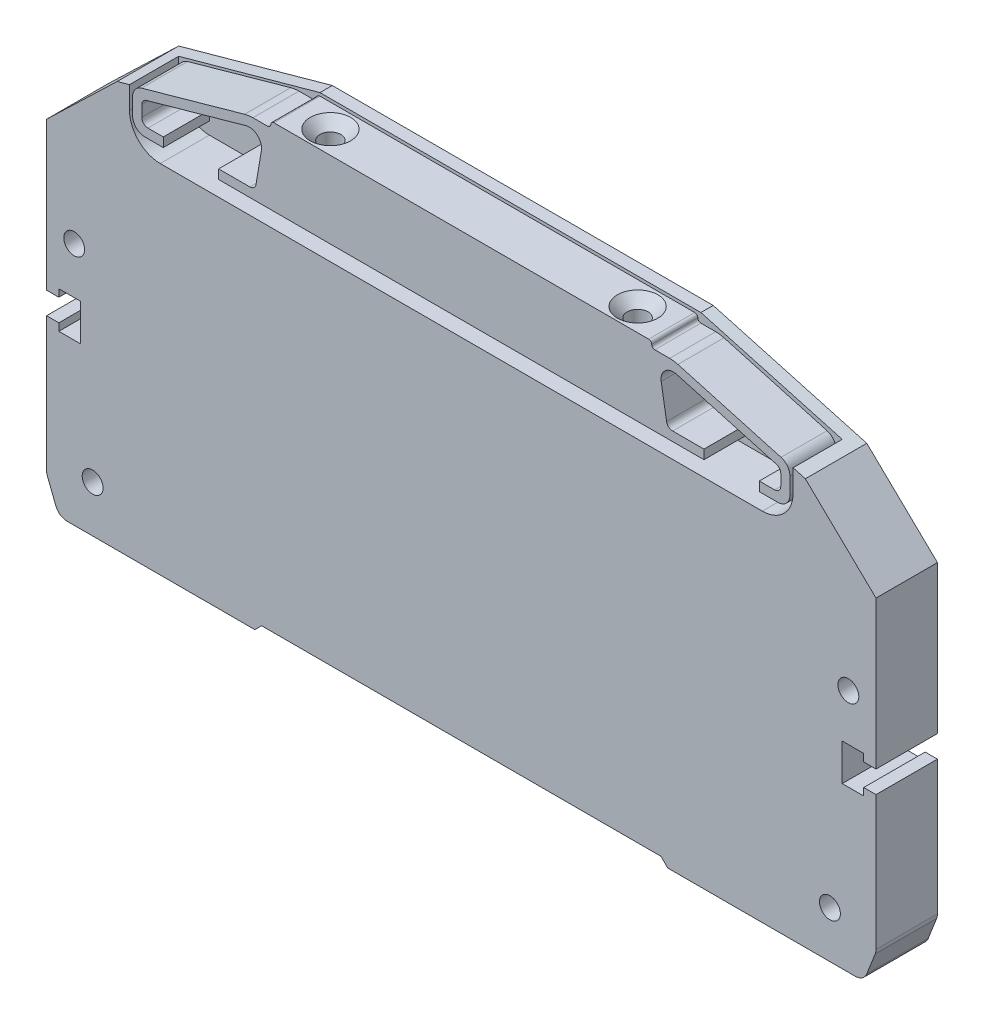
ISO-10303-21;
HEADER;
FILE_DESCRIPTION(('STEP AP214'),'2;1');
FILE_NAME('part.step','',(''),(''),'','','');
FILE_SCHEMA(('AUTOMOTIVE_DESIGN { 1 0 10303 214 1 1 1 1 }'));
ENDSEC;
DATA;
#1=APPLICATION_CONTEXT('core data for automotive mechanical design processes');
#2=APPLICATION_PROTOCOL_DEFINITION('international standard','automotive_design',2000,#1);
#3=PRODUCT_CONTEXT('',#1,'mechanical');
#4=PRODUCT('Part','Part','',(#3));
#5=PRODUCT_RELATED_PRODUCT_CATEGORY('part','',(#4));
#6=PRODUCT_DEFINITION_FORMATION('','',#4);
#7=PRODUCT_DEFINITION_CONTEXT('part definition',#1,'design');
#8=PRODUCT_DEFINITION('design','',#6,#7);
#9=PRODUCT_DEFINITION_SHAPE('','',#8);
#10=(LENGTH_UNIT() NAMED_UNIT(*) SI_UNIT(.MILLI.,.METRE.));
#11=(NAMED_UNIT(*) PLANE_ANGLE_UNIT() SI_UNIT($,.RADIAN.));
#12=(NAMED_UNIT(*) SI_UNIT($,.STERADIAN.) SOLID_ANGLE_UNIT());
#13=UNCERTAINTY_MEASURE_WITH_UNIT(LENGTH_MEASURE(1.E-05),#10,'distance_accuracy_value','');
#14=(GEOMETRIC_REPRESENTATION_CONTEXT(3) GLOBAL_UNCERTAINTY_ASSIGNED_CONTEXT((#13)) GLOBAL_UNIT_ASSIGNED_CONTEXT((#10,
#11,#12)) REPRESENTATION_CONTEXT('',''));
#15=CARTESIAN_POINT('',(0.,0.,0.));
#16=DIRECTION('',(0.,0.,1.));
#17=DIRECTION('',(1.,0.,0.));
#18=AXIS2_PLACEMENT_3D('',#15,#16,#17);
#19=CARTESIAN_POINT('',(-39.5000000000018,60.9000000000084,-105.727665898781));
#20=DIRECTION('',(-1.,0.,0.));
#21=DIRECTION('',(0.,0.,1.));
#22=AXIS2_PLACEMENT_3D('',#19,#20,#21);
#23=PLANE('',#22);
#24=DIRECTION('',(0.,1.,0.));
#25=VECTOR('',#24,1.);
#26=CARTESIAN_POINT('',(-39.5000000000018,60.9000000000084,2.5));
#27=LINE('',#26,#25);
#28=CARTESIAN_POINT('',(-39.5000000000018,59.4000000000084,2.5));
#29=VERTEX_POINT('',#28);
#30=CARTESIAN_POINT('',(-39.5000000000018,60.9000000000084,2.5));
#31=VERTEX_POINT('',#30);
#32=EDGE_CURVE('E54',#29,#31,#27,.T.);
#33=ORIENTED_EDGE('',*,*,#32,.F.);
#34=DIRECTION('',(0.,0.,1.));
#35=VECTOR('',#34,1.);
#36=CARTESIAN_POINT('',(-39.5000000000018,59.4000000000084,-105.727665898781));
#37=LINE('',#36,#35);
#38=CARTESIAN_POINT('',(-39.5000000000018,59.4000000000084,10.));
#39=VERTEX_POINT('',#38);
#40=EDGE_CURVE('E313',#29,#39,#37,.T.);
#41=ORIENTED_EDGE('',*,*,#40,.T.);
#42=DIRECTION('',(0.,-1.,0.));
#43=VECTOR('',#42,1.);
#44=CARTESIAN_POINT('',(-39.5000000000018,60.9000000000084,10.));
#45=LINE('',#44,#43);
#46=CARTESIAN_POINT('',(-39.5000000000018,60.9000000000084,10.));
#47=VERTEX_POINT('',#46);
#48=EDGE_CURVE('E317',#47,#39,#45,.T.);
#49=ORIENTED_EDGE('',*,*,#48,.F.);
#50=DIRECTION('',(0.,0.,1.));
#51=VECTOR('',#50,1.);
#52=CARTESIAN_POINT('',(-39.5000000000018,60.9000000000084,-105.727665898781));
#53=LINE('',#52,#51);
#54=EDGE_CURVE('E458',#31,#47,#53,.T.);
#55=ORIENTED_EDGE('',*,*,#54,.F.);
#56=EDGE_LOOP('',(#33,#41,#49,#55));
#57=FACE_BOUND('',#56,.T.);
#58=ADVANCED_FACE('F47',(#57),#23,.T.);
#59=CARTESIAN_POINT('',(-34.4000000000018,60.9000000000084,-105.727665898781));
#60=DIRECTION('',(0.,1.,0.));
#61=DIRECTION('',(0.,0.,1.));
#62=AXIS2_PLACEMENT_3D('',#59,#60,#61);
#63=PLANE('',#62);
#64=DIRECTION('',(1.,0.,0.));
#65=VECTOR('',#64,1.);
#66=CARTESIAN_POINT('',(-34.4000000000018,60.9000000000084,2.5));
#67=LINE('',#66,#65);
#68=CARTESIAN_POINT('',(-34.4000000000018,60.9000000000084,2.5));
#69=VERTEX_POINT('',#68);
#70=EDGE_CURVE('E754',#31,#69,#67,.T.);
#71=ORIENTED_EDGE('',*,*,#70,.F.);
#72=ORIENTED_EDGE('',*,*,#54,.T.);
#73=DIRECTION('',(-1.,0.,0.));
#74=VECTOR('',#73,1.);
#75=CARTESIAN_POINT('',(-34.4000000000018,60.9000000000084,10.));
#76=LINE('',#75,#74);
#77=CARTESIAN_POINT('',(-34.4000000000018,60.9000000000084,10.));
#78=VERTEX_POINT('',#77);
#79=EDGE_CURVE('E322',#78,#47,#76,.T.);
#80=ORIENTED_EDGE('',*,*,#79,.F.);
#81=DIRECTION('',(0.,0.,1.));
#82=VECTOR('',#81,1.);
#83=CARTESIAN_POINT('',(-34.4000000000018,60.9000000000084,-105.727665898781));
#84=LINE('',#83,#82);
#85=EDGE_CURVE('E461',#69,#78,#84,.T.);
#86=ORIENTED_EDGE('',*,*,#85,.F.);
#87=EDGE_LOOP('',(#71,#72,#80,#86));
#88=FACE_BOUND('',#87,.T.);
#89=ADVANCED_FACE('F753',(#88),#63,.T.);
#90=CARTESIAN_POINT('',(-34.4000000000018,61.9000000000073,-105.727665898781));
#91=DIRECTION('',(0.,0.,1.));
#92=DIRECTION('',(1.,0.,0.));
#93=AXIS2_PLACEMENT_3D('',#90,#91,#92);
#94=CYLINDRICAL_SURFACE('',#93,0.999999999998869);
#95=CARTESIAN_POINT('',(-34.4000000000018,61.9000000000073,2.5));
#96=DIRECTION('',(0.,0.,1.));
#97=DIRECTION('',(1.,0.,0.));
#98=AXIS2_PLACEMENT_3D('',#95,#96,#97);
#99=CIRCLE('',#98,0.999999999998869);
#100=CARTESIAN_POINT('',(-33.4138161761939,61.7343453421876,2.5));
#101=VERTEX_POINT('',#100);
#102=EDGE_CURVE('E756',#69,#101,#99,.T.);
#103=ORIENTED_EDGE('',*,*,#102,.F.);
#104=ORIENTED_EDGE('',*,*,#85,.T.);
#105=CARTESIAN_POINT('',(-34.4000000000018,61.9000000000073,10.));
#106=DIRECTION('',(0.,0.,-1.));
#107=DIRECTION('',(1.,0.,0.));
#108=AXIS2_PLACEMENT_3D('',#105,#106,#107);
#109=CIRCLE('',#108,0.999999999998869);
#110=CARTESIAN_POINT('',(-33.4138161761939,61.7343453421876,10.));
#111=VERTEX_POINT('',#110);
#112=EDGE_CURVE('E455',#111,#78,#109,.T.);
#113=ORIENTED_EDGE('',*,*,#112,.F.);
#114=DIRECTION('',(0.,0.,1.));
#115=VECTOR('',#114,1.);
#116=CARTESIAN_POINT('',(-33.4138161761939,61.7343453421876,-105.727665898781));
#117=LINE('',#116,#115);
#118=EDGE_CURVE('E463',#101,#111,#117,.T.);
#119=ORIENTED_EDGE('',*,*,#118,.F.);
#120=EDGE_LOOP('',(#103,#104,#113,#119));
#121=FACE_BOUND('',#120,.T.);
#122=ADVANCED_FACE('F851',(#121),#94,.F.);
#123=CARTESIAN_POINT('',(-32.5361463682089,66.9593343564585,-105.727665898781));
#124=DIRECTION('',(-0.986183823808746,0.165654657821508,0.));
#125=DIRECTION('',(-0.165654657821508,-0.986183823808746,0.));
#126=AXIS2_PLACEMENT_3D('',#123,#124,#125);
#127=PLANE('',#126);
#128=DIRECTION('',(0.165654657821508,0.986183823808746,0.));
#129=VECTOR('',#128,1.);
#130=CARTESIAN_POINT('',(-32.5361463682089,66.9593343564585,2.5));
#131=LINE('',#130,#129);
#132=CARTESIAN_POINT('',(-32.5361463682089,66.9593343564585,2.5));
#133=VERTEX_POINT('',#132);
#134=EDGE_CURVE('E757',#101,#133,#131,.T.);
#135=ORIENTED_EDGE('',*,*,#134,.F.);
#136=ORIENTED_EDGE('',*,*,#118,.T.);
#137=DIRECTION('',(-0.165654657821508,-0.986183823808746,0.));
#138=VECTOR('',#137,1.);
#139=CARTESIAN_POINT('',(-32.5361463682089,66.9593343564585,10.));
#140=LINE('',#139,#138);
#141=CARTESIAN_POINT('',(-32.5361463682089,66.9593343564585,10.));
#142=VERTEX_POINT('',#141);
#143=EDGE_CURVE('E452',#142,#111,#140,.T.);
#144=ORIENTED_EDGE('',*,*,#143,.F.);
#145=DIRECTION('',(0.,0.,1.));
#146=VECTOR('',#145,1.);
#147=CARTESIAN_POINT('',(-32.5361463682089,66.9593343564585,-105.727665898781));
#148=LINE('',#147,#146);
#149=EDGE_CURVE('E465',#133,#142,#148,.T.);
#150=ORIENTED_EDGE('',*,*,#149,.F.);
#151=EDGE_LOOP('',(#135,#136,#144,#150));
#152=FACE_BOUND('',#151,.T.);
#153=ADVANCED_FACE('F746',(#152),#127,.T.);
#154=CARTESIAN_POINT('',(-34.508514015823,67.2906436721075,-105.727665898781));
#155=DIRECTION('',(0.,0.,1.));
#156=DIRECTION('',(1.,0.,0.));
#157=AXIS2_PLACEMENT_3D('',#154,#155,#156);
#158=CYLINDRICAL_SURFACE('',#157,1.99999999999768);
#159=CARTESIAN_POINT('',(-34.508514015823,67.2906436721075,2.5));
#160=DIRECTION('',(0.,0.,1.));
#161=DIRECTION('',(1.,0.,0.));
#162=AXIS2_PLACEMENT_3D('',#159,#160,#161);
#163=CIRCLE('',#162,1.99999999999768);
#164=CARTESIAN_POINT('',(-35.0485296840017,69.2163599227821,2.5));
#165=VERTEX_POINT('',#164);
#166=EDGE_CURVE('E743',#133,#165,#163,.T.);
#167=ORIENTED_EDGE('',*,*,#166,.F.);
#168=ORIENTED_EDGE('',*,*,#149,.T.);
#169=CARTESIAN_POINT('',(-34.508514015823,67.2906436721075,10.));
#170=DIRECTION('',(0.,0.,-1.));
#171=DIRECTION('',(1.,0.,0.));
#172=AXIS2_PLACEMENT_3D('',#169,#170,#171);
#173=CIRCLE('',#172,1.99999999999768);
#174=CARTESIAN_POINT('',(-35.0485296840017,69.2163599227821,10.));
#175=VERTEX_POINT('',#174);
#176=EDGE_CURVE('E449',#175,#142,#173,.T.);
#177=ORIENTED_EDGE('',*,*,#176,.F.);
#178=DIRECTION('',(0.,0.,1.));
#179=VECTOR('',#178,1.);
#180=CARTESIAN_POINT('',(-35.0485296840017,69.2163599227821,-105.727665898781));
#181=LINE('',#180,#179);
#182=EDGE_CURVE('E467',#165,#175,#181,.T.);
#183=ORIENTED_EDGE('',*,*,#182,.F.);
#184=EDGE_LOOP('',(#167,#168,#177,#183));
#185=FACE_BOUND('',#184,.T.);
#186=ADVANCED_FACE('F740',(#185),#158,.F.);
#187=CARTESIAN_POINT('',(-51.2700078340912,64.6674798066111,-105.727665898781));
#188=DIRECTION('',(0.270007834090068,-0.962858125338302,0.));
#189=DIRECTION('',(0.962858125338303,0.270007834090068,0.));
#190=AXIS2_PLACEMENT_3D('',#187,#188,#189);
#191=PLANE('',#190);
#192=DIRECTION('',(-0.962858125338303,-0.270007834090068,0.));
#193=VECTOR('',#192,1.);
#194=CARTESIAN_POINT('',(-51.2700078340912,64.6674798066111,2.5));
#195=LINE('',#194,#193);
#196=CARTESIAN_POINT('',(-51.2700078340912,64.6674798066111,2.5));
#197=VERTEX_POINT('',#196);
#198=EDGE_CURVE('E737',#165,#197,#195,.T.);
#199=ORIENTED_EDGE('',*,*,#198,.F.);
#200=ORIENTED_EDGE('',*,*,#182,.T.);
#201=DIRECTION('',(0.962858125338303,0.270007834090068,0.));
#202=VECTOR('',#201,1.);
#203=CARTESIAN_POINT('',(-51.2700078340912,64.6674798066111,10.));
#204=LINE('',#203,#202);
#205=CARTESIAN_POINT('',(-51.2700078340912,64.6674798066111,10.));
#206=VERTEX_POINT('',#205);
#207=EDGE_CURVE('E446',#206,#175,#204,.T.);
#208=ORIENTED_EDGE('',*,*,#207,.F.);
#209=DIRECTION('',(0.,0.,1.));
#210=VECTOR('',#209,1.);
#211=CARTESIAN_POINT('',(-51.2700078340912,64.6674798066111,-105.727665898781));
#212=LINE('',#211,#210);
#213=EDGE_CURVE('E469',#197,#206,#212,.T.);
#214=ORIENTED_EDGE('',*,*,#213,.F.);
#215=EDGE_LOOP('',(#199,#200,#208,#214));
#216=FACE_BOUND('',#215,.T.);
#217=ADVANCED_FACE('F735',(#216),#191,.T.);
#218=CARTESIAN_POINT('',(-51.000000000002,63.704621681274,-105.727665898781));
#219=DIRECTION('',(0.,0.,1.));
#220=DIRECTION('',(1.,0.,0.));
#221=AXIS2_PLACEMENT_3D('',#218,#219,#220);
#222=CYLINDRICAL_SURFACE('',#221,0.999999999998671);
#223=CARTESIAN_POINT('',(-51.000000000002,63.704621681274,2.5));
#224=DIRECTION('',(0.,0.,1.));
#225=DIRECTION('',(1.,0.,0.));
#226=AXIS2_PLACEMENT_3D('',#223,#224,#225);
#227=CIRCLE('',#226,0.999999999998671);
#228=CARTESIAN_POINT('',(-52.0000000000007,63.704621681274,2.5));
#229=VERTEX_POINT('',#228);
#230=EDGE_CURVE('E763',#197,#229,#227,.T.);
#231=ORIENTED_EDGE('',*,*,#230,.F.);
#232=ORIENTED_EDGE('',*,*,#213,.T.);
#233=CARTESIAN_POINT('',(-51.000000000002,63.704621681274,10.));
#234=DIRECTION('',(0.,0.,-1.));
#235=DIRECTION('',(1.,0.,0.));
#236=AXIS2_PLACEMENT_3D('',#233,#234,#235);
#237=CIRCLE('',#236,0.999999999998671);
#238=CARTESIAN_POINT('',(-52.0000000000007,63.704621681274,10.));
#239=VERTEX_POINT('',#238);
#240=EDGE_CURVE('E443',#239,#206,#237,.T.);
#241=ORIENTED_EDGE('',*,*,#240,.F.);
#242=DIRECTION('',(0.,0.,1.));
#243=VECTOR('',#242,1.);
#244=CARTESIAN_POINT('',(-52.0000000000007,63.704621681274,-105.727665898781));
#245=LINE('',#244,#243);
#246=EDGE_CURVE('E471',#229,#239,#245,.T.);
#247=ORIENTED_EDGE('',*,*,#246,.F.);
#248=EDGE_LOOP('',(#231,#232,#241,#247));
#249=FACE_BOUND('',#248,.T.);
#250=ADVANCED_FACE('F729',(#249),#222,.F.);
#251=CARTESIAN_POINT('',(-52.0000000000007,61.900000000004,-105.727665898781));
#252=DIRECTION('',(1.,0.,0.));
#253=DIRECTION('',(0.,0.,-1.));
#254=AXIS2_PLACEMENT_3D('',#251,#252,#253);
#255=PLANE('',#254);
#256=DIRECTION('',(0.,-1.,0.));
#257=VECTOR('',#256,1.);
#258=CARTESIAN_POINT('',(-52.0000000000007,61.900000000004,2.5));
#259=LINE('',#258,#257);
#260=CARTESIAN_POINT('',(-52.0000000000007,61.900000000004,2.5));
#261=VERTEX_POINT('',#260);
#262=EDGE_CURVE('E726',#229,#261,#259,.T.);
#263=ORIENTED_EDGE('',*,*,#262,.F.);
#264=ORIENTED_EDGE('',*,*,#246,.T.);
#265=DIRECTION('',(0.,1.,0.));
#266=VECTOR('',#265,1.);
#267=CARTESIAN_POINT('',(-52.0000000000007,61.900000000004,10.));
#268=LINE('',#267,#266);
#269=CARTESIAN_POINT('',(-52.0000000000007,61.900000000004,10.));
#270=VERTEX_POINT('',#269);
#271=EDGE_CURVE('E440',#270,#239,#268,.T.);
#272=ORIENTED_EDGE('',*,*,#271,.F.);
#273=DIRECTION('',(0.,0.,1.));
#274=VECTOR('',#273,1.);
#275=CARTESIAN_POINT('',(-52.0000000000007,61.900000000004,-105.727665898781));
#276=LINE('',#275,#274);
#277=EDGE_CURVE('E473',#261,#270,#276,.T.);
#278=ORIENTED_EDGE('',*,*,#277,.F.);
#279=EDGE_LOOP('',(#263,#264,#272,#278));
#280=FACE_BOUND('',#279,.T.);
#281=ADVANCED_FACE('F723',(#280),#255,.T.);
#282=CARTESIAN_POINT('',(-51.0000000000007,61.900000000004,-105.727665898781));
#283=DIRECTION('',(0.,0.,1.));
#284=DIRECTION('',(1.,0.,0.));
#285=AXIS2_PLACEMENT_3D('',#282,#283,#284);
#286=CYLINDRICAL_SURFACE('',#285,1.);
#287=CARTESIAN_POINT('',(-51.0000000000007,61.900000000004,2.5));
#288=DIRECTION('',(0.,0.,1.));
#289=DIRECTION('',(1.,0.,0.));
#290=AXIS2_PLACEMENT_3D('',#287,#288,#289);
#291=CIRCLE('',#290,1.);
#292=CARTESIAN_POINT('',(-51.0000000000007,60.900000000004,2.5));
#293=VERTEX_POINT('',#292);
#294=EDGE_CURVE('E720',#261,#293,#291,.T.);
#295=ORIENTED_EDGE('',*,*,#294,.F.);
#296=ORIENTED_EDGE('',*,*,#277,.T.);
#297=CARTESIAN_POINT('',(-51.0000000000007,61.900000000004,10.));
#298=DIRECTION('',(0.,0.,-1.));
#299=DIRECTION('',(1.,0.,0.));
#300=AXIS2_PLACEMENT_3D('',#297,#298,#299);
#301=CIRCLE('',#300,1.);
#302=CARTESIAN_POINT('',(-51.0000000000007,60.900000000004,10.));
#303=VERTEX_POINT('',#302);
#304=EDGE_CURVE('E437',#303,#270,#301,.T.);
#305=ORIENTED_EDGE('',*,*,#304,.F.);
#306=DIRECTION('',(0.,0.,1.));
#307=VECTOR('',#306,1.);
#308=CARTESIAN_POINT('',(-51.0000000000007,60.900000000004,-105.727665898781));
#309=LINE('',#308,#307);
#310=EDGE_CURVE('E475',#293,#303,#309,.T.);
#311=ORIENTED_EDGE('',*,*,#310,.F.);
#312=EDGE_LOOP('',(#295,#296,#305,#311));
#313=FACE_BOUND('',#312,.T.);
#314=ADVANCED_FACE('F718',(#313),#286,.F.);
#315=CARTESIAN_POINT('',(-48.5000000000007,60.900000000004,-105.727665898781));
#316=DIRECTION('',(0.,1.,0.));
#317=DIRECTION('',(0.,0.,1.));
#318=AXIS2_PLACEMENT_3D('',#315,#316,#317);
#319=PLANE('',#318);
#320=DIRECTION('',(1.,0.,0.));
#321=VECTOR('',#320,1.);
#322=CARTESIAN_POINT('',(-48.5000000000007,60.900000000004,2.5));
#323=LINE('',#322,#321);
#324=CARTESIAN_POINT('',(-48.5000000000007,60.900000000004,2.5));
#325=VERTEX_POINT('',#324);
#326=EDGE_CURVE('E767',#293,#325,#323,.T.);
#327=ORIENTED_EDGE('',*,*,#326,.F.);
#328=ORIENTED_EDGE('',*,*,#310,.T.);
#329=DIRECTION('',(-1.,0.,0.));
#330=VECTOR('',#329,1.);
#331=CARTESIAN_POINT('',(-48.5000000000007,60.900000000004,10.));
#332=LINE('',#331,#330);
#333=CARTESIAN_POINT('',(-48.5000000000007,60.900000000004,10.));
#334=VERTEX_POINT('',#333);
#335=EDGE_CURVE('E434',#334,#303,#332,.T.);
#336=ORIENTED_EDGE('',*,*,#335,.F.);
#337=DIRECTION('',(0.,0.,1.));
#338=VECTOR('',#337,1.);
#339=CARTESIAN_POINT('',(-48.5000000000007,60.900000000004,-105.727665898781));
#340=LINE('',#339,#338);
#341=EDGE_CURVE('E477',#325,#334,#340,.T.);
#342=ORIENTED_EDGE('',*,*,#341,.F.);
#343=EDGE_LOOP('',(#327,#328,#336,#342));
#344=FACE_BOUND('',#343,.T.);
#345=ADVANCED_FACE('F712',(#344),#319,.T.);
#346=CARTESIAN_POINT('',(-48.5000000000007,59.400000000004,-105.727665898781));
#347=DIRECTION('',(1.,0.,0.));
#348=DIRECTION('',(0.,0.,-1.));
#349=AXIS2_PLACEMENT_3D('',#346,#347,#348);
#350=PLANE('',#349);
#351=DIRECTION('',(0.,-1.,0.));
#352=VECTOR('',#351,1.);
#353=CARTESIAN_POINT('',(-48.5000000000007,59.400000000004,2.5));
#354=LINE('',#353,#352);
#355=CARTESIAN_POINT('',(-48.5000000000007,59.400000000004,2.5));
#356=VERTEX_POINT('',#355);
#357=EDGE_CURVE('E709',#325,#356,#354,.T.);
#358=ORIENTED_EDGE('',*,*,#357,.F.);
#359=ORIENTED_EDGE('',*,*,#341,.T.);
#360=DIRECTION('',(0.,1.,0.));
#361=VECTOR('',#360,1.);
#362=CARTESIAN_POINT('',(-48.5000000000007,59.400000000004,10.));
#363=LINE('',#362,#361);
#364=CARTESIAN_POINT('',(-48.5000000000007,59.400000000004,10.));
#365=VERTEX_POINT('',#364);
#366=EDGE_CURVE('E431',#365,#334,#363,.T.);
#367=ORIENTED_EDGE('',*,*,#366,.F.);
#368=DIRECTION('',(0.,0.,1.));
#369=VECTOR('',#368,1.);
#370=CARTESIAN_POINT('',(-48.5000000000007,59.400000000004,-105.727665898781));
#371=LINE('',#370,#369);
#372=EDGE_CURVE('E479',#356,#365,#371,.T.);
#373=ORIENTED_EDGE('',*,*,#372,.F.);
#374=EDGE_LOOP('',(#358,#359,#367,#373));
#375=FACE_BOUND('',#374,.T.);
#376=ADVANCED_FACE('F706',(#375),#350,.T.);
#377=CARTESIAN_POINT('',(-51.5000000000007,59.400000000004,-105.727665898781));
#378=DIRECTION('',(0.,-1.,0.));
#379=DIRECTION('',(0.,0.,-1.));
#380=AXIS2_PLACEMENT_3D('',#377,#378,#379);
#381=PLANE('',#380);
#382=DIRECTION('',(-1.,0.,0.));
#383=VECTOR('',#382,1.);
#384=CARTESIAN_POINT('',(-51.5000000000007,59.400000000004,2.5));
#385=LINE('',#384,#383);
#386=CARTESIAN_POINT('',(-51.5000000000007,59.400000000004,2.5));
#387=VERTEX_POINT('',#386);
#388=EDGE_CURVE('E703',#356,#387,#385,.T.);
#389=ORIENTED_EDGE('',*,*,#388,.F.);
#390=ORIENTED_EDGE('',*,*,#372,.T.);
#391=DIRECTION('',(1.,0.,0.));
#392=VECTOR('',#391,1.);
#393=CARTESIAN_POINT('',(-51.5000000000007,59.400000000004,10.));
#394=LINE('',#393,#392);
#395=CARTESIAN_POINT('',(-51.5000000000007,59.400000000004,10.));
#396=VERTEX_POINT('',#395);
#397=EDGE_CURVE('E428',#396,#365,#394,.T.);
#398=ORIENTED_EDGE('',*,*,#397,.F.);
#399=DIRECTION('',(0.,0.,1.));
#400=VECTOR('',#399,1.);
#401=CARTESIAN_POINT('',(-51.5000000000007,59.400000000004,-105.727665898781));
#402=LINE('',#401,#400);
#403=EDGE_CURVE('E481',#387,#396,#402,.T.);
#404=ORIENTED_EDGE('',*,*,#403,.F.);
#405=EDGE_LOOP('',(#389,#390,#398,#404));
#406=FACE_BOUND('',#405,.T.);
#407=ADVANCED_FACE('F701',(#406),#381,.T.);
#408=CARTESIAN_POINT('',(-51.5000000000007,61.400000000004,-105.727665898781));
#409=DIRECTION('',(0.,0.,1.));
#410=DIRECTION('',(1.,0.,0.));
#411=AXIS2_PLACEMENT_3D('',#408,#409,#410);
#412=CYLINDRICAL_SURFACE('',#411,2.);
#413=CARTESIAN_POINT('',(-51.5000000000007,61.400000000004,2.5));
#414=DIRECTION('',(0.,0.,1.));
#415=DIRECTION('',(1.,0.,0.));
#416=AXIS2_PLACEMENT_3D('',#413,#414,#415);
#417=CIRCLE('',#416,2.);
#418=CARTESIAN_POINT('',(-53.5000000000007,61.400000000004,2.5));
#419=VERTEX_POINT('',#418);
#420=EDGE_CURVE('E771',#387,#419,#417,.F.);
#421=ORIENTED_EDGE('',*,*,#420,.F.);
#422=ORIENTED_EDGE('',*,*,#403,.T.);
#423=CARTESIAN_POINT('',(-51.5000000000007,61.400000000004,10.));
#424=DIRECTION('',(0.,0.,1.));
#425=DIRECTION('',(1.,0.,0.));
#426=AXIS2_PLACEMENT_3D('',#423,#424,#425);
#427=CIRCLE('',#426,2.);
#428=CARTESIAN_POINT('',(-53.5000000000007,61.400000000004,10.));
#429=VERTEX_POINT('',#428);
#430=EDGE_CURVE('E425',#429,#396,#427,.T.);
#431=ORIENTED_EDGE('',*,*,#430,.F.);
#432=DIRECTION('',(0.,0.,1.));
#433=VECTOR('',#432,1.);
#434=CARTESIAN_POINT('',(-53.5000000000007,61.400000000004,-105.727665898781));
#435=LINE('',#434,#433);
#436=EDGE_CURVE('E483',#419,#429,#435,.T.);
#437=ORIENTED_EDGE('',*,*,#436,.F.);
#438=EDGE_LOOP('',(#421,#422,#431,#437));
#439=FACE_BOUND('',#438,.T.);
#440=ADVANCED_FACE('F695',(#439),#412,.T.);
#441=CARTESIAN_POINT('',(-53.5000000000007,64.0836973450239,-105.727665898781));
#442=DIRECTION('',(-1.,0.,0.));
#443=DIRECTION('',(0.,-1.,0.));
#444=AXIS2_PLACEMENT_3D('',#441,#442,#443);
#445=PLANE('',#444);
#446=DIRECTION('',(0.,1.,0.));
#447=VECTOR('',#446,1.);
#448=CARTESIAN_POINT('',(-53.5000000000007,64.0836973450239,2.5));
#449=LINE('',#448,#447);
#450=CARTESIAN_POINT('',(-53.5000000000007,64.0836973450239,2.5));
#451=VERTEX_POINT('',#450);
#452=EDGE_CURVE('E692',#419,#451,#449,.T.);
#453=ORIENTED_EDGE('',*,*,#452,.F.);
#454=ORIENTED_EDGE('',*,*,#436,.T.);
#455=DIRECTION('',(0.,-1.,0.));
#456=VECTOR('',#455,1.);
#457=CARTESIAN_POINT('',(-53.5000000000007,64.0836973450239,10.));
#458=LINE('',#457,#456);
#459=CARTESIAN_POINT('',(-53.5000000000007,64.0836973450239,10.));
#460=VERTEX_POINT('',#459);
#461=EDGE_CURVE('E422',#460,#429,#458,.T.);
#462=ORIENTED_EDGE('',*,*,#461,.F.);
#463=DIRECTION('',(0.,0.,1.));
#464=VECTOR('',#463,1.);
#465=CARTESIAN_POINT('',(-53.5000000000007,64.0836973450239,-105.727665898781));
#466=LINE('',#465,#464);
#467=EDGE_CURVE('E485',#451,#460,#466,.T.);
#468=ORIENTED_EDGE('',*,*,#467,.F.);
#469=EDGE_LOOP('',(#453,#454,#462,#468));
#470=FACE_BOUND('',#469,.T.);
#471=ADVANCED_FACE('F689',(#470),#445,.T.);
#472=CARTESIAN_POINT('',(-51.5000000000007,64.0836973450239,-105.727665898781));
#473=DIRECTION('',(0.,0.,1.));
#474=DIRECTION('',(1.,0.,0.));
#475=AXIS2_PLACEMENT_3D('',#472,#473,#474);
#476=CYLINDRICAL_SURFACE('',#475,2.);
#477=CARTESIAN_POINT('',(-51.5000000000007,64.0836973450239,2.5));
#478=DIRECTION('',(0.,0.,1.));
#479=DIRECTION('',(1.,0.,0.));
#480=AXIS2_PLACEMENT_3D('',#477,#478,#479);
#481=CIRCLE('',#480,2.);
#482=CARTESIAN_POINT('',(-52.0400156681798,66.0094135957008,2.5));
#483=VERTEX_POINT('',#482);
#484=EDGE_CURVE('E686',#451,#483,#481,.F.);
#485=ORIENTED_EDGE('',*,*,#484,.F.);
#486=ORIENTED_EDGE('',*,*,#467,.T.);
#487=CARTESIAN_POINT('',(-51.5000000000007,64.0836973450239,10.));
#488=DIRECTION('',(0.,0.,1.));
#489=DIRECTION('',(1.,0.,0.));
#490=AXIS2_PLACEMENT_3D('',#487,#488,#489);
#491=CIRCLE('',#490,2.);
#492=CARTESIAN_POINT('',(-52.0400156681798,66.0094135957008,10.));
#493=VERTEX_POINT('',#492);
#494=EDGE_CURVE('E419',#493,#460,#491,.T.);
#495=ORIENTED_EDGE('',*,*,#494,.F.);
#496=DIRECTION('',(0.,0.,1.));
#497=VECTOR('',#496,1.);
#498=CARTESIAN_POINT('',(-52.0400156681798,66.0094135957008,-105.727665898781));
#499=LINE('',#498,#497);
#500=EDGE_CURVE('E487',#483,#493,#499,.T.);
#501=ORIENTED_EDGE('',*,*,#500,.F.);
#502=EDGE_LOOP('',(#485,#486,#495,#501));
#503=FACE_BOUND('',#502,.T.);
#504=ADVANCED_FACE('F684',(#503),#476,.T.);
#505=CARTESIAN_POINT('',(-35.2622466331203,70.7142906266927,-105.727665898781));
#506=DIRECTION('',(-0.270007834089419,0.962858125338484,0.));
#507=DIRECTION('',(-0.962858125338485,-0.270007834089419,0.));
#508=AXIS2_PLACEMENT_3D('',#505,#506,#507);
#509=PLANE('',#508);
#510=DIRECTION('',(0.962858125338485,0.270007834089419,0.));
#511=VECTOR('',#510,1.);
#512=CARTESIAN_POINT('',(-35.2622466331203,70.7142906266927,2.5));
#513=LINE('',#512,#511);
#514=CARTESIAN_POINT('',(-35.2622466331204,70.7142906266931,2.5));
#515=VERTEX_POINT('',#514);
#516=EDGE_CURVE('E775',#483,#515,#513,.T.);
#517=ORIENTED_EDGE('',*,*,#516,.F.);
#518=ORIENTED_EDGE('',*,*,#500,.T.);
#519=DIRECTION('',(-0.962858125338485,-0.270007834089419,0.));
#520=VECTOR('',#519,1.);
#521=CARTESIAN_POINT('',(-35.2622466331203,70.7142906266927,10.));
#522=LINE('',#521,#520);
#523=CARTESIAN_POINT('',(-35.2622466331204,70.7142906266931,10.));
#524=VERTEX_POINT('',#523);
#525=EDGE_CURVE('E416',#524,#493,#522,.T.);
#526=ORIENTED_EDGE('',*,*,#525,.F.);
#527=DIRECTION('',(0.,0.,1.));
#528=VECTOR('',#527,1.);
#529=CARTESIAN_POINT('',(-35.2622466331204,70.7142906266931,-105.727665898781));
#530=LINE('',#529,#528);
#531=EDGE_CURVE('E489',#515,#524,#530,.T.);
#532=ORIENTED_EDGE('',*,*,#531,.F.);
#533=EDGE_LOOP('',(#517,#518,#526,#532));
#534=FACE_BOUND('',#533,.T.);
#535=ADVANCED_FACE('F678',(#534),#509,.T.);
#536=CARTESIAN_POINT('',(-33.9122074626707,65.900000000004,-105.727665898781));
#537=DIRECTION('',(0.,0.,1.));
#538=DIRECTION('',(1.,0.,0.));
#539=AXIS2_PLACEMENT_3D('',#536,#537,#538);
#540=CYLINDRICAL_SURFACE('',#539,4.99999999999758);
#541=CARTESIAN_POINT('',(-33.9122074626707,65.900000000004,2.5));
#542=DIRECTION('',(0.,0.,1.));
#543=DIRECTION('',(1.,0.,0.));
#544=AXIS2_PLACEMENT_3D('',#541,#542,#543);
#545=CIRCLE('',#544,4.99999999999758);
#546=CARTESIAN_POINT('',(-33.9122074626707,70.900000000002,2.5));
#547=VERTEX_POINT('',#546);
#548=EDGE_CURVE('E675',#515,#547,#545,.F.);
#549=ORIENTED_EDGE('',*,*,#548,.F.);
#550=ORIENTED_EDGE('',*,*,#531,.T.);
#551=CARTESIAN_POINT('',(-33.9122074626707,65.900000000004,10.));
#552=DIRECTION('',(0.,0.,1.));
#553=DIRECTION('',(1.,0.,0.));
#554=AXIS2_PLACEMENT_3D('',#551,#552,#553);
#555=CIRCLE('',#554,4.99999999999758);
#556=CARTESIAN_POINT('',(-33.9122074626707,70.900000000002,10.));
#557=VERTEX_POINT('',#556);
#558=EDGE_CURVE('E413',#557,#524,#555,.T.);
#559=ORIENTED_EDGE('',*,*,#558,.F.);
#560=DIRECTION('',(0.,0.,1.));
#561=VECTOR('',#560,1.);
#562=CARTESIAN_POINT('',(-33.9122074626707,70.900000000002,-105.727665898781));
#563=LINE('',#562,#561);
#564=EDGE_CURVE('E491',#547,#557,#563,.T.);
#565=ORIENTED_EDGE('',*,*,#564,.F.);
#566=EDGE_LOOP('',(#549,#550,#559,#565));
#567=FACE_BOUND('',#566,.T.);
#568=ADVANCED_FACE('F672',(#567),#540,.T.);
#569=CARTESIAN_POINT('',(-31.5000000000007,70.9000000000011,-105.727665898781));
#570=DIRECTION('',(3.45188911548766E-13,1.,0.));
#571=DIRECTION('',(-1.,3.45188911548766E-13,0.));
#572=AXIS2_PLACEMENT_3D('',#569,#570,#571);
#573=PLANE('',#572);
#574=DIRECTION('',(1.,-3.45188911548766E-13,0.));
#575=VECTOR('',#574,1.);
#576=CARTESIAN_POINT('',(-31.5000000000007,70.9000000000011,2.5));
#577=LINE('',#576,#575);
#578=CARTESIAN_POINT('',(-31.5000000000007,70.9000000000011,2.5));
#579=VERTEX_POINT('',#578);
#580=EDGE_CURVE('E669',#547,#579,#577,.T.);
#581=ORIENTED_EDGE('',*,*,#580,.F.);
#582=ORIENTED_EDGE('',*,*,#564,.T.);
#583=DIRECTION('',(-1.,3.45188911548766E-13,0.));
#584=VECTOR('',#583,1.);
#585=CARTESIAN_POINT('',(-31.5000000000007,70.9000000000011,10.));
#586=LINE('',#585,#584);
#587=CARTESIAN_POINT('',(-31.5000000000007,70.9000000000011,10.));
#588=VERTEX_POINT('',#587);
#589=EDGE_CURVE('E410',#588,#557,#586,.T.);
#590=ORIENTED_EDGE('',*,*,#589,.F.);
#591=DIRECTION('',(0.,0.,1.));
#592=VECTOR('',#591,1.);
#593=CARTESIAN_POINT('',(-31.5000000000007,70.9000000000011,-105.727665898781));
#594=LINE('',#593,#592);
#595=EDGE_CURVE('E493',#579,#588,#594,.T.);
#596=ORIENTED_EDGE('',*,*,#595,.F.);
#597=EDGE_LOOP('',(#581,#582,#590,#596));
#598=FACE_BOUND('',#597,.T.);
#599=ADVANCED_FACE('F667',(#598),#573,.T.);
#600=CARTESIAN_POINT('',(-31.5000000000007,71.4000000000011,-105.727665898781));
#601=DIRECTION('',(0.,0.,1.));
#602=DIRECTION('',(1.,0.,0.));
#603=AXIS2_PLACEMENT_3D('',#600,#601,#602);
#604=CYLINDRICAL_SURFACE('',#603,0.5);
#605=CARTESIAN_POINT('',(-31.5000000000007,71.4000000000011,2.5));
#606=DIRECTION('',(0.,0.,1.));
#607=DIRECTION('',(1.,0.,0.));
#608=AXIS2_PLACEMENT_3D('',#605,#606,#607);
#609=CIRCLE('',#608,0.5);
#610=CARTESIAN_POINT('',(-31.0000000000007,71.4000000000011,2.5));
#611=VERTEX_POINT('',#610);
#612=EDGE_CURVE('E779',#579,#611,#609,.T.);
#613=ORIENTED_EDGE('',*,*,#612,.F.);
#614=ORIENTED_EDGE('',*,*,#595,.T.);
#615=CARTESIAN_POINT('',(-31.5000000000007,71.4000000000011,10.));
#616=DIRECTION('',(0.,0.,-1.));
#617=DIRECTION('',(1.,0.,0.));
#618=AXIS2_PLACEMENT_3D('',#615,#616,#617);
#619=CIRCLE('',#618,0.5);
#620=CARTESIAN_POINT('',(-31.0000000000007,71.4000000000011,10.));
#621=VERTEX_POINT('',#620);
#622=EDGE_CURVE('E407',#621,#588,#619,.T.);
#623=ORIENTED_EDGE('',*,*,#622,.F.);
#624=DIRECTION('',(0.,0.,1.));
#625=VECTOR('',#624,1.);
#626=CARTESIAN_POINT('',(-31.0000000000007,71.4000000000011,-105.727665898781));
#627=LINE('',#626,#625);
#628=EDGE_CURVE('E495',#611,#621,#627,.T.);
#629=ORIENTED_EDGE('',*,*,#628,.F.);
#630=EDGE_LOOP('',(#613,#614,#623,#629));
#631=FACE_BOUND('',#630,.T.);
#632=ADVANCED_FACE('F661',(#631),#604,.F.);
#633=CARTESIAN_POINT('',(-30.5000000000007,71.4000000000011,-105.727665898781));
#634=DIRECTION('',(0.,0.,1.));
#635=DIRECTION('',(1.,0.,0.));
#636=AXIS2_PLACEMENT_3D('',#633,#634,#635);
#637=CYLINDRICAL_SURFACE('',#636,0.5);
#638=CARTESIAN_POINT('',(-30.5000000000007,71.4000000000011,2.5));
#639=DIRECTION('',(0.,0.,1.));
#640=DIRECTION('',(1.,0.,0.));
#641=AXIS2_PLACEMENT_3D('',#638,#639,#640);
#642=CIRCLE('',#641,0.5);
#643=CARTESIAN_POINT('',(-30.5000000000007,71.9000000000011,2.5));
#644=VERTEX_POINT('',#643);
#645=EDGE_CURVE('E658',#611,#644,#642,.F.);
#646=ORIENTED_EDGE('',*,*,#645,.F.);
#647=ORIENTED_EDGE('',*,*,#628,.T.);
#648=CARTESIAN_POINT('',(-30.5000000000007,71.4000000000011,10.));
#649=DIRECTION('',(0.,0.,1.));
#650=DIRECTION('',(1.,0.,0.));
#651=AXIS2_PLACEMENT_3D('',#648,#649,#650);
#652=CIRCLE('',#651,0.5);
#653=CARTESIAN_POINT('',(-30.5000000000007,71.9000000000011,10.));
#654=VERTEX_POINT('',#653);
#655=EDGE_CURVE('E404',#654,#621,#652,.T.);
#656=ORIENTED_EDGE('',*,*,#655,.F.);
#657=DIRECTION('',(0.,0.,1.));
#658=VECTOR('',#657,1.);
#659=CARTESIAN_POINT('',(-30.5000000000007,71.9000000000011,-105.727665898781));
#660=LINE('',#659,#658);
#661=EDGE_CURVE('E497',#644,#654,#660,.T.);
#662=ORIENTED_EDGE('',*,*,#661,.F.);
#663=EDGE_LOOP('',(#646,#647,#656,#662));
#664=FACE_BOUND('',#663,.T.);
#665=ADVANCED_FACE('F655',(#664),#637,.T.);
#666=CARTESIAN_POINT('',(30.4999999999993,71.9000000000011,-105.727665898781));
#667=DIRECTION('',(0.,1.,0.));
#668=DIRECTION('',(0.,0.,1.));
#669=AXIS2_PLACEMENT_3D('',#666,#667,#668);
#670=PLANE('',#669);
#671=CARTESIAN_POINT('',(-25.,71.9000000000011,6.3));
#672=DIRECTION('',(0.,1.,0.));
#673=DIRECTION('',(0.,0.,1.));
#674=AXIS2_PLACEMENT_3D('',#671,#672,#673);
#675=CIRCLE('',#674,3.3);
#676=CARTESIAN_POINT('',(-25.,71.9000000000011,9.6));
#677=VERTEX_POINT('',#676);
#678=EDGE_CURVE('E820',#677,#677,#675,.T.);
#679=ORIENTED_EDGE('',*,*,#678,.F.);
#680=EDGE_LOOP('',(#679));
#681=FACE_BOUND('',#680,.T.);
#682=CARTESIAN_POINT('',(25.,71.9000000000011,6.3));
#683=DIRECTION('',(0.,1.,0.));
#684=DIRECTION('',(0.,0.,1.));
#685=AXIS2_PLACEMENT_3D('',#682,#683,#684);
#686=CIRCLE('',#685,3.3);
#687=CARTESIAN_POINT('',(25.,71.9000000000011,9.6));
#688=VERTEX_POINT('',#687);
#689=EDGE_CURVE('E811',#688,#688,#686,.T.);
#690=ORIENTED_EDGE('',*,*,#689,.F.);
#691=EDGE_LOOP('',(#690));
#692=FACE_BOUND('',#691,.T.);
#693=DIRECTION('',(1.,0.,0.));
#694=VECTOR('',#693,1.);
#695=CARTESIAN_POINT('',(30.4999999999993,71.9000000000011,2.5));
#696=LINE('',#695,#694);
#697=CARTESIAN_POINT('',(30.4999999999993,71.9000000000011,2.5));
#698=VERTEX_POINT('',#697);
#699=EDGE_CURVE('E652',#644,#698,#696,.T.);
#700=ORIENTED_EDGE('',*,*,#699,.F.);
#701=ORIENTED_EDGE('',*,*,#661,.T.);
#702=DIRECTION('',(-1.,0.,0.));
#703=VECTOR('',#702,1.);
#704=CARTESIAN_POINT('',(30.4999999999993,71.9000000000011,10.));
#705=LINE('',#704,#703);
#706=CARTESIAN_POINT('',(30.4999999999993,71.9000000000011,10.));
#707=VERTEX_POINT('',#706);
#708=EDGE_CURVE('E401',#707,#654,#705,.T.);
#709=ORIENTED_EDGE('',*,*,#708,.F.);
#710=DIRECTION('',(0.,0.,1.));
#711=VECTOR('',#710,1.);
#712=CARTESIAN_POINT('',(30.4999999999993,71.9000000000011,-105.727665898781));
#713=LINE('',#712,#711);
#714=EDGE_CURVE('E499',#698,#707,#713,.T.);
#715=ORIENTED_EDGE('',*,*,#714,.F.);
#716=EDGE_LOOP('',(#700,#701,#709,#715));
#717=FACE_BOUND('',#716,.T.);
#718=ADVANCED_FACE('F650',(#681,#692,#717),#670,.T.);
#719=CARTESIAN_POINT('',(30.4999999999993,71.4000000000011,-105.727665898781));
#720=DIRECTION('',(0.,0.,1.));
#721=DIRECTION('',(1.,0.,0.));
#722=AXIS2_PLACEMENT_3D('',#719,#720,#721);
#723=CYLINDRICAL_SURFACE('',#722,0.5);
#724=CARTESIAN_POINT('',(30.4999999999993,71.4000000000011,2.5));
#725=DIRECTION('',(0.,0.,1.));
#726=DIRECTION('',(1.,0.,0.));
#727=AXIS2_PLACEMENT_3D('',#724,#725,#726);
#728=CIRCLE('',#727,0.5);
#729=CARTESIAN_POINT('',(30.9999999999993,71.4000000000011,2.5));
#730=VERTEX_POINT('',#729);
#731=EDGE_CURVE('E783',#698,#730,#728,.F.);
#732=ORIENTED_EDGE('',*,*,#731,.F.);
#733=ORIENTED_EDGE('',*,*,#714,.T.);
#734=CARTESIAN_POINT('',(30.4999999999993,71.4000000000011,10.));
#735=DIRECTION('',(0.,0.,1.));
#736=DIRECTION('',(1.,0.,0.));
#737=AXIS2_PLACEMENT_3D('',#734,#735,#736);
#738=CIRCLE('',#737,0.5);
#739=CARTESIAN_POINT('',(30.9999999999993,71.4000000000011,10.));
#740=VERTEX_POINT('',#739);
#741=EDGE_CURVE('E398',#740,#707,#738,.T.);
#742=ORIENTED_EDGE('',*,*,#741,.F.);
#743=DIRECTION('',(0.,0.,1.));
#744=VECTOR('',#743,1.);
#745=CARTESIAN_POINT('',(30.9999999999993,71.4000000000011,-105.727665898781));
#746=LINE('',#745,#744);
#747=EDGE_CURVE('E501',#730,#740,#746,.T.);
#748=ORIENTED_EDGE('',*,*,#747,.F.);
#749=EDGE_LOOP('',(#732,#733,#742,#748));
#750=FACE_BOUND('',#749,.T.);
#751=ADVANCED_FACE('F644',(#750),#723,.T.);
#752=CARTESIAN_POINT('',(31.4999999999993,71.4000000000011,-105.727665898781));
#753=DIRECTION('',(0.,0.,1.));
#754=DIRECTION('',(1.,0.,0.));
#755=AXIS2_PLACEMENT_3D('',#752,#753,#754);
#756=CYLINDRICAL_SURFACE('',#755,0.5);
#757=CARTESIAN_POINT('',(31.4999999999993,71.4000000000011,2.5));
#758=DIRECTION('',(0.,0.,1.));
#759=DIRECTION('',(1.,0.,0.));
#760=AXIS2_PLACEMENT_3D('',#757,#758,#759);
#761=CIRCLE('',#760,0.5);
#762=CARTESIAN_POINT('',(31.4999999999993,70.9000000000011,2.5));
#763=VERTEX_POINT('',#762);
#764=EDGE_CURVE('E641',#730,#763,#761,.T.);
#765=ORIENTED_EDGE('',*,*,#764,.F.);
#766=ORIENTED_EDGE('',*,*,#747,.T.);
#767=CARTESIAN_POINT('',(31.4999999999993,71.4000000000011,10.));
#768=DIRECTION('',(0.,0.,-1.));
#769=DIRECTION('',(1.,0.,0.));
#770=AXIS2_PLACEMENT_3D('',#767,#768,#769);
#771=CIRCLE('',#770,0.5);
#772=CARTESIAN_POINT('',(31.4999999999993,70.9000000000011,10.));
#773=VERTEX_POINT('',#772);
#774=EDGE_CURVE('E395',#773,#740,#771,.T.);
#775=ORIENTED_EDGE('',*,*,#774,.F.);
#776=DIRECTION('',(0.,0.,1.));
#777=VECTOR('',#776,1.);
#778=CARTESIAN_POINT('',(31.4999999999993,70.9000000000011,-105.727665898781));
#779=LINE('',#778,#777);
#780=EDGE_CURVE('E503',#763,#773,#779,.T.);
#781=ORIENTED_EDGE('',*,*,#780,.F.);
#782=EDGE_LOOP('',(#765,#766,#775,#781));
#783=FACE_BOUND('',#782,.T.);
#784=ADVANCED_FACE('F638',(#783),#756,.F.);
#785=CARTESIAN_POINT('',(33.9122074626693,70.9000000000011,-105.727665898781));
#786=DIRECTION('',(0.,1.,0.));
#787=DIRECTION('',(0.,0.,1.));
#788=AXIS2_PLACEMENT_3D('',#785,#786,#787);
#789=PLANE('',#788);
#790=DIRECTION('',(1.,0.,0.));
#791=VECTOR('',#790,1.);
#792=CARTESIAN_POINT('',(33.9122074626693,70.9000000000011,2.5));
#793=LINE('',#792,#791);
#794=CARTESIAN_POINT('',(33.9122074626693,70.9000000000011,2.5));
#795=VERTEX_POINT('',#794);
#796=EDGE_CURVE('E635',#763,#795,#793,.T.);
#797=ORIENTED_EDGE('',*,*,#796,.F.);
#798=ORIENTED_EDGE('',*,*,#780,.T.);
#799=DIRECTION('',(-1.,0.,0.));
#800=VECTOR('',#799,1.);
#801=CARTESIAN_POINT('',(33.9122074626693,70.9000000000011,10.));
#802=LINE('',#801,#800);
#803=CARTESIAN_POINT('',(33.9122074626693,70.9000000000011,10.));
#804=VERTEX_POINT('',#803);
#805=EDGE_CURVE('E392',#804,#773,#802,.T.);
#806=ORIENTED_EDGE('',*,*,#805,.F.);
#807=DIRECTION('',(0.,0.,1.));
#808=VECTOR('',#807,1.);
#809=CARTESIAN_POINT('',(33.9122074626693,70.9000000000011,-105.727665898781));
#810=LINE('',#809,#808);
#811=EDGE_CURVE('E505',#795,#804,#810,.T.);
#812=ORIENTED_EDGE('',*,*,#811,.F.);
#813=EDGE_LOOP('',(#797,#798,#806,#812));
#814=FACE_BOUND('',#813,.T.);
#815=ADVANCED_FACE('F633',(#814),#789,.T.);
#816=CARTESIAN_POINT('',(33.9122074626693,65.9000000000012,-105.727665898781));
#817=DIRECTION('',(0.,0.,1.));
#818=DIRECTION('',(1.,0.,0.));
#819=AXIS2_PLACEMENT_3D('',#816,#817,#818);
#820=CYLINDRICAL_SURFACE('',#819,4.99999999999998);
#821=CARTESIAN_POINT('',(33.9122074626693,65.9000000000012,2.5));
#822=DIRECTION('',(0.,0.,1.));
#823=DIRECTION('',(1.,0.,0.));
#824=AXIS2_PLACEMENT_3D('',#821,#822,#823);
#825=CIRCLE('',#824,4.99999999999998);
#826=CARTESIAN_POINT('',(35.2622466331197,70.7142906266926,2.5));
#827=VERTEX_POINT('',#826);
#828=EDGE_CURVE('E787',#795,#827,#825,.F.);
#829=ORIENTED_EDGE('',*,*,#828,.F.);
#830=ORIENTED_EDGE('',*,*,#811,.T.);
#831=CARTESIAN_POINT('',(33.9122074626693,65.9000000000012,10.));
#832=DIRECTION('',(0.,0.,1.));
#833=DIRECTION('',(1.,0.,0.));
#834=AXIS2_PLACEMENT_3D('',#831,#832,#833);
#835=CIRCLE('',#834,4.99999999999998);
#836=CARTESIAN_POINT('',(35.2622466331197,70.7142906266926,10.));
#837=VERTEX_POINT('',#836);
#838=EDGE_CURVE('E389',#837,#804,#835,.T.);
#839=ORIENTED_EDGE('',*,*,#838,.F.);
#840=DIRECTION('',(0.,0.,1.));
#841=VECTOR('',#840,1.);
#842=CARTESIAN_POINT('',(35.2622466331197,70.7142906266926,-105.727665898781));
#843=LINE('',#842,#841);
#844=EDGE_CURVE('E507',#827,#837,#843,.T.);
#845=ORIENTED_EDGE('',*,*,#844,.F.);
#846=EDGE_LOOP('',(#829,#830,#839,#845));
#847=FACE_BOUND('',#846,.T.);
#848=ADVANCED_FACE('F627',(#847),#820,.T.);
#849=CARTESIAN_POINT('',(52.0400156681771,66.0094135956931,-105.727665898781));
#850=DIRECTION('',(0.270007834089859,0.962858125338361,0.));
#851=DIRECTION('',(-0.962858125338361,0.270007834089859,0.));
#852=AXIS2_PLACEMENT_3D('',#849,#850,#851);
#853=PLANE('',#852);
#854=DIRECTION('',(0.962858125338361,-0.270007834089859,0.));
#855=VECTOR('',#854,1.);
#856=CARTESIAN_POINT('',(52.0400156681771,66.0094135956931,2.5));
#857=LINE('',#856,#855);
#858=CARTESIAN_POINT('',(52.0400156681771,66.0094135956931,2.5));
#859=VERTEX_POINT('',#858);
#860=EDGE_CURVE('E624',#827,#859,#857,.T.);
#861=ORIENTED_EDGE('',*,*,#860,.F.);
#862=ORIENTED_EDGE('',*,*,#844,.T.);
#863=DIRECTION('',(-0.962858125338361,0.270007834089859,0.));
#864=VECTOR('',#863,1.);
#865=CARTESIAN_POINT('',(52.0400156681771,66.0094135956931,10.));
#866=LINE('',#865,#864);
#867=CARTESIAN_POINT('',(52.0400156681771,66.0094135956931,10.));
#868=VERTEX_POINT('',#867);
#869=EDGE_CURVE('E386',#868,#837,#866,.T.);
#870=ORIENTED_EDGE('',*,*,#869,.F.);
#871=DIRECTION('',(0.,0.,1.));
#872=VECTOR('',#871,1.);
#873=CARTESIAN_POINT('',(52.0400156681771,66.0094135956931,-105.727665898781));
#874=LINE('',#873,#872);
#875=EDGE_CURVE('E509',#859,#868,#874,.T.);
#876=ORIENTED_EDGE('',*,*,#875,.F.);
#877=EDGE_LOOP('',(#861,#862,#870,#876));
#878=FACE_BOUND('',#877,.T.);
#879=ADVANCED_FACE('F621',(#878),#853,.T.);
#880=CARTESIAN_POINT('',(51.4999999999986,64.0836973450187,-105.727665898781));
#881=DIRECTION('',(0.,0.,1.));
#882=DIRECTION('',(1.,0.,0.));
#883=AXIS2_PLACEMENT_3D('',#880,#881,#882);
#884=CYLINDRICAL_SURFACE('',#883,1.99999999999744);
#885=CARTESIAN_POINT('',(51.4999999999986,64.0836973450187,2.5));
#886=DIRECTION('',(0.,0.,1.));
#887=DIRECTION('',(1.,0.,0.));
#888=AXIS2_PLACEMENT_3D('',#885,#886,#887);
#889=CIRCLE('',#888,1.99999999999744);
#890=CARTESIAN_POINT('',(53.4999999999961,64.0836973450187,2.5));
#891=VERTEX_POINT('',#890);
#892=EDGE_CURVE('E618',#859,#891,#889,.F.);
#893=ORIENTED_EDGE('',*,*,#892,.F.);
#894=ORIENTED_EDGE('',*,*,#875,.T.);
#895=CARTESIAN_POINT('',(51.4999999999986,64.0836973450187,10.));
#896=DIRECTION('',(0.,0.,1.));
#897=DIRECTION('',(1.,0.,0.));
#898=AXIS2_PLACEMENT_3D('',#895,#896,#897);
#899=CIRCLE('',#898,1.99999999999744);
#900=CARTESIAN_POINT('',(53.4999999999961,64.0836973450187,10.));
#901=VERTEX_POINT('',#900);
#902=EDGE_CURVE('E383',#901,#868,#899,.T.);
#903=ORIENTED_EDGE('',*,*,#902,.F.);
#904=DIRECTION('',(0.,0.,1.));
#905=VECTOR('',#904,1.);
#906=CARTESIAN_POINT('',(53.4999999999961,64.0836973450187,-105.727665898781));
#907=LINE('',#906,#905);
#908=EDGE_CURVE('E511',#891,#901,#907,.T.);
#909=ORIENTED_EDGE('',*,*,#908,.F.);
#910=EDGE_LOOP('',(#893,#894,#903,#909));
#911=FACE_BOUND('',#910,.T.);
#912=ADVANCED_FACE('F616',(#911),#884,.T.);
#913=CARTESIAN_POINT('',(53.4999999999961,61.3999999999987,-105.727665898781));
#914=DIRECTION('',(1.,0.,0.));
#915=DIRECTION('',(0.,0.,-1.));
#916=AXIS2_PLACEMENT_3D('',#913,#914,#915);
#917=PLANE('',#916);
#918=DIRECTION('',(0.,-1.,0.));
#919=VECTOR('',#918,1.);
#920=CARTESIAN_POINT('',(53.4999999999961,61.3999999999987,2.5));
#921=LINE('',#920,#919);
#922=CARTESIAN_POINT('',(53.4999999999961,61.3999999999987,2.5));
#923=VERTEX_POINT('',#922);
#924=EDGE_CURVE('E791',#891,#923,#921,.T.);
#925=ORIENTED_EDGE('',*,*,#924,.F.);
#926=ORIENTED_EDGE('',*,*,#908,.T.);
#927=DIRECTION('',(0.,1.,0.));
#928=VECTOR('',#927,1.);
#929=CARTESIAN_POINT('',(53.4999999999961,61.3999999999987,10.));
#930=LINE('',#929,#928);
#931=CARTESIAN_POINT('',(53.4999999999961,61.3999999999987,10.));
#932=VERTEX_POINT('',#931);
#933=EDGE_CURVE('E380',#932,#901,#930,.T.);
#934=ORIENTED_EDGE('',*,*,#933,.F.);
#935=DIRECTION('',(0.,0.,1.));
#936=VECTOR('',#935,1.);
#937=CARTESIAN_POINT('',(53.4999999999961,61.3999999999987,-105.727665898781));
#938=LINE('',#937,#936);
#939=EDGE_CURVE('E513',#923,#932,#938,.T.);
#940=ORIENTED_EDGE('',*,*,#939,.F.);
#941=EDGE_LOOP('',(#925,#926,#934,#940));
#942=FACE_BOUND('',#941,.T.);
#943=ADVANCED_FACE('F610',(#942),#917,.T.);
#944=CARTESIAN_POINT('',(51.4999999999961,61.3999999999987,-105.727665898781));
#945=DIRECTION('',(0.,0.,1.));
#946=DIRECTION('',(1.,0.,0.));
#947=AXIS2_PLACEMENT_3D('',#944,#945,#946);
#948=CYLINDRICAL_SURFACE('',#947,2.);
#949=CARTESIAN_POINT('',(51.4999999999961,61.3999999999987,2.5));
#950=DIRECTION('',(0.,0.,1.));
#951=DIRECTION('',(1.,0.,0.));
#952=AXIS2_PLACEMENT_3D('',#949,#950,#951);
#953=CIRCLE('',#952,2.);
#954=CARTESIAN_POINT('',(51.4999999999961,59.3999999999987,2.5));
#955=VERTEX_POINT('',#954);
#956=EDGE_CURVE('E607',#923,#955,#953,.F.);
#957=ORIENTED_EDGE('',*,*,#956,.F.);
#958=ORIENTED_EDGE('',*,*,#939,.T.);
#959=CARTESIAN_POINT('',(51.4999999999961,61.3999999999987,10.));
#960=DIRECTION('',(0.,0.,1.));
#961=DIRECTION('',(1.,0.,0.));
#962=AXIS2_PLACEMENT_3D('',#959,#960,#961);
#963=CIRCLE('',#962,2.);
#964=CARTESIAN_POINT('',(51.4999999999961,59.3999999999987,10.));
#965=VERTEX_POINT('',#964);
#966=EDGE_CURVE('E377',#965,#932,#963,.T.);
#967=ORIENTED_EDGE('',*,*,#966,.F.);
#968=DIRECTION('',(0.,0.,1.));
#969=VECTOR('',#968,1.);
#970=CARTESIAN_POINT('',(51.4999999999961,59.3999999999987,-105.727665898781));
#971=LINE('',#970,#969);
#972=EDGE_CURVE('E515',#955,#965,#971,.T.);
#973=ORIENTED_EDGE('',*,*,#972,.F.);
#974=EDGE_LOOP('',(#957,#958,#967,#973));
#975=FACE_BOUND('',#974,.T.);
#976=ADVANCED_FACE('F604',(#975),#948,.T.);
#977=CARTESIAN_POINT('',(48.4999999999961,59.3999999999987,-105.727665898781));
#978=DIRECTION('',(0.,-1.,0.));
#979=DIRECTION('',(0.,0.,-1.));
#980=AXIS2_PLACEMENT_3D('',#977,#978,#979);
#981=PLANE('',#980);
#982=DIRECTION('',(-1.,0.,0.));
#983=VECTOR('',#982,1.);
#984=CARTESIAN_POINT('',(48.4999999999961,59.3999999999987,2.5));
#985=LINE('',#984,#983);
#986=CARTESIAN_POINT('',(48.4999999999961,59.3999999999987,2.5));
#987=VERTEX_POINT('',#986);
#988=EDGE_CURVE('E601',#955,#987,#985,.T.);
#989=ORIENTED_EDGE('',*,*,#988,.F.);
#990=ORIENTED_EDGE('',*,*,#972,.T.);
#991=DIRECTION('',(1.,0.,0.));
#992=VECTOR('',#991,1.);
#993=CARTESIAN_POINT('',(48.4999999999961,59.3999999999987,10.));
#994=LINE('',#993,#992);
#995=CARTESIAN_POINT('',(48.4999999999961,59.3999999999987,10.));
#996=VERTEX_POINT('',#995);
#997=EDGE_CURVE('E374',#996,#965,#994,.T.);
#998=ORIENTED_EDGE('',*,*,#997,.F.);
#999=DIRECTION('',(0.,0.,1.));
#1000=VECTOR('',#999,1.);
#1001=CARTESIAN_POINT('',(48.4999999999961,59.3999999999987,-105.727665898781));
#1002=LINE('',#1001,#1000);
#1003=EDGE_CURVE('E517',#987,#996,#1002,.T.);
#1004=ORIENTED_EDGE('',*,*,#1003,.F.);
#1005=EDGE_LOOP('',(#989,#990,#998,#1004));
#1006=FACE_BOUND('',#1005,.T.);
#1007=ADVANCED_FACE('F599',(#1006),#981,.T.);
#1008=CARTESIAN_POINT('',(48.4999999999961,60.9000000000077,-105.727665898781));
#1009=DIRECTION('',(-1.,0.,0.));
#1010=DIRECTION('',(0.,0.,1.));
#1011=AXIS2_PLACEMENT_3D('',#1008,#1009,#1010);
#1012=PLANE('',#1011);
#1013=DIRECTION('',(0.,1.,0.));
#1014=VECTOR('',#1013,1.);
#1015=CARTESIAN_POINT('',(48.4999999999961,60.9000000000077,2.5));
#1016=LINE('',#1015,#1014);
#1017=CARTESIAN_POINT('',(48.4999999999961,60.9000000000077,2.5));
#1018=VERTEX_POINT('',#1017);
#1019=EDGE_CURVE('E795',#987,#1018,#1016,.T.);
#1020=ORIENTED_EDGE('',*,*,#1019,.F.);
#1021=ORIENTED_EDGE('',*,*,#1003,.T.);
#1022=DIRECTION('',(0.,-1.,0.));
#1023=VECTOR('',#1022,1.);
#1024=CARTESIAN_POINT('',(48.4999999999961,60.9000000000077,10.));
#1025=LINE('',#1024,#1023);
#1026=CARTESIAN_POINT('',(48.4999999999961,60.9000000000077,10.));
#1027=VERTEX_POINT('',#1026);
#1028=EDGE_CURVE('E371',#1027,#996,#1025,.T.);
#1029=ORIENTED_EDGE('',*,*,#1028,.F.);
#1030=DIRECTION('',(0.,0.,1.));
#1031=VECTOR('',#1030,1.);
#1032=CARTESIAN_POINT('',(48.4999999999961,60.9000000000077,-105.727665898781));
#1033=LINE('',#1032,#1031);
#1034=EDGE_CURVE('E519',#1018,#1027,#1033,.T.);
#1035=ORIENTED_EDGE('',*,*,#1034,.F.);
#1036=EDGE_LOOP('',(#1020,#1021,#1029,#1035));
#1037=FACE_BOUND('',#1036,.T.);
#1038=ADVANCED_FACE('F593',(#1037),#1012,.T.);
#1039=CARTESIAN_POINT('',(50.9999999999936,60.9000000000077,-105.727665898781));
#1040=DIRECTION('',(0.,1.,0.));
#1041=DIRECTION('',(0.,0.,1.));
#1042=AXIS2_PLACEMENT_3D('',#1039,#1040,#1041);
#1043=PLANE('',#1042);
#1044=DIRECTION('',(1.,0.,0.));
#1045=VECTOR('',#1044,1.);
#1046=CARTESIAN_POINT('',(50.9999999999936,60.9000000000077,2.5));
#1047=LINE('',#1046,#1045);
#1048=CARTESIAN_POINT('',(50.9999999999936,60.9000000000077,2.5));
#1049=VERTEX_POINT('',#1048);
#1050=EDGE_CURVE('E590',#1018,#1049,#1047,.T.);
#1051=ORIENTED_EDGE('',*,*,#1050,.F.);
#1052=ORIENTED_EDGE('',*,*,#1034,.T.);
#1053=DIRECTION('',(-1.,0.,0.));
#1054=VECTOR('',#1053,1.);
#1055=CARTESIAN_POINT('',(50.9999999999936,60.9000000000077,10.));
#1056=LINE('',#1055,#1054);
#1057=CARTESIAN_POINT('',(50.9999999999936,60.9000000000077,10.));
#1058=VERTEX_POINT('',#1057);
#1059=EDGE_CURVE('E368',#1058,#1027,#1056,.T.);
#1060=ORIENTED_EDGE('',*,*,#1059,.F.);
#1061=DIRECTION('',(0.,0.,1.));
#1062=VECTOR('',#1061,1.);
#1063=CARTESIAN_POINT('',(50.9999999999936,60.9000000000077,-105.727665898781));
#1064=LINE('',#1063,#1062);
#1065=EDGE_CURVE('E521',#1049,#1058,#1064,.T.);
#1066=ORIENTED_EDGE('',*,*,#1065,.F.);
#1067=EDGE_LOOP('',(#1051,#1052,#1060,#1066));
#1068=FACE_BOUND('',#1067,.T.);
#1069=ADVANCED_FACE('F587',(#1068),#1043,.T.);
#1070=CARTESIAN_POINT('',(50.9999999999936,61.9000000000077,-105.727665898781));
#1071=DIRECTION('',(0.,0.,1.));
#1072=DIRECTION('',(1.,0.,0.));
#1073=AXIS2_PLACEMENT_3D('',#1070,#1071,#1072);
#1074=CYLINDRICAL_SURFACE('',#1073,1.);
#1075=CARTESIAN_POINT('',(50.9999999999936,61.9000000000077,2.5));
#1076=DIRECTION('',(0.,0.,1.));
#1077=DIRECTION('',(1.,0.,0.));
#1078=AXIS2_PLACEMENT_3D('',#1075,#1076,#1077);
#1079=CIRCLE('',#1078,1.);
#1080=CARTESIAN_POINT('',(51.9999999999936,61.9000000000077,2.5));
#1081=VERTEX_POINT('',#1080);
#1082=EDGE_CURVE('E584',#1049,#1081,#1079,.T.);
#1083=ORIENTED_EDGE('',*,*,#1082,.F.);
#1084=ORIENTED_EDGE('',*,*,#1065,.T.);
#1085=CARTESIAN_POINT('',(50.9999999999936,61.9000000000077,10.));
#1086=DIRECTION('',(0.,0.,-1.));
#1087=DIRECTION('',(1.,0.,0.));
#1088=AXIS2_PLACEMENT_3D('',#1085,#1086,#1087);
#1089=CIRCLE('',#1088,1.);
#1090=CARTESIAN_POINT('',(51.9999999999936,61.9000000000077,10.));
#1091=VERTEX_POINT('',#1090);
#1092=EDGE_CURVE('E365',#1091,#1058,#1089,.T.);
#1093=ORIENTED_EDGE('',*,*,#1092,.F.);
#1094=DIRECTION('',(0.,0.,1.));
#1095=VECTOR('',#1094,1.);
#1096=CARTESIAN_POINT('',(51.9999999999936,61.9000000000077,-105.727665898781));
#1097=LINE('',#1096,#1095);
#1098=EDGE_CURVE('E523',#1081,#1091,#1097,.T.);
#1099=ORIENTED_EDGE('',*,*,#1098,.F.);
#1100=EDGE_LOOP('',(#1083,#1084,#1093,#1099));
#1101=FACE_BOUND('',#1100,.T.);
#1102=ADVANCED_FACE('F582',(#1101),#1074,.F.);
#1103=CARTESIAN_POINT('',(51.9999999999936,63.7046216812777,-105.727665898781));
#1104=DIRECTION('',(-1.,0.,0.));
#1105=DIRECTION('',(0.,0.,1.));
#1106=AXIS2_PLACEMENT_3D('',#1103,#1104,#1105);
#1107=PLANE('',#1106);
#1108=DIRECTION('',(0.,1.,0.));
#1109=VECTOR('',#1108,1.);
#1110=CARTESIAN_POINT('',(51.9999999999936,63.7046216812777,2.5));
#1111=LINE('',#1110,#1109);
#1112=CARTESIAN_POINT('',(51.9999999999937,63.7046216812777,2.5));
#1113=VERTEX_POINT('',#1112);
#1114=EDGE_CURVE('E799',#1081,#1113,#1111,.T.);
#1115=ORIENTED_EDGE('',*,*,#1114,.F.);
#1116=ORIENTED_EDGE('',*,*,#1098,.T.);
#1117=DIRECTION('',(0.,-1.,0.));
#1118=VECTOR('',#1117,1.);
#1119=CARTESIAN_POINT('',(51.9999999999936,63.7046216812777,10.));
#1120=LINE('',#1119,#1118);
#1121=CARTESIAN_POINT('',(51.9999999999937,63.7046216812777,10.));
#1122=VERTEX_POINT('',#1121);
#1123=EDGE_CURVE('E362',#1122,#1091,#1120,.T.);
#1124=ORIENTED_EDGE('',*,*,#1123,.F.);
#1125=DIRECTION('',(0.,0.,1.));
#1126=VECTOR('',#1125,1.);
#1127=CARTESIAN_POINT('',(51.9999999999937,63.7046216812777,-105.727665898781));
#1128=LINE('',#1127,#1126);
#1129=EDGE_CURVE('E525',#1113,#1122,#1128,.T.);
#1130=ORIENTED_EDGE('',*,*,#1129,.F.);
#1131=EDGE_LOOP('',(#1115,#1116,#1124,#1130));
#1132=FACE_BOUND('',#1131,.T.);
#1133=ADVANCED_FACE('F576',(#1132),#1107,.T.);
#1134=CARTESIAN_POINT('',(50.999999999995,63.7046216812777,-105.727665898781));
#1135=DIRECTION('',(0.,0.,1.));
#1136=DIRECTION('',(1.,0.,0.));
#1137=AXIS2_PLACEMENT_3D('',#1134,#1135,#1136);
#1138=CYLINDRICAL_SURFACE('',#1137,0.999999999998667);
#1139=CARTESIAN_POINT('',(50.999999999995,63.7046216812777,2.5));
#1140=DIRECTION('',(0.,0.,1.));
#1141=DIRECTION('',(1.,0.,0.));
#1142=AXIS2_PLACEMENT_3D('',#1139,#1140,#1141);
#1143=CIRCLE('',#1142,0.999999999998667);
#1144=CARTESIAN_POINT('',(51.2700078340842,64.6674798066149,2.5));
#1145=VERTEX_POINT('',#1144);
#1146=EDGE_CURVE('E573',#1113,#1145,#1143,.T.);
#1147=ORIENTED_EDGE('',*,*,#1146,.F.);
#1148=ORIENTED_EDGE('',*,*,#1129,.T.);
#1149=CARTESIAN_POINT('',(50.999999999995,63.7046216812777,10.));
#1150=DIRECTION('',(0.,0.,-1.));
#1151=DIRECTION('',(1.,0.,0.));
#1152=AXIS2_PLACEMENT_3D('',#1149,#1150,#1151);
#1153=CIRCLE('',#1152,0.999999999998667);
#1154=CARTESIAN_POINT('',(51.2700078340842,64.6674798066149,10.));
#1155=VERTEX_POINT('',#1154);
#1156=EDGE_CURVE('E359',#1155,#1122,#1153,.T.);
#1157=ORIENTED_EDGE('',*,*,#1156,.F.);
#1158=DIRECTION('',(0.,0.,1.));
#1159=VECTOR('',#1158,1.);
#1160=CARTESIAN_POINT('',(51.2700078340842,64.6674798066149,-105.727665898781));
#1161=LINE('',#1160,#1159);
#1162=EDGE_CURVE('E527',#1145,#1155,#1161,.T.);
#1163=ORIENTED_EDGE('',*,*,#1162,.F.);
#1164=EDGE_LOOP('',(#1147,#1148,#1157,#1163));
#1165=FACE_BOUND('',#1164,.T.);
#1166=ADVANCED_FACE('F570',(#1165),#1138,.F.);
#1167=CARTESIAN_POINT('',(35.0485296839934,69.2163599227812,-105.727665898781));
#1168=DIRECTION('',(-0.270007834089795,-0.962858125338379,0.));
#1169=DIRECTION('',(0.962858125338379,-0.270007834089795,0.));
#1170=AXIS2_PLACEMENT_3D('',#1167,#1168,#1169);
#1171=PLANE('',#1170);
#1172=DIRECTION('',(-0.962858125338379,0.270007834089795,0.));
#1173=VECTOR('',#1172,1.);
#1174=CARTESIAN_POINT('',(35.0485296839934,69.2163599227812,2.5));
#1175=LINE('',#1174,#1173);
#1176=CARTESIAN_POINT('',(35.0485296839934,69.2163599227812,2.5));
#1177=VERTEX_POINT('',#1176);
#1178=EDGE_CURVE('E567',#1145,#1177,#1175,.T.);
#1179=ORIENTED_EDGE('',*,*,#1178,.F.);
#1180=ORIENTED_EDGE('',*,*,#1162,.T.);
#1181=DIRECTION('',(0.962858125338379,-0.270007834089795,0.));
#1182=VECTOR('',#1181,1.);
#1183=CARTESIAN_POINT('',(35.0485296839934,69.2163599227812,10.));
#1184=LINE('',#1183,#1182);
#1185=CARTESIAN_POINT('',(35.0485296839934,69.2163599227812,10.));
#1186=VERTEX_POINT('',#1185);
#1187=EDGE_CURVE('E356',#1186,#1155,#1184,.T.);
#1188=ORIENTED_EDGE('',*,*,#1187,.F.);
#1189=DIRECTION('',(0.,0.,1.));
#1190=VECTOR('',#1189,1.);
#1191=CARTESIAN_POINT('',(35.0485296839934,69.2163599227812,-105.727665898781));
#1192=LINE('',#1191,#1190);
#1193=EDGE_CURVE('E529',#1177,#1186,#1192,.T.);
#1194=ORIENTED_EDGE('',*,*,#1193,.F.);
#1195=EDGE_LOOP('',(#1179,#1180,#1188,#1194));
#1196=FACE_BOUND('',#1195,.T.);
#1197=ADVANCED_FACE('F565',(#1196),#1171,.T.);
#1198=CARTESIAN_POINT('',(34.5085140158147,67.2906436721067,-105.727665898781));
#1199=DIRECTION('',(0.,0.,1.));
#1200=DIRECTION('',(1.,0.,0.));
#1201=AXIS2_PLACEMENT_3D('',#1198,#1199,#1200);
#1202=CYLINDRICAL_SURFACE('',#1201,1.99999999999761);
#1203=CARTESIAN_POINT('',(34.5085140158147,67.2906436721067,2.5));
#1204=DIRECTION('',(0.,0.,1.));
#1205=DIRECTION('',(1.,0.,0.));
#1206=AXIS2_PLACEMENT_3D('',#1203,#1204,#1205);
#1207=CIRCLE('',#1206,1.99999999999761);
#1208=CARTESIAN_POINT('',(32.5361463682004,66.959334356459,2.5));
#1209=VERTEX_POINT('',#1208);
#1210=EDGE_CURVE('E803',#1177,#1209,#1207,.T.);
#1211=ORIENTED_EDGE('',*,*,#1210,.F.);
#1212=ORIENTED_EDGE('',*,*,#1193,.T.);
#1213=CARTESIAN_POINT('',(34.5085140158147,67.2906436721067,10.));
#1214=DIRECTION('',(0.,0.,-1.));
#1215=DIRECTION('',(1.,0.,0.));
#1216=AXIS2_PLACEMENT_3D('',#1213,#1214,#1215);
#1217=CIRCLE('',#1216,1.99999999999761);
#1218=CARTESIAN_POINT('',(32.5361463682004,66.959334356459,10.));
#1219=VERTEX_POINT('',#1218);
#1220=EDGE_CURVE('E353',#1219,#1186,#1217,.T.);
#1221=ORIENTED_EDGE('',*,*,#1220,.F.);
#1222=DIRECTION('',(0.,0.,1.));
#1223=VECTOR('',#1222,1.);
#1224=CARTESIAN_POINT('',(32.5361463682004,66.959334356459,-105.727665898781));
#1225=LINE('',#1224,#1223);
#1226=EDGE_CURVE('E531',#1209,#1219,#1225,.T.);
#1227=ORIENTED_EDGE('',*,*,#1226,.F.);
#1228=EDGE_LOOP('',(#1211,#1212,#1221,#1227));
#1229=FACE_BOUND('',#1228,.T.);
#1230=ADVANCED_FACE('F559',(#1229),#1202,.F.);
#1231=CARTESIAN_POINT('',(33.4138161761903,61.7343453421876,-105.727665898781));
#1232=DIRECTION('',(0.9861838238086,0.165654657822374,0.));
#1233=DIRECTION('',(-0.165654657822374,0.9861838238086,0.));
#1234=AXIS2_PLACEMENT_3D('',#1231,#1232,#1233);
#1235=PLANE('',#1234);
#1236=DIRECTION('',(0.165654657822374,-0.9861838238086,0.));
#1237=VECTOR('',#1236,1.);
#1238=CARTESIAN_POINT('',(33.4138161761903,61.7343453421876,2.5));
#1239=LINE('',#1238,#1237);
#1240=CARTESIAN_POINT('',(33.4138161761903,61.7343453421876,2.5));
#1241=VERTEX_POINT('',#1240);
#1242=EDGE_CURVE('E556',#1209,#1241,#1239,.T.);
#1243=ORIENTED_EDGE('',*,*,#1242,.F.);
#1244=ORIENTED_EDGE('',*,*,#1226,.T.);
#1245=DIRECTION('',(-0.165654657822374,0.9861838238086,0.));
#1246=VECTOR('',#1245,1.);
#1247=CARTESIAN_POINT('',(33.4138161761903,61.7343453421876,10.));
#1248=LINE('',#1247,#1246);
#1249=CARTESIAN_POINT('',(33.4138161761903,61.7343453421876,10.));
#1250=VERTEX_POINT('',#1249);
#1251=EDGE_CURVE('E350',#1250,#1219,#1248,.T.);
#1252=ORIENTED_EDGE('',*,*,#1251,.F.);
#1253=DIRECTION('',(0.,0.,1.));
#1254=VECTOR('',#1253,1.);
#1255=CARTESIAN_POINT('',(33.4138161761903,61.7343453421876,-105.727665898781));
#1256=LINE('',#1255,#1254);
#1257=EDGE_CURVE('E533',#1241,#1250,#1256,.T.);
#1258=ORIENTED_EDGE('',*,*,#1257,.F.);
#1259=EDGE_LOOP('',(#1243,#1244,#1252,#1258));
#1260=FACE_BOUND('',#1259,.T.);
#1261=ADVANCED_FACE('F553',(#1260),#1235,.T.);
#1262=CARTESIAN_POINT('',(34.3999999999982,61.9000000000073,-105.727665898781));
#1263=DIRECTION('',(0.,0.,1.));
#1264=DIRECTION('',(1.,0.,0.));
#1265=AXIS2_PLACEMENT_3D('',#1262,#1263,#1264);
#1266=CYLINDRICAL_SURFACE('',#1265,0.999999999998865);
#1267=CARTESIAN_POINT('',(34.3999999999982,61.9000000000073,2.5));
#1268=DIRECTION('',(0.,0.,1.));
#1269=DIRECTION('',(1.,0.,0.));
#1270=AXIS2_PLACEMENT_3D('',#1267,#1268,#1269);
#1271=CIRCLE('',#1270,0.999999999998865);
#1272=CARTESIAN_POINT('',(34.3999999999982,60.9000000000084,2.5));
#1273=VERTEX_POINT('',#1272);
#1274=EDGE_CURVE('E66',#1241,#1273,#1271,.T.);
#1275=ORIENTED_EDGE('',*,*,#1274,.F.);
#1276=ORIENTED_EDGE('',*,*,#1257,.T.);
#1277=CARTESIAN_POINT('',(34.3999999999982,61.9000000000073,10.));
#1278=DIRECTION('',(0.,0.,-1.));
#1279=DIRECTION('',(1.,0.,0.));
#1280=AXIS2_PLACEMENT_3D('',#1277,#1278,#1279);
#1281=CIRCLE('',#1280,0.999999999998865);
#1282=CARTESIAN_POINT('',(34.3999999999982,60.9000000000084,10.));
#1283=VERTEX_POINT('',#1282);
#1284=EDGE_CURVE('E347',#1283,#1250,#1281,.T.);
#1285=ORIENTED_EDGE('',*,*,#1284,.F.);
#1286=DIRECTION('',(0.,0.,1.));
#1287=VECTOR('',#1286,1.);
#1288=CARTESIAN_POINT('',(34.3999999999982,60.9000000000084,-105.727665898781));
#1289=LINE('',#1288,#1287);
#1290=EDGE_CURVE('E535',#1273,#1283,#1289,.T.);
#1291=ORIENTED_EDGE('',*,*,#1290,.F.);
#1292=EDGE_LOOP('',(#1275,#1276,#1285,#1291));
#1293=FACE_BOUND('',#1292,.T.);
#1294=ADVANCED_FACE('F549',(#1293),#1266,.F.);
#1295=CARTESIAN_POINT('',(39.4999999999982,60.9000000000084,-105.727665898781));
#1296=DIRECTION('',(0.,1.,0.));
#1297=DIRECTION('',(0.,0.,1.));
#1298=AXIS2_PLACEMENT_3D('',#1295,#1296,#1297);
#1299=PLANE('',#1298);
#1300=DIRECTION('',(1.,0.,0.));
#1301=VECTOR('',#1300,1.);
#1302=CARTESIAN_POINT('',(39.4999999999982,60.9000000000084,2.5));
#1303=LINE('',#1302,#1301);
#1304=CARTESIAN_POINT('',(39.4999999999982,60.9000000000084,2.5));
#1305=VERTEX_POINT('',#1304);
#1306=EDGE_CURVE('E61',#1273,#1305,#1303,.T.);
#1307=ORIENTED_EDGE('',*,*,#1306,.F.);
#1308=ORIENTED_EDGE('',*,*,#1290,.T.);
#1309=DIRECTION('',(-1.,0.,0.));
#1310=VECTOR('',#1309,1.);
#1311=CARTESIAN_POINT('',(39.4999999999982,60.9000000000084,10.));
#1312=LINE('',#1311,#1310);
#1313=CARTESIAN_POINT('',(39.4999999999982,60.9000000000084,10.));
#1314=VERTEX_POINT('',#1313);
#1315=EDGE_CURVE('E344',#1314,#1283,#1312,.T.);
#1316=ORIENTED_EDGE('',*,*,#1315,.F.);
#1317=DIRECTION('',(0.,0.,1.));
#1318=VECTOR('',#1317,1.);
#1319=CARTESIAN_POINT('',(39.4999999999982,60.9000000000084,-105.727665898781));
#1320=LINE('',#1319,#1318);
#1321=EDGE_CURVE('E537',#1305,#1314,#1320,.T.);
#1322=ORIENTED_EDGE('',*,*,#1321,.F.);
#1323=EDGE_LOOP('',(#1307,#1308,#1316,#1322));
#1324=FACE_BOUND('',#1323,.T.);
#1325=ADVANCED_FACE('F544',(#1324),#1299,.T.);
#1326=CARTESIAN_POINT('',(39.4999999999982,59.4000000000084,-105.727665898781));
#1327=DIRECTION('',(1.,0.,0.));
#1328=DIRECTION('',(0.,0.,-1.));
#1329=AXIS2_PLACEMENT_3D('',#1326,#1327,#1328);
#1330=PLANE('',#1329);
#1331=DIRECTION('',(0.,-1.,0.));
#1332=VECTOR('',#1331,1.);
#1333=CARTESIAN_POINT('',(39.4999999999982,59.4000000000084,2.5));
#1334=LINE('',#1333,#1332);
#1335=CARTESIAN_POINT('',(39.4999999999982,59.4000000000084,2.49999999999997));
#1336=VERTEX_POINT('',#1335);
#1337=EDGE_CURVE('E460',#1305,#1336,#1334,.T.);
#1338=ORIENTED_EDGE('',*,*,#1337,.F.);
#1339=ORIENTED_EDGE('',*,*,#1321,.T.);
#1340=DIRECTION('',(0.,1.,0.));
#1341=VECTOR('',#1340,1.);
#1342=CARTESIAN_POINT('',(39.4999999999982,59.4000000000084,10.));
#1343=LINE('',#1342,#1341);
#1344=CARTESIAN_POINT('',(39.4999999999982,59.4000000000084,10.));
#1345=VERTEX_POINT('',#1344);
#1346=EDGE_CURVE('E330',#1345,#1314,#1343,.T.);
#1347=ORIENTED_EDGE('',*,*,#1346,.F.);
#1348=DIRECTION('',(0.,0.,1.));
#1349=VECTOR('',#1348,1.);
#1350=CARTESIAN_POINT('',(39.4999999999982,59.4000000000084,-105.727665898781));
#1351=LINE('',#1350,#1349);
#1352=EDGE_CURVE('E321',#1336,#1345,#1351,.T.);
#1353=ORIENTED_EDGE('',*,*,#1352,.F.);
#1354=EDGE_LOOP('',(#1338,#1339,#1347,#1353));
#1355=FACE_BOUND('',#1354,.T.);
#1356=ADVANCED_FACE('F542',(#1355),#1330,.T.);
#1357=CARTESIAN_POINT('',(-39.5000000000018,59.4000000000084,-105.727665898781));
#1358=DIRECTION('',(0.,-1.,0.));
#1359=DIRECTION('',(0.,0.,-1.));
#1360=AXIS2_PLACEMENT_3D('',#1357,#1358,#1359);
#1361=PLANE('',#1360);
#1362=CARTESIAN_POINT('',(-25.,59.4000000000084,6.3));
#1363=DIRECTION('',(0.,-1.,0.));
#1364=DIRECTION('',(0.,0.,-1.));
#1365=AXIS2_PLACEMENT_3D('',#1362,#1363,#1364);
#1366=CIRCLE('',#1365,1.7);
#1367=CARTESIAN_POINT('',(-25.,59.4000000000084,4.6));
#1368=VERTEX_POINT('',#1367);
#1369=EDGE_CURVE('E814',#1368,#1368,#1366,.T.);
#1370=ORIENTED_EDGE('',*,*,#1369,.F.);
#1371=EDGE_LOOP('',(#1370));
#1372=FACE_BOUND('',#1371,.T.);
#1373=CARTESIAN_POINT('',(25.,59.4000000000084,6.3));
#1374=DIRECTION('',(0.,-1.,0.));
#1375=DIRECTION('',(0.,0.,-1.));
#1376=AXIS2_PLACEMENT_3D('',#1373,#1374,#1375);
#1377=CIRCLE('',#1376,1.7);
#1378=CARTESIAN_POINT('',(25.,59.4000000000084,4.6));
#1379=VERTEX_POINT('',#1378);
#1380=EDGE_CURVE('E335',#1379,#1379,#1377,.T.);
#1381=ORIENTED_EDGE('',*,*,#1380,.F.);
#1382=EDGE_LOOP('',(#1381));
#1383=FACE_BOUND('',#1382,.T.);
#1384=DIRECTION('',(-1.,0.,0.));
#1385=VECTOR('',#1384,1.);
#1386=CARTESIAN_POINT('',(-39.5000000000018,59.4000000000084,2.5));
#1387=LINE('',#1386,#1385);
#1388=EDGE_CURVE('E13',#1336,#29,#1387,.T.);
#1389=ORIENTED_EDGE('',*,*,#1388,.F.);
#1390=ORIENTED_EDGE('',*,*,#1352,.T.);
#1391=DIRECTION('',(1.,0.,0.));
#1392=VECTOR('',#1391,1.);
#1393=CARTESIAN_POINT('',(-39.5000000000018,59.4000000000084,10.));
#1394=LINE('',#1393,#1392);
#1395=EDGE_CURVE('E324',#39,#1345,#1394,.T.);
#1396=ORIENTED_EDGE('',*,*,#1395,.F.);
#1397=ORIENTED_EDGE('',*,*,#40,.F.);
#1398=EDGE_LOOP('',(#1389,#1390,#1396,#1397));
#1399=FACE_BOUND('',#1398,.T.);
#1400=ADVANCED_FACE('F325',(#1372,#1383,#1399),#1361,.T.);
#1401=CARTESIAN_POINT('',(34.3999999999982,61.9000000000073,10.));
#1402=DIRECTION('',(0.,0.,1.));
#1403=DIRECTION('',(1.,0.,0.));
#1404=AXIS2_PLACEMENT_3D('',#1401,#1402,#1403);
#1405=PLANE('',#1404);
#1406=ORIENTED_EDGE('',*,*,#48,.T.);
#1407=ORIENTED_EDGE('',*,*,#1395,.T.);
#1408=ORIENTED_EDGE('',*,*,#1346,.T.);
#1409=ORIENTED_EDGE('',*,*,#1315,.T.);
#1410=ORIENTED_EDGE('',*,*,#1284,.T.);
#1411=ORIENTED_EDGE('',*,*,#1251,.T.);
#1412=ORIENTED_EDGE('',*,*,#1220,.T.);
#1413=ORIENTED_EDGE('',*,*,#1187,.T.);
#1414=ORIENTED_EDGE('',*,*,#1156,.T.);
#1415=ORIENTED_EDGE('',*,*,#1123,.T.);
#1416=ORIENTED_EDGE('',*,*,#1092,.T.);
#1417=ORIENTED_EDGE('',*,*,#1059,.T.);
#1418=ORIENTED_EDGE('',*,*,#1028,.T.);
#1419=ORIENTED_EDGE('',*,*,#997,.T.);
#1420=ORIENTED_EDGE('',*,*,#966,.T.);
#1421=ORIENTED_EDGE('',*,*,#933,.T.);
#1422=ORIENTED_EDGE('',*,*,#902,.T.);
#1423=ORIENTED_EDGE('',*,*,#869,.T.);
#1424=ORIENTED_EDGE('',*,*,#838,.T.);
#1425=ORIENTED_EDGE('',*,*,#805,.T.);
#1426=ORIENTED_EDGE('',*,*,#774,.T.);
#1427=ORIENTED_EDGE('',*,*,#741,.T.);
#1428=ORIENTED_EDGE('',*,*,#708,.T.);
#1429=ORIENTED_EDGE('',*,*,#655,.T.);
#1430=ORIENTED_EDGE('',*,*,#622,.T.);
#1431=ORIENTED_EDGE('',*,*,#589,.T.);
#1432=ORIENTED_EDGE('',*,*,#558,.T.);
#1433=ORIENTED_EDGE('',*,*,#525,.T.);
#1434=ORIENTED_EDGE('',*,*,#494,.T.);
#1435=ORIENTED_EDGE('',*,*,#461,.T.);
#1436=ORIENTED_EDGE('',*,*,#430,.T.);
#1437=ORIENTED_EDGE('',*,*,#397,.T.);
#1438=ORIENTED_EDGE('',*,*,#366,.T.);
#1439=ORIENTED_EDGE('',*,*,#335,.T.);
#1440=ORIENTED_EDGE('',*,*,#304,.T.);
#1441=ORIENTED_EDGE('',*,*,#271,.T.);
#1442=ORIENTED_EDGE('',*,*,#240,.T.);
#1443=ORIENTED_EDGE('',*,*,#207,.T.);
#1444=ORIENTED_EDGE('',*,*,#176,.T.);
#1445=ORIENTED_EDGE('',*,*,#143,.T.);
#1446=ORIENTED_EDGE('',*,*,#112,.T.);
#1447=ORIENTED_EDGE('',*,*,#79,.T.);
#1448=EDGE_LOOP('',(#1406,#1407,#1408,#1409,#1410,#1411,#1412,#1413,#1414,#1415,#1416,#1417,
#1418,#1419,#1420,#1421,#1422,#1423,#1424,#1425,#1426,#1427,#1428,#1429,#1430,#1431,#1432,#1433,
#1434,#1435,#1436,#1437,#1438,#1439,#1440,#1441,#1442,#1443,#1444,#1445,#1446,#1447));
#1449=FACE_BOUND('',#1448,.T.);
#1450=ADVANCED_FACE('F332',(#1449),#1405,.T.);
#1451=CARTESIAN_POINT('',(49.,61.9000000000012,2.5));
#1452=DIRECTION('',(0.,0.,1.));
#1453=DIRECTION('',(1.,0.,0.));
#1454=AXIS2_PLACEMENT_3D('',#1451,#1452,#1453);
#1455=PLANE('',#1454);
#1456=ORIENTED_EDGE('',*,*,#32,.T.);
#1457=ORIENTED_EDGE('',*,*,#70,.T.);
#1458=ORIENTED_EDGE('',*,*,#102,.T.);
#1459=ORIENTED_EDGE('',*,*,#134,.T.);
#1460=ORIENTED_EDGE('',*,*,#166,.T.);
#1461=ORIENTED_EDGE('',*,*,#198,.T.);
#1462=ORIENTED_EDGE('',*,*,#230,.T.);
#1463=ORIENTED_EDGE('',*,*,#262,.T.);
#1464=ORIENTED_EDGE('',*,*,#294,.T.);
#1465=ORIENTED_EDGE('',*,*,#326,.T.);
#1466=ORIENTED_EDGE('',*,*,#357,.T.);
#1467=ORIENTED_EDGE('',*,*,#388,.T.);
#1468=ORIENTED_EDGE('',*,*,#420,.T.);
#1469=ORIENTED_EDGE('',*,*,#452,.T.);
#1470=ORIENTED_EDGE('',*,*,#484,.T.);
#1471=ORIENTED_EDGE('',*,*,#516,.T.);
#1472=ORIENTED_EDGE('',*,*,#548,.T.);
#1473=ORIENTED_EDGE('',*,*,#580,.T.);
#1474=ORIENTED_EDGE('',*,*,#612,.T.);
#1475=ORIENTED_EDGE('',*,*,#645,.T.);
#1476=ORIENTED_EDGE('',*,*,#699,.T.);
#1477=ORIENTED_EDGE('',*,*,#731,.T.);
#1478=ORIENTED_EDGE('',*,*,#764,.T.);
#1479=ORIENTED_EDGE('',*,*,#796,.T.);
#1480=ORIENTED_EDGE('',*,*,#828,.T.);
#1481=ORIENTED_EDGE('',*,*,#860,.T.);
#1482=ORIENTED_EDGE('',*,*,#892,.T.);
#1483=ORIENTED_EDGE('',*,*,#924,.T.);
#1484=ORIENTED_EDGE('',*,*,#956,.T.);
#1485=ORIENTED_EDGE('',*,*,#988,.T.);
#1486=ORIENTED_EDGE('',*,*,#1019,.T.);
#1487=ORIENTED_EDGE('',*,*,#1050,.T.);
#1488=ORIENTED_EDGE('',*,*,#1082,.T.);
#1489=ORIENTED_EDGE('',*,*,#1114,.T.);
#1490=ORIENTED_EDGE('',*,*,#1146,.T.);
#1491=ORIENTED_EDGE('',*,*,#1178,.T.);
#1492=ORIENTED_EDGE('',*,*,#1210,.T.);
#1493=ORIENTED_EDGE('',*,*,#1242,.T.);
#1494=ORIENTED_EDGE('',*,*,#1274,.T.);
#1495=ORIENTED_EDGE('',*,*,#1306,.T.);
#1496=ORIENTED_EDGE('',*,*,#1337,.T.);
#1497=ORIENTED_EDGE('',*,*,#1388,.T.);
#1498=EDGE_LOOP('',(#1456,#1457,#1458,#1459,#1460,#1461,#1462,#1463,#1464,#1465,#1466,#1467,
#1468,#1469,#1470,#1471,#1472,#1473,#1474,#1475,#1476,#1477,#1478,#1479,#1480,#1481,#1482,#1483,
#1484,#1485,#1486,#1487,#1488,#1489,#1490,#1491,#1492,#1493,#1494,#1495,#1496,#1497));
#1499=FACE_BOUND('',#1498,.T.);
#1500=ADVANCED_FACE('F843',(#1499),#1455,.F.);
#1501=CARTESIAN_POINT('',(25.,71.9000000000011,6.3));
#1502=DIRECTION('',(0.,1.,0.));
#1503=DIRECTION('',(0.,0.,1.));
#1504=AXIS2_PLACEMENT_3D('',#1501,#1502,#1503);
#1505=CYLINDRICAL_SURFACE('',#1504,1.7);
#1506=CARTESIAN_POINT('',(25.,70.3000000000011,6.3));
#1507=DIRECTION('',(0.,1.,0.));
#1508=DIRECTION('',(0.,0.,1.));
#1509=AXIS2_PLACEMENT_3D('',#1506,#1507,#1508);
#1510=CIRCLE('',#1509,1.7);
#1511=CARTESIAN_POINT('',(25.,70.3000000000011,7.99999999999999));
#1512=VERTEX_POINT('',#1511);
#1513=EDGE_CURVE('E338',#1512,#1512,#1510,.T.);
#1514=ORIENTED_EDGE('',*,*,#1513,.T.);
#1515=EDGE_LOOP('',(#1514));
#1516=FACE_BOUND('',#1515,.T.);
#1517=ORIENTED_EDGE('',*,*,#1380,.T.);
#1518=EDGE_LOOP('',(#1517));
#1519=FACE_BOUND('',#1518,.T.);
#1520=ADVANCED_FACE('F834',(#1516,#1519),#1505,.F.);
#1521=CARTESIAN_POINT('',(25.,71.9000000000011,6.3));
#1522=DIRECTION('',(0.,1.,0.));
#1523=DIRECTION('',(0.,0.,1.));
#1524=AXIS2_PLACEMENT_3D('',#1521,#1522,#1523);
#1525=CONICAL_SURFACE('',#1524,3.3,0.785398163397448);
#1526=ORIENTED_EDGE('',*,*,#1513,.F.);
#1527=EDGE_LOOP('',(#1526));
#1528=FACE_BOUND('',#1527,.T.);
#1529=ORIENTED_EDGE('',*,*,#689,.T.);
#1530=EDGE_LOOP('',(#1529));
#1531=FACE_BOUND('',#1530,.T.);
#1532=ADVANCED_FACE('F831',(#1528,#1531),#1525,.F.);
#1533=CARTESIAN_POINT('',(-25.,71.9000000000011,6.3));
#1534=DIRECTION('',(0.,1.,0.));
#1535=DIRECTION('',(0.,0.,1.));
#1536=AXIS2_PLACEMENT_3D('',#1533,#1534,#1535);
#1537=CYLINDRICAL_SURFACE('',#1536,1.7);
#1538=CARTESIAN_POINT('',(-25.,70.3000000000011,6.3));
#1539=DIRECTION('',(0.,1.,0.));
#1540=DIRECTION('',(0.,0.,1.));
#1541=AXIS2_PLACEMENT_3D('',#1538,#1539,#1540);
#1542=CIRCLE('',#1541,1.7);
#1543=CARTESIAN_POINT('',(-25.,70.3000000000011,8.));
#1544=VERTEX_POINT('',#1543);
#1545=EDGE_CURVE('E817',#1544,#1544,#1542,.T.);
#1546=ORIENTED_EDGE('',*,*,#1545,.T.);
#1547=EDGE_LOOP('',(#1546));
#1548=FACE_BOUND('',#1547,.T.);
#1549=ORIENTED_EDGE('',*,*,#1369,.T.);
#1550=EDGE_LOOP('',(#1549));
#1551=FACE_BOUND('',#1550,.T.);
#1552=ADVANCED_FACE('F833',(#1548,#1551),#1537,.F.);
#1553=CARTESIAN_POINT('',(-25.,71.9000000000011,6.3));
#1554=DIRECTION('',(0.,1.,0.));
#1555=DIRECTION('',(0.,0.,1.));
#1556=AXIS2_PLACEMENT_3D('',#1553,#1554,#1555);
#1557=CONICAL_SURFACE('',#1556,3.3,0.785398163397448);
#1558=ORIENTED_EDGE('',*,*,#1545,.F.);
#1559=EDGE_LOOP('',(#1558));
#1560=FACE_BOUND('',#1559,.T.);
#1561=ORIENTED_EDGE('',*,*,#678,.T.);
#1562=EDGE_LOOP('',(#1561));
#1563=FACE_BOUND('',#1562,.T.);
#1564=ADVANCED_FACE('F824',(#1560,#1563),#1557,.F.);
#1565=CLOSED_SHELL('',(#58,#89,#122,#153,#186,#217,#250,#281,#314,#345,#376,#407,#440,#471,#504,
#535,#568,#599,#632,#665,#718,#751,#784,#815,#848,#879,#912,#943,#976,#1007,#1038,#1069,#1102,
#1133,#1166,#1197,#1230,#1261,#1294,#1325,#1356,#1400,#1450,#1500,#1520,#1532,#1552,#1564));
#1566=MANIFOLD_SOLID_BREP('B2',#1565);
#1567=CARTESIAN_POINT('',(31.0000000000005,71.9000000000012,10.));
#1568=DIRECTION('',(-0.267238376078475,-0.963630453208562,0.));
#1569=DIRECTION('',(0.963630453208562,-0.267238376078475,0.));
#1570=AXIS2_PLACEMENT_3D('',#1567,#1568,#1569);
#1571=PLANE('',#1570);
#1572=DIRECTION('',(0.,0.,-1.));
#1573=VECTOR('',#1572,1.);
#1574=CARTESIAN_POINT('',(54.,65.5215354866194,10.));
#1575=LINE('',#1574,#1573);
#1576=CARTESIAN_POINT('',(54.,65.5215354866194,10.));
#1577=VERTEX_POINT('',#1576);
#1578=CARTESIAN_POINT('',(54.,65.5215354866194,2.));
#1579=VERTEX_POINT('',#1578);
#1580=EDGE_CURVE('E1671',#1577,#1579,#1575,.T.);
#1581=ORIENTED_EDGE('',*,*,#1580,.F.);
#1582=DIRECTION('',(-0.963630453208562,0.267238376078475,0.));
#1583=VECTOR('',#1582,1.);
#1584=CARTESIAN_POINT('',(31.0000000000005,71.9000000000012,10.));
#1585=LINE('',#1584,#1583);
#1586=CARTESIAN_POINT('',(55.9997239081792,64.9669629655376,10.));
#1587=VERTEX_POINT('',#1586);
#1588=EDGE_CURVE('E1662',#1587,#1577,#1585,.T.);
#1589=ORIENTED_EDGE('',*,*,#1588,.F.);
#1590=DIRECTION('',(0.,0.,-1.));
#1591=VECTOR('',#1590,1.);
#1592=CARTESIAN_POINT('',(55.9997239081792,64.9669629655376,10.));
#1593=LINE('',#1592,#1591);
#1594=CARTESIAN_POINT('',(55.9997239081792,64.9669629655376,0.));
#1595=VERTEX_POINT('',#1594);
#1596=EDGE_CURVE('E1611',#1587,#1595,#1593,.T.);
#1597=ORIENTED_EDGE('',*,*,#1596,.T.);
#1598=DIRECTION('',(-0.963630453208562,0.267238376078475,0.));
#1599=VECTOR('',#1598,1.);
#1600=CARTESIAN_POINT('',(31.0000000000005,71.9000000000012,0.));
#1601=LINE('',#1600,#1599);
#1602=CARTESIAN_POINT('',(31.0000000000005,71.9000000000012,0.));
#1603=VERTEX_POINT('',#1602);
#1604=EDGE_CURVE('E1521',#1595,#1603,#1601,.T.);
#1605=ORIENTED_EDGE('',*,*,#1604,.T.);
#1606=DIRECTION('',(0.,0.,-1.));
#1607=VECTOR('',#1606,1.);
#1608=CARTESIAN_POINT('',(31.0000000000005,71.9000000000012,10.));
#1609=LINE('',#1608,#1607);
#1610=CARTESIAN_POINT('',(31.0000000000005,71.9000000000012,2.));
#1611=VERTEX_POINT('',#1610);
#1612=EDGE_CURVE('E1609',#1611,#1603,#1609,.T.);
#1613=ORIENTED_EDGE('',*,*,#1612,.F.);
#1614=DIRECTION('',(-0.963630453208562,0.267238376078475,0.));
#1615=VECTOR('',#1614,1.);
#1616=CARTESIAN_POINT('',(31.0000000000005,71.9000000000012,2.));
#1617=LINE('',#1616,#1615);
#1618=EDGE_CURVE('E1681',#1579,#1611,#1617,.T.);
#1619=ORIENTED_EDGE('',*,*,#1618,.F.);
#1620=EDGE_LOOP('',(#1581,#1589,#1597,#1605,#1613,#1619));
#1621=FACE_BOUND('',#1620,.T.);
#1622=ADVANCED_FACE('F1231',(#1621),#1571,.F.);
#1623=CARTESIAN_POINT('',(31.0000000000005,71.9000000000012,10.));
#1624=DIRECTION('',(0.,-1.,0.));
#1625=DIRECTION('',(0.,0.,-1.));
#1626=AXIS2_PLACEMENT_3D('',#1623,#1624,#1625);
#1627=PLANE('',#1626);
#1628=DIRECTION('',(-1.,0.,0.));
#1629=VECTOR('',#1628,1.);
#1630=CARTESIAN_POINT('',(31.0000000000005,71.9000000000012,2.));
#1631=LINE('',#1630,#1629);
#1632=CARTESIAN_POINT('',(-31.0000000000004,71.9000000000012,2.));
#1633=VERTEX_POINT('',#1632);
#1634=EDGE_CURVE('E1684',#1611,#1633,#1631,.T.);
#1635=ORIENTED_EDGE('',*,*,#1634,.F.);
#1636=ORIENTED_EDGE('',*,*,#1612,.T.);
#1637=DIRECTION('',(-1.,0.,0.));
#1638=VECTOR('',#1637,1.);
#1639=CARTESIAN_POINT('',(31.0000000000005,71.9000000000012,0.));
#1640=LINE('',#1639,#1638);
#1641=CARTESIAN_POINT('',(-31.0000000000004,71.9000000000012,0.));
#1642=VERTEX_POINT('',#1641);
#1643=EDGE_CURVE('E1524',#1603,#1642,#1640,.T.);
#1644=ORIENTED_EDGE('',*,*,#1643,.T.);
#1645=DIRECTION('',(0.,0.,-1.));
#1646=VECTOR('',#1645,1.);
#1647=CARTESIAN_POINT('',(-31.0000000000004,71.9000000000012,10.));
#1648=LINE('',#1647,#1646);
#1649=EDGE_CURVE('E1607',#1633,#1642,#1648,.T.);
#1650=ORIENTED_EDGE('',*,*,#1649,.F.);
#1651=EDGE_LOOP('',(#1635,#1636,#1644,#1650));
#1652=FACE_BOUND('',#1651,.T.);
#1653=ADVANCED_FACE('F1892',(#1652),#1627,.F.);
#1654=CARTESIAN_POINT('',(-55.9997239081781,64.9669629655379,10.));
#1655=DIRECTION('',(0.267238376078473,-0.963630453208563,0.));
#1656=DIRECTION('',(0.963630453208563,0.267238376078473,0.));
#1657=AXIS2_PLACEMENT_3D('',#1654,#1655,#1656);
#1658=PLANE('',#1657);
#1659=DIRECTION('',(0.,0.,1.));
#1660=VECTOR('',#1659,1.);
#1661=CARTESIAN_POINT('',(-54.,65.5215354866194,10.));
#1662=LINE('',#1661,#1660);
#1663=CARTESIAN_POINT('',(-54.,65.5215354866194,2.));
#1664=VERTEX_POINT('',#1663);
#1665=CARTESIAN_POINT('',(-54.,65.5215354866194,10.));
#1666=VERTEX_POINT('',#1665);
#1667=EDGE_CURVE('E1682',#1664,#1666,#1662,.T.);
#1668=ORIENTED_EDGE('',*,*,#1667,.F.);
#1669=DIRECTION('',(-0.963630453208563,-0.267238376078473,0.));
#1670=VECTOR('',#1669,1.);
#1671=CARTESIAN_POINT('',(-55.9997239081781,64.9669629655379,2.));
#1672=LINE('',#1671,#1670);
#1673=EDGE_CURVE('E45',#1633,#1664,#1672,.T.);
#1674=ORIENTED_EDGE('',*,*,#1673,.F.);
#1675=ORIENTED_EDGE('',*,*,#1649,.T.);
#1676=DIRECTION('',(-0.963630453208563,-0.267238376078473,0.));
#1677=VECTOR('',#1676,1.);
#1678=CARTESIAN_POINT('',(-55.9997239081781,64.9669629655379,0.));
#1679=LINE('',#1678,#1677);
#1680=CARTESIAN_POINT('',(-55.9997239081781,64.9669629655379,0.));
#1681=VERTEX_POINT('',#1680);
#1682=EDGE_CURVE('E1527',#1642,#1681,#1679,.T.);
#1683=ORIENTED_EDGE('',*,*,#1682,.T.);
#1684=DIRECTION('',(0.,0.,-1.));
#1685=VECTOR('',#1684,1.);
#1686=CARTESIAN_POINT('',(-55.9997239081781,64.9669629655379,10.));
#1687=LINE('',#1686,#1685);
#1688=CARTESIAN_POINT('',(-55.9997239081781,64.9669629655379,10.));
#1689=VERTEX_POINT('',#1688);
#1690=EDGE_CURVE('E1604',#1689,#1681,#1687,.T.);
#1691=ORIENTED_EDGE('',*,*,#1690,.F.);
#1692=DIRECTION('',(-0.963630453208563,-0.267238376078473,0.));
#1693=VECTOR('',#1692,1.);
#1694=CARTESIAN_POINT('',(-55.9997239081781,64.9669629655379,10.));
#1695=LINE('',#1694,#1693);
#1696=EDGE_CURVE('E1779',#1666,#1689,#1695,.T.);
#1697=ORIENTED_EDGE('',*,*,#1696,.F.);
#1698=EDGE_LOOP('',(#1668,#1674,#1675,#1683,#1691,#1697));
#1699=FACE_BOUND('',#1698,.T.);
#1700=ADVANCED_FACE('F1956',(#1699),#1658,.F.);
#1701=CARTESIAN_POINT('',(64.13334157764,0.899999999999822,0.));
#1702=DIRECTION('',(0.,0.,1.));
#1703=DIRECTION('',(1.,0.,0.));
#1704=AXIS2_PLACEMENT_3D('',#1701,#1702,#1703);
#1705=PLANE('',#1704);
#1706=DIRECTION('',(1.,0.,0.));
#1707=VECTOR('',#1706,1.);
#1708=CARTESIAN_POINT('',(33.5999999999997,-1.10000000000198,0.));
#1709=LINE('',#1708,#1707);
#1710=CARTESIAN_POINT('',(33.5999999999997,-1.10000000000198,0.));
#1711=VERTEX_POINT('',#1710);
#1712=CARTESIAN_POINT('',(64.1333415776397,-1.1000000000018,0.));
#1713=VERTEX_POINT('',#1712);
#1714=EDGE_CURVE('E1491',#1711,#1713,#1709,.T.);
#1715=ORIENTED_EDGE('',*,*,#1714,.F.);
#1716=DIRECTION('',(0.707106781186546,-0.707106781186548,0.));
#1717=VECTOR('',#1716,1.);
#1718=CARTESIAN_POINT('',(33.5999999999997,-1.10000000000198,0.));
#1719=LINE('',#1718,#1717);
#1720=CARTESIAN_POINT('',(32.4999999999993,-1.56352659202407E-12,0.));
#1721=VERTEX_POINT('',#1720);
#1722=EDGE_CURVE('E1366',#1721,#1711,#1719,.T.);
#1723=ORIENTED_EDGE('',*,*,#1722,.F.);
#1724=DIRECTION('',(1.,0.,0.));
#1725=VECTOR('',#1724,1.);
#1726=CARTESIAN_POINT('',(-32.5000000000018,-1.56352659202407E-12,0.));
#1727=LINE('',#1726,#1725);
#1728=CARTESIAN_POINT('',(-32.5000000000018,-1.56352659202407E-12,0.));
#1729=VERTEX_POINT('',#1728);
#1730=EDGE_CURVE('E1558',#1729,#1721,#1727,.T.);
#1731=ORIENTED_EDGE('',*,*,#1730,.F.);
#1732=DIRECTION('',(0.707106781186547,0.707106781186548,0.));
#1733=VECTOR('',#1732,1.);
#1734=CARTESIAN_POINT('',(-33.6000000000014,-1.10000000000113,0.));
#1735=LINE('',#1734,#1733);
#1736=CARTESIAN_POINT('',(-33.6000000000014,-1.10000000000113,0.));
#1737=VERTEX_POINT('',#1736);
#1738=EDGE_CURVE('E1479',#1737,#1729,#1735,.T.);
#1739=ORIENTED_EDGE('',*,*,#1738,.F.);
#1740=DIRECTION('',(1.,0.,0.));
#1741=VECTOR('',#1740,1.);
#1742=CARTESIAN_POINT('',(-64.1333415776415,-1.10000000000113,0.));
#1743=LINE('',#1742,#1741);
#1744=CARTESIAN_POINT('',(-64.1333415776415,-1.10000000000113,0.));
#1745=VERTEX_POINT('',#1744);
#1746=EDGE_CURVE('E1555',#1745,#1737,#1743,.T.);
#1747=ORIENTED_EDGE('',*,*,#1746,.F.);
#1748=CARTESIAN_POINT('',(-64.13334157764,0.899999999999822,0.));
#1749=DIRECTION('',(0.,0.,1.));
#1750=DIRECTION('',(1.,0.,0.));
#1751=AXIS2_PLACEMENT_3D('',#1748,#1749,#1750);
#1752=CIRCLE('',#1751,2.0000000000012);
#1753=CARTESIAN_POINT('',(-65.9948445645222,0.168695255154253,0.));
#1754=VERTEX_POINT('',#1753);
#1755=EDGE_CURVE('E1553',#1754,#1745,#1752,.T.);
#1756=ORIENTED_EDGE('',*,*,#1755,.F.);
#1757=DIRECTION('',(0.365360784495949,-0.930865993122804,0.));
#1758=VECTOR('',#1757,1.);
#1759=CARTESIAN_POINT('',(-67.3607764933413,3.64881582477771,0.));
#1760=LINE('',#1759,#1758);
#1761=CARTESIAN_POINT('',(-67.3607764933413,3.64881582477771,0.));
#1762=VERTEX_POINT('',#1761);
#1763=EDGE_CURVE('E1551',#1762,#1754,#1760,.T.);
#1764=ORIENTED_EDGE('',*,*,#1763,.F.);
#1765=CARTESIAN_POINT('',(-65.5000003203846,4.3819688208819,0.));
#1766=DIRECTION('',(0.,0.,1.));
#1767=DIRECTION('',(1.,0.,0.));
#1768=AXIS2_PLACEMENT_3D('',#1765,#1766,#1767);
#1769=CIRCLE('',#1768,2.00000032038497);
#1770=CARTESIAN_POINT('',(-67.4999980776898,4.37876689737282,0.));
#1771=VERTEX_POINT('',#1770);
#1772=EDGE_CURVE('E1549',#1771,#1762,#1769,.T.);
#1773=ORIENTED_EDGE('',*,*,#1772,.F.);
#1774=DIRECTION('',(8.80935667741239E-08,-0.999999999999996,0.));
#1775=VECTOR('',#1774,1.);
#1776=CARTESIAN_POINT('',(-67.5,26.1999999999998,0.));
#1777=LINE('',#1776,#1775);
#1778=CARTESIAN_POINT('',(-67.5,26.1999999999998,0.));
#1779=VERTEX_POINT('',#1778);
#1780=EDGE_CURVE('E1547',#1779,#1771,#1777,.T.);
#1781=ORIENTED_EDGE('',*,*,#1780,.F.);
#1782=DIRECTION('',(-1.,0.,0.));
#1783=VECTOR('',#1782,1.);
#1784=CARTESIAN_POINT('',(-65.5,26.1999999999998,0.));
#1785=LINE('',#1784,#1783);
#1786=CARTESIAN_POINT('',(-65.5,26.1999999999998,0.));
#1787=VERTEX_POINT('',#1786);
#1788=EDGE_CURVE('E1545',#1787,#1779,#1785,.T.);
#1789=ORIENTED_EDGE('',*,*,#1788,.F.);
#1790=DIRECTION('',(0.,1.,0.));
#1791=VECTOR('',#1790,1.);
#1792=CARTESIAN_POINT('',(-65.5,24.9999999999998,0.));
#1793=LINE('',#1792,#1791);
#1794=CARTESIAN_POINT('',(-65.5,24.9999999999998,0.));
#1795=VERTEX_POINT('',#1794);
#1796=EDGE_CURVE('E1543',#1795,#1787,#1793,.T.);
#1797=ORIENTED_EDGE('',*,*,#1796,.F.);
#1798=DIRECTION('',(-1.,0.,0.));
#1799=VECTOR('',#1798,1.);
#1800=CARTESIAN_POINT('',(-62.,24.9999999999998,0.));
#1801=LINE('',#1800,#1799);
#1802=CARTESIAN_POINT('',(-62.,24.9999999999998,0.));
#1803=VERTEX_POINT('',#1802);
#1804=EDGE_CURVE('E1541',#1803,#1795,#1801,.T.);
#1805=ORIENTED_EDGE('',*,*,#1804,.F.);
#1806=DIRECTION('',(0.,-1.,0.));
#1807=VECTOR('',#1806,1.);
#1808=CARTESIAN_POINT('',(-62.,30.9999999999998,0.));
#1809=LINE('',#1808,#1807);
#1810=CARTESIAN_POINT('',(-62.,30.9999999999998,0.));
#1811=VERTEX_POINT('',#1810);
#1812=EDGE_CURVE('E1539',#1811,#1803,#1809,.T.);
#1813=ORIENTED_EDGE('',*,*,#1812,.F.);
#1814=DIRECTION('',(1.,0.,0.));
#1815=VECTOR('',#1814,1.);
#1816=CARTESIAN_POINT('',(-65.5,30.9999999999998,0.));
#1817=LINE('',#1816,#1815);
#1818=CARTESIAN_POINT('',(-65.5,30.9999999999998,0.));
#1819=VERTEX_POINT('',#1818);
#1820=EDGE_CURVE('E1537',#1819,#1811,#1817,.T.);
#1821=ORIENTED_EDGE('',*,*,#1820,.F.);
#1822=DIRECTION('',(0.,1.,0.));
#1823=VECTOR('',#1822,1.);
#1824=CARTESIAN_POINT('',(-65.5,29.7999999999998,0.));
#1825=LINE('',#1824,#1823);
#1826=CARTESIAN_POINT('',(-65.5,29.7999999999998,0.));
#1827=VERTEX_POINT('',#1826);
#1828=EDGE_CURVE('E1535',#1827,#1819,#1825,.T.);
#1829=ORIENTED_EDGE('',*,*,#1828,.F.);
#1830=DIRECTION('',(1.,0.,0.));
#1831=VECTOR('',#1830,1.);
#1832=CARTESIAN_POINT('',(-67.5,29.7999999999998,0.));
#1833=LINE('',#1832,#1831);
#1834=CARTESIAN_POINT('',(-67.5,29.7999999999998,0.));
#1835=VERTEX_POINT('',#1834);
#1836=EDGE_CURVE('E1533',#1835,#1827,#1833,.T.);
#1837=ORIENTED_EDGE('',*,*,#1836,.F.);
#1838=DIRECTION('',(0.,-1.,0.));
#1839=VECTOR('',#1838,1.);
#1840=CARTESIAN_POINT('',(-67.5,29.7999999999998,0.));
#1841=LINE('',#1840,#1839);
#1842=CARTESIAN_POINT('',(-67.5000000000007,53.9000000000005,0.));
#1843=VERTEX_POINT('',#1842);
#1844=EDGE_CURVE('E1531',#1843,#1835,#1841,.T.);
#1845=ORIENTED_EDGE('',*,*,#1844,.F.);
#1846=DIRECTION('',(-0.720551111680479,-0.693401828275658,0.));
#1847=VECTOR('',#1846,1.);
#1848=CARTESIAN_POINT('',(-67.5000000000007,53.9000000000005,0.));
#1849=LINE('',#1848,#1847);
#1850=EDGE_CURVE('E1529',#1681,#1843,#1849,.T.);
#1851=ORIENTED_EDGE('',*,*,#1850,.F.);
#1852=ORIENTED_EDGE('',*,*,#1682,.F.);
#1853=ORIENTED_EDGE('',*,*,#1643,.F.);
#1854=ORIENTED_EDGE('',*,*,#1604,.F.);
#1855=DIRECTION('',(-0.720551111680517,0.693401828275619,0.));
#1856=VECTOR('',#1855,1.);
#1857=CARTESIAN_POINT('',(55.9997239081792,64.9669629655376,0.));
#1858=LINE('',#1857,#1856);
#1859=CARTESIAN_POINT('',(67.5000000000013,53.9000000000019,0.));
#1860=VERTEX_POINT('',#1859);
#1861=EDGE_CURVE('E1519',#1860,#1595,#1858,.T.);
#1862=ORIENTED_EDGE('',*,*,#1861,.F.);
#1863=DIRECTION('',(0.,1.,0.));
#1864=VECTOR('',#1863,1.);
#1865=CARTESIAN_POINT('',(67.5,29.7999999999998,0.));
#1866=LINE('',#1865,#1864);
#1867=CARTESIAN_POINT('',(67.5,29.7999999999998,0.));
#1868=VERTEX_POINT('',#1867);
#1869=EDGE_CURVE('E1517',#1868,#1860,#1866,.T.);
#1870=ORIENTED_EDGE('',*,*,#1869,.F.);
#1871=DIRECTION('',(1.,0.,0.));
#1872=VECTOR('',#1871,1.);
#1873=CARTESIAN_POINT('',(65.5000000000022,29.7999999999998,0.));
#1874=LINE('',#1873,#1872);
#1875=CARTESIAN_POINT('',(65.5000000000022,29.7999999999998,0.));
#1876=VERTEX_POINT('',#1875);
#1877=EDGE_CURVE('E1515',#1876,#1868,#1874,.T.);
#1878=ORIENTED_EDGE('',*,*,#1877,.F.);
#1879=DIRECTION('',(0.,-1.,0.));
#1880=VECTOR('',#1879,1.);
#1881=CARTESIAN_POINT('',(65.5000000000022,29.7999999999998,0.));
#1882=LINE('',#1881,#1880);
#1883=CARTESIAN_POINT('',(65.5000000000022,30.9999999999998,0.));
#1884=VERTEX_POINT('',#1883);
#1885=EDGE_CURVE('E1513',#1884,#1876,#1882,.T.);
#1886=ORIENTED_EDGE('',*,*,#1885,.F.);
#1887=DIRECTION('',(1.,0.,0.));
#1888=VECTOR('',#1887,1.);
#1889=CARTESIAN_POINT('',(62.0000000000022,30.9999999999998,0.));
#1890=LINE('',#1889,#1888);
#1891=CARTESIAN_POINT('',(62.0000000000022,30.9999999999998,0.));
#1892=VERTEX_POINT('',#1891);
#1893=EDGE_CURVE('E1511',#1892,#1884,#1890,.T.);
#1894=ORIENTED_EDGE('',*,*,#1893,.F.);
#1895=DIRECTION('',(0.,1.,0.));
#1896=VECTOR('',#1895,1.);
#1897=CARTESIAN_POINT('',(62.0000000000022,24.9999999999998,0.));
#1898=LINE('',#1897,#1896);
#1899=CARTESIAN_POINT('',(62.0000000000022,24.9999999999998,0.));
#1900=VERTEX_POINT('',#1899);
#1901=EDGE_CURVE('E1509',#1900,#1892,#1898,.T.);
#1902=ORIENTED_EDGE('',*,*,#1901,.F.);
#1903=DIRECTION('',(-1.,0.,0.));
#1904=VECTOR('',#1903,1.);
#1905=CARTESIAN_POINT('',(65.5000000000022,24.9999999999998,0.));
#1906=LINE('',#1905,#1904);
#1907=CARTESIAN_POINT('',(65.5000000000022,24.9999999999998,0.));
#1908=VERTEX_POINT('',#1907);
#1909=EDGE_CURVE('E1507',#1908,#1900,#1906,.T.);
#1910=ORIENTED_EDGE('',*,*,#1909,.F.);
#1911=DIRECTION('',(0.,-1.,0.));
#1912=VECTOR('',#1911,1.);
#1913=CARTESIAN_POINT('',(65.5000000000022,24.9999999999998,0.));
#1914=LINE('',#1913,#1912);
#1915=CARTESIAN_POINT('',(65.5000000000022,26.1999999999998,0.));
#1916=VERTEX_POINT('',#1915);
#1917=EDGE_CURVE('E1505',#1916,#1908,#1914,.T.);
#1918=ORIENTED_EDGE('',*,*,#1917,.F.);
#1919=DIRECTION('',(-1.,0.,0.));
#1920=VECTOR('',#1919,1.);
#1921=CARTESIAN_POINT('',(67.5000000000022,26.1999999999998,0.));
#1922=LINE('',#1921,#1920);
#1923=CARTESIAN_POINT('',(67.5000000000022,26.1999999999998,0.));
#1924=VERTEX_POINT('',#1923);
#1925=EDGE_CURVE('E1503',#1924,#1916,#1922,.T.);
#1926=ORIENTED_EDGE('',*,*,#1925,.F.);
#1927=DIRECTION('',(5.22062179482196E-08,0.999999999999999,0.));
#1928=VECTOR('',#1927,1.);
#1929=CARTESIAN_POINT('',(67.4999988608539,4.37983420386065,0.));
#1930=LINE('',#1929,#1928);
#1931=CARTESIAN_POINT('',(67.4999988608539,4.37983420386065,0.));
#1932=VERTEX_POINT('',#1931);
#1933=EDGE_CURVE('E1501',#1932,#1924,#1930,.T.);
#1934=ORIENTED_EDGE('',*,*,#1933,.F.);
#1935=CARTESIAN_POINT('',(65.5000000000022,4.38196882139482,0.));
#1936=DIRECTION('',(0.,0.,1.));
#1937=DIRECTION('',(1.,0.,0.));
#1938=AXIS2_PLACEMENT_3D('',#1935,#1936,#1937);
#1939=CIRCLE('',#1938,2.00000000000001);
#1940=CARTESIAN_POINT('',(67.3604118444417,3.64789268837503,0.));
#1941=VERTEX_POINT('',#1940);
#1942=EDGE_CURVE('E1499',#1941,#1932,#1939,.T.);
#1943=ORIENTED_EDGE('',*,*,#1942,.F.);
#1944=DIRECTION('',(0.365360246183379,0.930866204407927,0.));
#1945=VECTOR('',#1944,1.);
#1946=CARTESIAN_POINT('',(65.9948445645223,0.168695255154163,0.));
#1947=LINE('',#1946,#1945);
#1948=CARTESIAN_POINT('',(65.9948445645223,0.168695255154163,0.));
#1949=VERTEX_POINT('',#1948);
#1950=EDGE_CURVE('E1497',#1949,#1941,#1947,.T.);
#1951=ORIENTED_EDGE('',*,*,#1950,.F.);
#1952=CARTESIAN_POINT('',(64.13334157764,0.899999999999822,0.));
#1953=DIRECTION('',(0.,0.,1.));
#1954=DIRECTION('',(1.,0.,0.));
#1955=AXIS2_PLACEMENT_3D('',#1952,#1953,#1954);
#1956=CIRCLE('',#1955,2.00000000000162);
#1957=EDGE_CURVE('E1494',#1713,#1949,#1956,.T.);
#1958=ORIENTED_EDGE('',*,*,#1957,.F.);
#1959=EDGE_LOOP('',(#1715,#1723,#1731,#1739,#1747,#1756,#1764,#1773,#1781,#1789,#1797,#1805,
#1813,#1821,#1829,#1837,#1845,#1851,#1852,#1853,#1854,#1862,#1870,#1878,#1886,#1894,#1902,#1910,
#1918,#1926,#1934,#1943,#1951,#1958));
#1960=FACE_BOUND('',#1959,.T.);
#1961=CARTESIAN_POINT('',(-63.,38.599999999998,0.));
#1962=DIRECTION('',(0.,0.,-1.));
#1963=DIRECTION('',(-1.,0.,0.));
#1964=AXIS2_PLACEMENT_3D('',#1961,#1962,#1963);
#1965=CIRCLE('',#1964,3.3);
#1966=CARTESIAN_POINT('',(-66.3,38.599999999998,0.));
#1967=VERTEX_POINT('',#1966);
#1968=EDGE_CURVE('E1738',#1967,#1967,#1965,.T.);
#1969=ORIENTED_EDGE('',*,*,#1968,.F.);
#1970=EDGE_LOOP('',(#1969));
#1971=FACE_BOUND('',#1970,.T.);
#1972=CARTESIAN_POINT('',(-60.,6.49999999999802,0.));
#1973=DIRECTION('',(0.,0.,-1.));
#1974=DIRECTION('',(-1.,0.,0.));
#1975=AXIS2_PLACEMENT_3D('',#1972,#1973,#1974);
#1976=CIRCLE('',#1975,3.3);
#1977=CARTESIAN_POINT('',(-63.3,6.49999999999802,0.));
#1978=VERTEX_POINT('',#1977);
#1979=EDGE_CURVE('E1723',#1978,#1978,#1976,.T.);
#1980=ORIENTED_EDGE('',*,*,#1979,.F.);
#1981=EDGE_LOOP('',(#1980));
#1982=FACE_BOUND('',#1981,.T.);
#1983=CARTESIAN_POINT('',(60.,6.49999999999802,0.));
#1984=DIRECTION('',(0.,0.,-1.));
#1985=DIRECTION('',(-1.,0.,0.));
#1986=AXIS2_PLACEMENT_3D('',#1983,#1984,#1985);
#1987=CIRCLE('',#1986,3.3);
#1988=CARTESIAN_POINT('',(56.7,6.49999999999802,0.));
#1989=VERTEX_POINT('',#1988);
#1990=EDGE_CURVE('E1708',#1989,#1989,#1987,.T.);
#1991=ORIENTED_EDGE('',*,*,#1990,.F.);
#1992=EDGE_LOOP('',(#1991));
#1993=FACE_BOUND('',#1992,.T.);
#1994=CARTESIAN_POINT('',(63.,38.599999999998,0.));
#1995=DIRECTION('',(0.,0.,-1.));
#1996=DIRECTION('',(-1.,0.,0.));
#1997=AXIS2_PLACEMENT_3D('',#1994,#1995,#1996);
#1998=CIRCLE('',#1997,3.3);
#1999=CARTESIAN_POINT('',(59.7,38.599999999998,0.));
#2000=VERTEX_POINT('',#1999);
#2001=EDGE_CURVE('E1693',#2000,#2000,#1998,.T.);
#2002=ORIENTED_EDGE('',*,*,#2001,.F.);
#2003=EDGE_LOOP('',(#2002));
#2004=FACE_BOUND('',#2003,.T.);
#2005=ADVANCED_FACE('F1818',(#1960,#1971,#1982,#1993,#2004),#1705,.F.);
#2006=CARTESIAN_POINT('',(33.5999999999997,-1.10000000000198,10.));
#2007=DIRECTION('',(0.,1.,0.));
#2008=DIRECTION('',(0.,0.,1.));
#2009=AXIS2_PLACEMENT_3D('',#2006,#2007,#2008);
#2010=PLANE('',#2009);
#2011=ORIENTED_EDGE('',*,*,#1714,.T.);
#2012=DIRECTION('',(0.,0.,-1.));
#2013=VECTOR('',#2012,1.);
#2014=CARTESIAN_POINT('',(64.1333415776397,-1.1000000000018,10.));
#2015=LINE('',#2014,#2013);
#2016=CARTESIAN_POINT('',(64.1333415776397,-1.1000000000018,10.));
#2017=VERTEX_POINT('',#2016);
#2018=EDGE_CURVE('E1650',#2017,#1713,#2015,.T.);
#2019=ORIENTED_EDGE('',*,*,#2018,.F.);
#2020=DIRECTION('',(1.,0.,0.));
#2021=VECTOR('',#2020,1.);
#2022=CARTESIAN_POINT('',(33.5999999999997,-1.10000000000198,10.));
#2023=LINE('',#2022,#2021);
#2024=CARTESIAN_POINT('',(33.5999999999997,-1.10000000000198,10.));
#2025=VERTEX_POINT('',#2024);
#2026=EDGE_CURVE('E1561',#2025,#2017,#2023,.T.);
#2027=ORIENTED_EDGE('',*,*,#2026,.F.);
#2028=DIRECTION('',(0.,0.,-1.));
#2029=VECTOR('',#2028,1.);
#2030=CARTESIAN_POINT('',(33.5999999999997,-1.10000000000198,10.));
#2031=LINE('',#2030,#2029);
#2032=EDGE_CURVE('E1487',#2025,#1711,#2031,.T.);
#2033=ORIENTED_EDGE('',*,*,#2032,.T.);
#2034=EDGE_LOOP('',(#2011,#2019,#2027,#2033));
#2035=FACE_BOUND('',#2034,.T.);
#2036=ADVANCED_FACE('F1233',(#2035),#2010,.F.);
#2037=CARTESIAN_POINT('',(64.13334157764,0.899999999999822,10.));
#2038=DIRECTION('',(0.,0.,-1.));
#2039=DIRECTION('',(-1.,0.,0.));
#2040=AXIS2_PLACEMENT_3D('',#2037,#2038,#2039);
#2041=CYLINDRICAL_SURFACE('',#2040,2.00000000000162);
#2042=ORIENTED_EDGE('',*,*,#1957,.T.);
#2043=DIRECTION('',(0.,0.,-1.));
#2044=VECTOR('',#2043,1.);
#2045=CARTESIAN_POINT('',(65.9948445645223,0.168695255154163,10.));
#2046=LINE('',#2045,#2044);
#2047=CARTESIAN_POINT('',(65.9948445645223,0.168695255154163,10.));
#2048=VERTEX_POINT('',#2047);
#2049=EDGE_CURVE('E1647',#2048,#1949,#2046,.T.);
#2050=ORIENTED_EDGE('',*,*,#2049,.F.);
#2051=CARTESIAN_POINT('',(64.13334157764,0.899999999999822,10.));
#2052=DIRECTION('',(0.,0.,1.));
#2053=DIRECTION('',(1.,0.,0.));
#2054=AXIS2_PLACEMENT_3D('',#2051,#2052,#2053);
#2055=CIRCLE('',#2054,2.00000000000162);
#2056=EDGE_CURVE('E1375',#2017,#2048,#2055,.T.);
#2057=ORIENTED_EDGE('',*,*,#2056,.F.);
#2058=ORIENTED_EDGE('',*,*,#2018,.T.);
#2059=EDGE_LOOP('',(#2042,#2050,#2057,#2058));
#2060=FACE_BOUND('',#2059,.T.);
#2061=ADVANCED_FACE('F1826',(#2060),#2041,.T.);
#2062=CARTESIAN_POINT('',(65.9948445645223,0.168695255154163,10.));
#2063=DIRECTION('',(-0.930866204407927,0.365360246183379,0.));
#2064=DIRECTION('',(-0.365360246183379,-0.930866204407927,0.));
#2065=AXIS2_PLACEMENT_3D('',#2062,#2063,#2064);
#2066=PLANE('',#2065);
#2067=ORIENTED_EDGE('',*,*,#1950,.T.);
#2068=DIRECTION('',(0.,0.,-1.));
#2069=VECTOR('',#2068,1.);
#2070=CARTESIAN_POINT('',(67.3604118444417,3.64789268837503,10.));
#2071=LINE('',#2070,#2069);
#2072=CARTESIAN_POINT('',(67.3604118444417,3.64789268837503,10.));
#2073=VERTEX_POINT('',#2072);
#2074=EDGE_CURVE('E1644',#2073,#1941,#2071,.T.);
#2075=ORIENTED_EDGE('',*,*,#2074,.F.);
#2076=DIRECTION('',(0.365360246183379,0.930866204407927,0.));
#2077=VECTOR('',#2076,1.);
#2078=CARTESIAN_POINT('',(65.9948445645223,0.168695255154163,10.));
#2079=LINE('',#2078,#2077);
#2080=EDGE_CURVE('E1754',#2048,#2073,#2079,.T.);
#2081=ORIENTED_EDGE('',*,*,#2080,.F.);
#2082=ORIENTED_EDGE('',*,*,#2049,.T.);
#2083=EDGE_LOOP('',(#2067,#2075,#2081,#2082));
#2084=FACE_BOUND('',#2083,.T.);
#2085=ADVANCED_FACE('F1829',(#2084),#2066,.F.);
#2086=CARTESIAN_POINT('',(65.5000000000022,4.38196882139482,10.));
#2087=DIRECTION('',(0.,0.,-1.));
#2088=DIRECTION('',(-1.,0.,0.));
#2089=AXIS2_PLACEMENT_3D('',#2086,#2087,#2088);
#2090=CYLINDRICAL_SURFACE('',#2089,2.00000000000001);
#2091=ORIENTED_EDGE('',*,*,#1942,.T.);
#2092=DIRECTION('',(0.,0.,-1.));
#2093=VECTOR('',#2092,1.);
#2094=CARTESIAN_POINT('',(67.4999988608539,4.37983420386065,10.));
#2095=LINE('',#2094,#2093);
#2096=CARTESIAN_POINT('',(67.4999988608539,4.37983420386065,10.));
#2097=VERTEX_POINT('',#2096);
#2098=EDGE_CURVE('E1641',#2097,#1932,#2095,.T.);
#2099=ORIENTED_EDGE('',*,*,#2098,.F.);
#2100=CARTESIAN_POINT('',(65.5000000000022,4.38196882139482,10.));
#2101=DIRECTION('',(0.,0.,1.));
#2102=DIRECTION('',(1.,0.,0.));
#2103=AXIS2_PLACEMENT_3D('',#2100,#2101,#2102);
#2104=CIRCLE('',#2103,2.00000000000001);
#2105=EDGE_CURVE('E1756',#2073,#2097,#2104,.T.);
#2106=ORIENTED_EDGE('',*,*,#2105,.F.);
#2107=ORIENTED_EDGE('',*,*,#2074,.T.);
#2108=EDGE_LOOP('',(#2091,#2099,#2106,#2107));
#2109=FACE_BOUND('',#2108,.T.);
#2110=ADVANCED_FACE('F1834',(#2109),#2090,.T.);
#2111=CARTESIAN_POINT('',(67.4999988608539,4.37983420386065,10.));
#2112=DIRECTION('',(-0.999999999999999,5.22062179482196E-08,0.));
#2113=DIRECTION('',(-5.22062179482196E-08,-0.999999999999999,0.));
#2114=AXIS2_PLACEMENT_3D('',#2111,#2112,#2113);
#2115=PLANE('',#2114);
#2116=ORIENTED_EDGE('',*,*,#1933,.T.);
#2117=DIRECTION('',(0.,0.,-1.));
#2118=VECTOR('',#2117,1.);
#2119=CARTESIAN_POINT('',(67.5000000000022,26.1999999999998,10.));
#2120=LINE('',#2119,#2118);
#2121=CARTESIAN_POINT('',(67.5000000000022,26.1999999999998,10.));
#2122=VERTEX_POINT('',#2121);
#2123=EDGE_CURVE('E1638',#2122,#1924,#2120,.T.);
#2124=ORIENTED_EDGE('',*,*,#2123,.F.);
#2125=DIRECTION('',(5.22062179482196E-08,0.999999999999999,0.));
#2126=VECTOR('',#2125,1.);
#2127=CARTESIAN_POINT('',(67.4999988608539,4.37983420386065,10.));
#2128=LINE('',#2127,#2126);
#2129=EDGE_CURVE('E1758',#2097,#2122,#2128,.T.);
#2130=ORIENTED_EDGE('',*,*,#2129,.F.);
#2131=ORIENTED_EDGE('',*,*,#2098,.T.);
#2132=EDGE_LOOP('',(#2116,#2124,#2130,#2131));
#2133=FACE_BOUND('',#2132,.T.);
#2134=ADVANCED_FACE('F1840',(#2133),#2115,.F.);
#2135=CARTESIAN_POINT('',(67.5000000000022,26.1999999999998,10.));
#2136=DIRECTION('',(0.,-1.,0.));
#2137=DIRECTION('',(0.,0.,-1.));
#2138=AXIS2_PLACEMENT_3D('',#2135,#2136,#2137);
#2139=PLANE('',#2138);
#2140=ORIENTED_EDGE('',*,*,#1925,.T.);
#2141=DIRECTION('',(0.,0.,-1.));
#2142=VECTOR('',#2141,1.);
#2143=CARTESIAN_POINT('',(65.5000000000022,26.1999999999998,10.));
#2144=LINE('',#2143,#2142);
#2145=CARTESIAN_POINT('',(65.5000000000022,26.1999999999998,10.));
#2146=VERTEX_POINT('',#2145);
#2147=EDGE_CURVE('E1635',#2146,#1916,#2144,.T.);
#2148=ORIENTED_EDGE('',*,*,#2147,.F.);
#2149=DIRECTION('',(-1.,0.,0.));
#2150=VECTOR('',#2149,1.);
#2151=CARTESIAN_POINT('',(67.5000000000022,26.1999999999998,10.));
#2152=LINE('',#2151,#2150);
#2153=EDGE_CURVE('E1760',#2122,#2146,#2152,.T.);
#2154=ORIENTED_EDGE('',*,*,#2153,.F.);
#2155=ORIENTED_EDGE('',*,*,#2123,.T.);
#2156=EDGE_LOOP('',(#2140,#2148,#2154,#2155));
#2157=FACE_BOUND('',#2156,.T.);
#2158=ADVANCED_FACE('F1844',(#2157),#2139,.F.);
#2159=CARTESIAN_POINT('',(65.5000000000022,24.9999999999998,10.));
#2160=DIRECTION('',(1.,0.,0.));
#2161=DIRECTION('',(0.,0.,-1.));
#2162=AXIS2_PLACEMENT_3D('',#2159,#2160,#2161);
#2163=PLANE('',#2162);
#2164=ORIENTED_EDGE('',*,*,#1917,.T.);
#2165=DIRECTION('',(0.,0.,-1.));
#2166=VECTOR('',#2165,1.);
#2167=CARTESIAN_POINT('',(65.5000000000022,24.9999999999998,10.));
#2168=LINE('',#2167,#2166);
#2169=CARTESIAN_POINT('',(65.5000000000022,24.9999999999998,10.));
#2170=VERTEX_POINT('',#2169);
#2171=EDGE_CURVE('E1632',#2170,#1908,#2168,.T.);
#2172=ORIENTED_EDGE('',*,*,#2171,.F.);
#2173=DIRECTION('',(0.,-1.,0.));
#2174=VECTOR('',#2173,1.);
#2175=CARTESIAN_POINT('',(65.5000000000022,24.9999999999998,10.));
#2176=LINE('',#2175,#2174);
#2177=EDGE_CURVE('E1762',#2146,#2170,#2176,.T.);
#2178=ORIENTED_EDGE('',*,*,#2177,.F.);
#2179=ORIENTED_EDGE('',*,*,#2147,.T.);
#2180=EDGE_LOOP('',(#2164,#2172,#2178,#2179));
#2181=FACE_BOUND('',#2180,.T.);
#2182=ADVANCED_FACE('F1849',(#2181),#2163,.F.);
#2183=CARTESIAN_POINT('',(65.5000000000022,24.9999999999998,10.));
#2184=DIRECTION('',(0.,-1.,0.));
#2185=DIRECTION('',(0.,0.,-1.));
#2186=AXIS2_PLACEMENT_3D('',#2183,#2184,#2185);
#2187=PLANE('',#2186);
#2188=ORIENTED_EDGE('',*,*,#1909,.T.);
#2189=DIRECTION('',(0.,0.,-1.));
#2190=VECTOR('',#2189,1.);
#2191=CARTESIAN_POINT('',(62.0000000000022,24.9999999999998,10.));
#2192=LINE('',#2191,#2190);
#2193=CARTESIAN_POINT('',(62.0000000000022,24.9999999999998,10.));
#2194=VERTEX_POINT('',#2193);
#2195=EDGE_CURVE('E1629',#2194,#1900,#2192,.T.);
#2196=ORIENTED_EDGE('',*,*,#2195,.F.);
#2197=DIRECTION('',(-1.,0.,0.));
#2198=VECTOR('',#2197,1.);
#2199=CARTESIAN_POINT('',(65.5000000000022,24.9999999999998,10.));
#2200=LINE('',#2199,#2198);
#2201=EDGE_CURVE('E1764',#2170,#2194,#2200,.T.);
#2202=ORIENTED_EDGE('',*,*,#2201,.F.);
#2203=ORIENTED_EDGE('',*,*,#2171,.T.);
#2204=EDGE_LOOP('',(#2188,#2196,#2202,#2203));
#2205=FACE_BOUND('',#2204,.T.);
#2206=ADVANCED_FACE('F1855',(#2205),#2187,.F.);
#2207=CARTESIAN_POINT('',(62.0000000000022,24.9999999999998,10.));
#2208=DIRECTION('',(-1.,0.,0.));
#2209=DIRECTION('',(0.,0.,1.));
#2210=AXIS2_PLACEMENT_3D('',#2207,#2208,#2209);
#2211=PLANE('',#2210);
#2212=ORIENTED_EDGE('',*,*,#1901,.T.);
#2213=DIRECTION('',(0.,0.,-1.));
#2214=VECTOR('',#2213,1.);
#2215=CARTESIAN_POINT('',(62.0000000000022,30.9999999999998,10.));
#2216=LINE('',#2215,#2214);
#2217=CARTESIAN_POINT('',(62.0000000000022,30.9999999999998,10.));
#2218=VERTEX_POINT('',#2217);
#2219=EDGE_CURVE('E1626',#2218,#1892,#2216,.T.);
#2220=ORIENTED_EDGE('',*,*,#2219,.F.);
#2221=DIRECTION('',(0.,1.,0.));
#2222=VECTOR('',#2221,1.);
#2223=CARTESIAN_POINT('',(62.0000000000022,24.9999999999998,10.));
#2224=LINE('',#2223,#2222);
#2225=EDGE_CURVE('E1766',#2194,#2218,#2224,.T.);
#2226=ORIENTED_EDGE('',*,*,#2225,.F.);
#2227=ORIENTED_EDGE('',*,*,#2195,.T.);
#2228=EDGE_LOOP('',(#2212,#2220,#2226,#2227));
#2229=FACE_BOUND('',#2228,.T.);
#2230=ADVANCED_FACE('F1859',(#2229),#2211,.F.);
#2231=CARTESIAN_POINT('',(62.0000000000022,30.9999999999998,10.));
#2232=DIRECTION('',(0.,1.,0.));
#2233=DIRECTION('',(0.,0.,1.));
#2234=AXIS2_PLACEMENT_3D('',#2231,#2232,#2233);
#2235=PLANE('',#2234);
#2236=ORIENTED_EDGE('',*,*,#1893,.T.);
#2237=DIRECTION('',(0.,0.,-1.));
#2238=VECTOR('',#2237,1.);
#2239=CARTESIAN_POINT('',(65.5000000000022,30.9999999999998,10.));
#2240=LINE('',#2239,#2238);
#2241=CARTESIAN_POINT('',(65.5000000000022,30.9999999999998,10.));
#2242=VERTEX_POINT('',#2241);
#2243=EDGE_CURVE('E1623',#2242,#1884,#2240,.T.);
#2244=ORIENTED_EDGE('',*,*,#2243,.F.);
#2245=DIRECTION('',(1.,0.,0.));
#2246=VECTOR('',#2245,1.);
#2247=CARTESIAN_POINT('',(62.0000000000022,30.9999999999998,10.));
#2248=LINE('',#2247,#2246);
#2249=EDGE_CURVE('E1768',#2218,#2242,#2248,.T.);
#2250=ORIENTED_EDGE('',*,*,#2249,.F.);
#2251=ORIENTED_EDGE('',*,*,#2219,.T.);
#2252=EDGE_LOOP('',(#2236,#2244,#2250,#2251));
#2253=FACE_BOUND('',#2252,.T.);
#2254=ADVANCED_FACE('F1864',(#2253),#2235,.F.);
#2255=CARTESIAN_POINT('',(65.5000000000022,29.7999999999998,10.));
#2256=DIRECTION('',(1.,0.,0.));
#2257=DIRECTION('',(0.,0.,-1.));
#2258=AXIS2_PLACEMENT_3D('',#2255,#2256,#2257);
#2259=PLANE('',#2258);
#2260=ORIENTED_EDGE('',*,*,#1885,.T.);
#2261=DIRECTION('',(0.,0.,-1.));
#2262=VECTOR('',#2261,1.);
#2263=CARTESIAN_POINT('',(65.5000000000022,29.7999999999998,10.));
#2264=LINE('',#2263,#2262);
#2265=CARTESIAN_POINT('',(65.5000000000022,29.7999999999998,10.));
#2266=VERTEX_POINT('',#2265);
#2267=EDGE_CURVE('E1620',#2266,#1876,#2264,.T.);
#2268=ORIENTED_EDGE('',*,*,#2267,.F.);
#2269=DIRECTION('',(0.,-1.,0.));
#2270=VECTOR('',#2269,1.);
#2271=CARTESIAN_POINT('',(65.5000000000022,29.7999999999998,10.));
#2272=LINE('',#2271,#2270);
#2273=EDGE_CURVE('E1770',#2242,#2266,#2272,.T.);
#2274=ORIENTED_EDGE('',*,*,#2273,.F.);
#2275=ORIENTED_EDGE('',*,*,#2243,.T.);
#2276=EDGE_LOOP('',(#2260,#2268,#2274,#2275));
#2277=FACE_BOUND('',#2276,.T.);
#2278=ADVANCED_FACE('F1870',(#2277),#2259,.F.);
#2279=CARTESIAN_POINT('',(65.5000000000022,29.7999999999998,10.));
#2280=DIRECTION('',(0.,1.,0.));
#2281=DIRECTION('',(0.,0.,1.));
#2282=AXIS2_PLACEMENT_3D('',#2279,#2280,#2281);
#2283=PLANE('',#2282);
#2284=ORIENTED_EDGE('',*,*,#1877,.T.);
#2285=DIRECTION('',(0.,0.,-1.));
#2286=VECTOR('',#2285,1.);
#2287=CARTESIAN_POINT('',(67.5,29.7999999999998,10.));
#2288=LINE('',#2287,#2286);
#2289=CARTESIAN_POINT('',(67.5,29.7999999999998,10.));
#2290=VERTEX_POINT('',#2289);
#2291=EDGE_CURVE('E1617',#2290,#1868,#2288,.T.);
#2292=ORIENTED_EDGE('',*,*,#2291,.F.);
#2293=DIRECTION('',(1.,0.,0.));
#2294=VECTOR('',#2293,1.);
#2295=CARTESIAN_POINT('',(65.5000000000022,29.7999999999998,10.));
#2296=LINE('',#2295,#2294);
#2297=EDGE_CURVE('E1772',#2266,#2290,#2296,.T.);
#2298=ORIENTED_EDGE('',*,*,#2297,.F.);
#2299=ORIENTED_EDGE('',*,*,#2267,.T.);
#2300=EDGE_LOOP('',(#2284,#2292,#2298,#2299));
#2301=FACE_BOUND('',#2300,.T.);
#2302=ADVANCED_FACE('F1874',(#2301),#2283,.F.);
#2303=CARTESIAN_POINT('',(67.5,29.7999999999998,10.));
#2304=DIRECTION('',(-1.,0.,0.));
#2305=DIRECTION('',(0.,-1.,0.));
#2306=AXIS2_PLACEMENT_3D('',#2303,#2304,#2305);
#2307=PLANE('',#2306);
#2308=ORIENTED_EDGE('',*,*,#1869,.T.);
#2309=DIRECTION('',(0.,0.,-1.));
#2310=VECTOR('',#2309,1.);
#2311=CARTESIAN_POINT('',(67.5000000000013,53.9000000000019,10.));
#2312=LINE('',#2311,#2310);
#2313=CARTESIAN_POINT('',(67.5000000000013,53.9000000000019,10.));
#2314=VERTEX_POINT('',#2313);
#2315=EDGE_CURVE('E1614',#2314,#1860,#2312,.T.);
#2316=ORIENTED_EDGE('',*,*,#2315,.F.);
#2317=DIRECTION('',(0.,1.,0.));
#2318=VECTOR('',#2317,1.);
#2319=CARTESIAN_POINT('',(67.5,29.7999999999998,10.));
#2320=LINE('',#2319,#2318);
#2321=EDGE_CURVE('E1774',#2290,#2314,#2320,.T.);
#2322=ORIENTED_EDGE('',*,*,#2321,.F.);
#2323=ORIENTED_EDGE('',*,*,#2291,.T.);
#2324=EDGE_LOOP('',(#2308,#2316,#2322,#2323));
#2325=FACE_BOUND('',#2324,.T.);
#2326=ADVANCED_FACE('F1879',(#2325),#2307,.F.);
#2327=CARTESIAN_POINT('',(55.9997239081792,64.9669629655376,10.));
#2328=DIRECTION('',(-0.693401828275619,-0.720551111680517,0.));
#2329=DIRECTION('',(0.720551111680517,-0.693401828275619,0.));
#2330=AXIS2_PLACEMENT_3D('',#2327,#2328,#2329);
#2331=PLANE('',#2330);
#2332=ORIENTED_EDGE('',*,*,#1861,.T.);
#2333=ORIENTED_EDGE('',*,*,#1596,.F.);
#2334=DIRECTION('',(-0.720551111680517,0.693401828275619,0.));
#2335=VECTOR('',#2334,1.);
#2336=CARTESIAN_POINT('',(55.9997239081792,64.9669629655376,10.));
#2337=LINE('',#2336,#2335);
#2338=EDGE_CURVE('E1776',#2314,#1587,#2337,.T.);
#2339=ORIENTED_EDGE('',*,*,#2338,.F.);
#2340=ORIENTED_EDGE('',*,*,#2315,.T.);
#2341=EDGE_LOOP('',(#2332,#2333,#2339,#2340));
#2342=FACE_BOUND('',#2341,.T.);
#2343=ADVANCED_FACE('F1883',(#2342),#2331,.F.);
#2344=CARTESIAN_POINT('',(-67.5000000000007,53.9000000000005,10.));
#2345=DIRECTION('',(0.693401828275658,-0.720551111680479,0.));
#2346=DIRECTION('',(0.720551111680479,0.693401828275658,0.));
#2347=AXIS2_PLACEMENT_3D('',#2344,#2345,#2346);
#2348=PLANE('',#2347);
#2349=ORIENTED_EDGE('',*,*,#1850,.T.);
#2350=DIRECTION('',(0.,0.,-1.));
#2351=VECTOR('',#2350,1.);
#2352=CARTESIAN_POINT('',(-67.5000000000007,53.9000000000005,10.));
#2353=LINE('',#2352,#2351);
#2354=CARTESIAN_POINT('',(-67.5000000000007,53.9000000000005,10.));
#2355=VERTEX_POINT('',#2354);
#2356=EDGE_CURVE('E1601',#2355,#1843,#2353,.T.);
#2357=ORIENTED_EDGE('',*,*,#2356,.F.);
#2358=DIRECTION('',(-0.720551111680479,-0.693401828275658,0.));
#2359=VECTOR('',#2358,1.);
#2360=CARTESIAN_POINT('',(-67.5000000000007,53.9000000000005,10.));
#2361=LINE('',#2360,#2359);
#2362=EDGE_CURVE('E1781',#1689,#2355,#2361,.T.);
#2363=ORIENTED_EDGE('',*,*,#2362,.F.);
#2364=ORIENTED_EDGE('',*,*,#1690,.T.);
#2365=EDGE_LOOP('',(#2349,#2357,#2363,#2364));
#2366=FACE_BOUND('',#2365,.T.);
#2367=ADVANCED_FACE('F1963',(#2366),#2348,.F.);
#2368=CARTESIAN_POINT('',(-67.5,29.7999999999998,10.));
#2369=DIRECTION('',(1.,0.,0.));
#2370=DIRECTION('',(0.,1.,0.));
#2371=AXIS2_PLACEMENT_3D('',#2368,#2369,#2370);
#2372=PLANE('',#2371);
#2373=ORIENTED_EDGE('',*,*,#1844,.T.);
#2374=DIRECTION('',(0.,0.,-1.));
#2375=VECTOR('',#2374,1.);
#2376=CARTESIAN_POINT('',(-67.5,29.7999999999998,10.));
#2377=LINE('',#2376,#2375);
#2378=CARTESIAN_POINT('',(-67.5,29.7999999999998,10.));
#2379=VERTEX_POINT('',#2378);
#2380=EDGE_CURVE('E1598',#2379,#1835,#2377,.T.);
#2381=ORIENTED_EDGE('',*,*,#2380,.F.);
#2382=DIRECTION('',(0.,-1.,0.));
#2383=VECTOR('',#2382,1.);
#2384=CARTESIAN_POINT('',(-67.5,29.7999999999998,10.));
#2385=LINE('',#2384,#2383);
#2386=EDGE_CURVE('E1783',#2355,#2379,#2385,.T.);
#2387=ORIENTED_EDGE('',*,*,#2386,.F.);
#2388=ORIENTED_EDGE('',*,*,#2356,.T.);
#2389=EDGE_LOOP('',(#2373,#2381,#2387,#2388));
#2390=FACE_BOUND('',#2389,.T.);
#2391=ADVANCED_FACE('F1966',(#2390),#2372,.F.);
#2392=CARTESIAN_POINT('',(-67.5,29.7999999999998,10.));
#2393=DIRECTION('',(0.,1.,0.));
#2394=DIRECTION('',(0.,0.,1.));
#2395=AXIS2_PLACEMENT_3D('',#2392,#2393,#2394);
#2396=PLANE('',#2395);
#2397=ORIENTED_EDGE('',*,*,#1836,.T.);
#2398=DIRECTION('',(0.,0.,-1.));
#2399=VECTOR('',#2398,1.);
#2400=CARTESIAN_POINT('',(-65.5,29.7999999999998,10.));
#2401=LINE('',#2400,#2399);
#2402=CARTESIAN_POINT('',(-65.5,29.7999999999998,10.));
#2403=VERTEX_POINT('',#2402);
#2404=EDGE_CURVE('E1595',#2403,#1827,#2401,.T.);
#2405=ORIENTED_EDGE('',*,*,#2404,.F.);
#2406=DIRECTION('',(1.,0.,0.));
#2407=VECTOR('',#2406,1.);
#2408=CARTESIAN_POINT('',(-67.5,29.7999999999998,10.));
#2409=LINE('',#2408,#2407);
#2410=EDGE_CURVE('E1785',#2379,#2403,#2409,.T.);
#2411=ORIENTED_EDGE('',*,*,#2410,.F.);
#2412=ORIENTED_EDGE('',*,*,#2380,.T.);
#2413=EDGE_LOOP('',(#2397,#2405,#2411,#2412));
#2414=FACE_BOUND('',#2413,.T.);
#2415=ADVANCED_FACE('F1971',(#2414),#2396,.F.);
#2416=CARTESIAN_POINT('',(-65.5,29.7999999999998,10.));
#2417=DIRECTION('',(-1.,0.,0.));
#2418=DIRECTION('',(0.,0.,1.));
#2419=AXIS2_PLACEMENT_3D('',#2416,#2417,#2418);
#2420=PLANE('',#2419);
#2421=ORIENTED_EDGE('',*,*,#1828,.T.);
#2422=DIRECTION('',(0.,0.,-1.));
#2423=VECTOR('',#2422,1.);
#2424=CARTESIAN_POINT('',(-65.5,30.9999999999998,10.));
#2425=LINE('',#2424,#2423);
#2426=CARTESIAN_POINT('',(-65.5,30.9999999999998,10.));
#2427=VERTEX_POINT('',#2426);
#2428=EDGE_CURVE('E1592',#2427,#1819,#2425,.T.);
#2429=ORIENTED_EDGE('',*,*,#2428,.F.);
#2430=DIRECTION('',(0.,1.,0.));
#2431=VECTOR('',#2430,1.);
#2432=CARTESIAN_POINT('',(-65.5,29.7999999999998,10.));
#2433=LINE('',#2432,#2431);
#2434=EDGE_CURVE('E1787',#2403,#2427,#2433,.T.);
#2435=ORIENTED_EDGE('',*,*,#2434,.F.);
#2436=ORIENTED_EDGE('',*,*,#2404,.T.);
#2437=EDGE_LOOP('',(#2421,#2429,#2435,#2436));
#2438=FACE_BOUND('',#2437,.T.);
#2439=ADVANCED_FACE('F1977',(#2438),#2420,.F.);
#2440=CARTESIAN_POINT('',(-65.5,30.9999999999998,10.));
#2441=DIRECTION('',(0.,1.,0.));
#2442=DIRECTION('',(0.,0.,1.));
#2443=AXIS2_PLACEMENT_3D('',#2440,#2441,#2442);
#2444=PLANE('',#2443);
#2445=ORIENTED_EDGE('',*,*,#1820,.T.);
#2446=DIRECTION('',(0.,0.,-1.));
#2447=VECTOR('',#2446,1.);
#2448=CARTESIAN_POINT('',(-62.,30.9999999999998,10.));
#2449=LINE('',#2448,#2447);
#2450=CARTESIAN_POINT('',(-62.,30.9999999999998,10.));
#2451=VERTEX_POINT('',#2450);
#2452=EDGE_CURVE('E1589',#2451,#1811,#2449,.T.);
#2453=ORIENTED_EDGE('',*,*,#2452,.F.);
#2454=DIRECTION('',(1.,0.,0.));
#2455=VECTOR('',#2454,1.);
#2456=CARTESIAN_POINT('',(-65.5,30.9999999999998,10.));
#2457=LINE('',#2456,#2455);
#2458=EDGE_CURVE('E1789',#2427,#2451,#2457,.T.);
#2459=ORIENTED_EDGE('',*,*,#2458,.F.);
#2460=ORIENTED_EDGE('',*,*,#2428,.T.);
#2461=EDGE_LOOP('',(#2445,#2453,#2459,#2460));
#2462=FACE_BOUND('',#2461,.T.);
#2463=ADVANCED_FACE('F1981',(#2462),#2444,.F.);
#2464=CARTESIAN_POINT('',(-62.,30.9999999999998,10.));
#2465=DIRECTION('',(1.,0.,0.));
#2466=DIRECTION('',(0.,0.,-1.));
#2467=AXIS2_PLACEMENT_3D('',#2464,#2465,#2466);
#2468=PLANE('',#2467);
#2469=ORIENTED_EDGE('',*,*,#1812,.T.);
#2470=DIRECTION('',(0.,0.,-1.));
#2471=VECTOR('',#2470,1.);
#2472=CARTESIAN_POINT('',(-62.,24.9999999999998,10.));
#2473=LINE('',#2472,#2471);
#2474=CARTESIAN_POINT('',(-62.,24.9999999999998,10.));
#2475=VERTEX_POINT('',#2474);
#2476=EDGE_CURVE('E1586',#2475,#1803,#2473,.T.);
#2477=ORIENTED_EDGE('',*,*,#2476,.F.);
#2478=DIRECTION('',(0.,-1.,0.));
#2479=VECTOR('',#2478,1.);
#2480=CARTESIAN_POINT('',(-62.,30.9999999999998,10.));
#2481=LINE('',#2480,#2479);
#2482=EDGE_CURVE('E1791',#2451,#2475,#2481,.T.);
#2483=ORIENTED_EDGE('',*,*,#2482,.F.);
#2484=ORIENTED_EDGE('',*,*,#2452,.T.);
#2485=EDGE_LOOP('',(#2469,#2477,#2483,#2484));
#2486=FACE_BOUND('',#2485,.T.);
#2487=ADVANCED_FACE('F1986',(#2486),#2468,.F.);
#2488=CARTESIAN_POINT('',(-62.,24.9999999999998,10.));
#2489=DIRECTION('',(0.,-1.,0.));
#2490=DIRECTION('',(0.,0.,-1.));
#2491=AXIS2_PLACEMENT_3D('',#2488,#2489,#2490);
#2492=PLANE('',#2491);
#2493=ORIENTED_EDGE('',*,*,#1804,.T.);
#2494=DIRECTION('',(0.,0.,-1.));
#2495=VECTOR('',#2494,1.);
#2496=CARTESIAN_POINT('',(-65.5,24.9999999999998,10.));
#2497=LINE('',#2496,#2495);
#2498=CARTESIAN_POINT('',(-65.5,24.9999999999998,10.));
#2499=VERTEX_POINT('',#2498);
#2500=EDGE_CURVE('E1583',#2499,#1795,#2497,.T.);
#2501=ORIENTED_EDGE('',*,*,#2500,.F.);
#2502=DIRECTION('',(-1.,0.,0.));
#2503=VECTOR('',#2502,1.);
#2504=CARTESIAN_POINT('',(-62.,24.9999999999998,10.));
#2505=LINE('',#2504,#2503);
#2506=EDGE_CURVE('E1793',#2475,#2499,#2505,.T.);
#2507=ORIENTED_EDGE('',*,*,#2506,.F.);
#2508=ORIENTED_EDGE('',*,*,#2476,.T.);
#2509=EDGE_LOOP('',(#2493,#2501,#2507,#2508));
#2510=FACE_BOUND('',#2509,.T.);
#2511=ADVANCED_FACE('F1992',(#2510),#2492,.F.);
#2512=CARTESIAN_POINT('',(-65.5,24.9999999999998,10.));
#2513=DIRECTION('',(-1.,0.,0.));
#2514=DIRECTION('',(0.,0.,1.));
#2515=AXIS2_PLACEMENT_3D('',#2512,#2513,#2514);
#2516=PLANE('',#2515);
#2517=ORIENTED_EDGE('',*,*,#1796,.T.);
#2518=DIRECTION('',(0.,0.,-1.));
#2519=VECTOR('',#2518,1.);
#2520=CARTESIAN_POINT('',(-65.5,26.1999999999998,10.));
#2521=LINE('',#2520,#2519);
#2522=CARTESIAN_POINT('',(-65.5,26.1999999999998,10.));
#2523=VERTEX_POINT('',#2522);
#2524=EDGE_CURVE('E1580',#2523,#1787,#2521,.T.);
#2525=ORIENTED_EDGE('',*,*,#2524,.F.);
#2526=DIRECTION('',(0.,1.,0.));
#2527=VECTOR('',#2526,1.);
#2528=CARTESIAN_POINT('',(-65.5,24.9999999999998,10.));
#2529=LINE('',#2528,#2527);
#2530=EDGE_CURVE('E1795',#2499,#2523,#2529,.T.);
#2531=ORIENTED_EDGE('',*,*,#2530,.F.);
#2532=ORIENTED_EDGE('',*,*,#2500,.T.);
#2533=EDGE_LOOP('',(#2517,#2525,#2531,#2532));
#2534=FACE_BOUND('',#2533,.T.);
#2535=ADVANCED_FACE('F1996',(#2534),#2516,.F.);
#2536=CARTESIAN_POINT('',(-65.5,26.1999999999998,10.));
#2537=DIRECTION('',(0.,-1.,0.));
#2538=DIRECTION('',(0.,0.,-1.));
#2539=AXIS2_PLACEMENT_3D('',#2536,#2537,#2538);
#2540=PLANE('',#2539);
#2541=ORIENTED_EDGE('',*,*,#1788,.T.);
#2542=DIRECTION('',(0.,0.,-1.));
#2543=VECTOR('',#2542,1.);
#2544=CARTESIAN_POINT('',(-67.5,26.1999999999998,10.));
#2545=LINE('',#2544,#2543);
#2546=CARTESIAN_POINT('',(-67.5,26.1999999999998,10.));
#2547=VERTEX_POINT('',#2546);
#2548=EDGE_CURVE('E1577',#2547,#1779,#2545,.T.);
#2549=ORIENTED_EDGE('',*,*,#2548,.F.);
#2550=DIRECTION('',(-1.,0.,0.));
#2551=VECTOR('',#2550,1.);
#2552=CARTESIAN_POINT('',(-65.5,26.1999999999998,10.));
#2553=LINE('',#2552,#2551);
#2554=EDGE_CURVE('E1797',#2523,#2547,#2553,.T.);
#2555=ORIENTED_EDGE('',*,*,#2554,.F.);
#2556=ORIENTED_EDGE('',*,*,#2524,.T.);
#2557=EDGE_LOOP('',(#2541,#2549,#2555,#2556));
#2558=FACE_BOUND('',#2557,.T.);
#2559=ADVANCED_FACE('F2001',(#2558),#2540,.F.);
#2560=CARTESIAN_POINT('',(-67.5,26.1999999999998,10.));
#2561=DIRECTION('',(0.999999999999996,8.80935667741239E-08,0.));
#2562=DIRECTION('',(-8.80935667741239E-08,0.999999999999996,0.));
#2563=AXIS2_PLACEMENT_3D('',#2560,#2561,#2562);
#2564=PLANE('',#2563);
#2565=ORIENTED_EDGE('',*,*,#1780,.T.);
#2566=DIRECTION('',(0.,0.,-1.));
#2567=VECTOR('',#2566,1.);
#2568=CARTESIAN_POINT('',(-67.4999980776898,4.37876689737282,10.));
#2569=LINE('',#2568,#2567);
#2570=CARTESIAN_POINT('',(-67.4999980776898,4.37876689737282,10.));
#2571=VERTEX_POINT('',#2570);
#2572=EDGE_CURVE('E1574',#2571,#1771,#2569,.T.);
#2573=ORIENTED_EDGE('',*,*,#2572,.F.);
#2574=DIRECTION('',(8.80935667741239E-08,-0.999999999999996,0.));
#2575=VECTOR('',#2574,1.);
#2576=CARTESIAN_POINT('',(-67.5,26.1999999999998,10.));
#2577=LINE('',#2576,#2575);
#2578=EDGE_CURVE('E1799',#2547,#2571,#2577,.T.);
#2579=ORIENTED_EDGE('',*,*,#2578,.F.);
#2580=ORIENTED_EDGE('',*,*,#2548,.T.);
#2581=EDGE_LOOP('',(#2565,#2573,#2579,#2580));
#2582=FACE_BOUND('',#2581,.T.);
#2583=ADVANCED_FACE('F2007',(#2582),#2564,.F.);
#2584=CARTESIAN_POINT('',(-65.5000003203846,4.3819688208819,10.));
#2585=DIRECTION('',(0.,0.,-1.));
#2586=DIRECTION('',(-1.,0.,0.));
#2587=AXIS2_PLACEMENT_3D('',#2584,#2585,#2586);
#2588=CYLINDRICAL_SURFACE('',#2587,2.00000032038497);
#2589=ORIENTED_EDGE('',*,*,#1772,.T.);
#2590=DIRECTION('',(0.,0.,-1.));
#2591=VECTOR('',#2590,1.);
#2592=CARTESIAN_POINT('',(-67.3607764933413,3.64881582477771,10.));
#2593=LINE('',#2592,#2591);
#2594=CARTESIAN_POINT('',(-67.3607764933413,3.64881582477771,10.));
#2595=VERTEX_POINT('',#2594);
#2596=EDGE_CURVE('E1571',#2595,#1762,#2593,.T.);
#2597=ORIENTED_EDGE('',*,*,#2596,.F.);
#2598=CARTESIAN_POINT('',(-65.5000003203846,4.3819688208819,10.));
#2599=DIRECTION('',(0.,0.,1.));
#2600=DIRECTION('',(1.,0.,0.));
#2601=AXIS2_PLACEMENT_3D('',#2598,#2599,#2600);
#2602=CIRCLE('',#2601,2.00000032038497);
#2603=EDGE_CURVE('E1801',#2571,#2595,#2602,.T.);
#2604=ORIENTED_EDGE('',*,*,#2603,.F.);
#2605=ORIENTED_EDGE('',*,*,#2572,.T.);
#2606=EDGE_LOOP('',(#2589,#2597,#2604,#2605));
#2607=FACE_BOUND('',#2606,.T.);
#2608=ADVANCED_FACE('F2011',(#2607),#2588,.T.);
#2609=CARTESIAN_POINT('',(-67.3607764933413,3.64881582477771,10.));
#2610=DIRECTION('',(0.930865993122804,0.365360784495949,0.));
#2611=DIRECTION('',(-0.365360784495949,0.930865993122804,0.));
#2612=AXIS2_PLACEMENT_3D('',#2609,#2610,#2611);
#2613=PLANE('',#2612);
#2614=ORIENTED_EDGE('',*,*,#1763,.T.);
#2615=DIRECTION('',(0.,0.,-1.));
#2616=VECTOR('',#2615,1.);
#2617=CARTESIAN_POINT('',(-65.9948445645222,0.168695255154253,10.));
#2618=LINE('',#2617,#2616);
#2619=CARTESIAN_POINT('',(-65.9948445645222,0.168695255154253,10.));
#2620=VERTEX_POINT('',#2619);
#2621=EDGE_CURVE('E1568',#2620,#1754,#2618,.T.);
#2622=ORIENTED_EDGE('',*,*,#2621,.F.);
#2623=DIRECTION('',(0.365360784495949,-0.930865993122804,0.));
#2624=VECTOR('',#2623,1.);
#2625=CARTESIAN_POINT('',(-67.3607764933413,3.64881582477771,10.));
#2626=LINE('',#2625,#2624);
#2627=EDGE_CURVE('E1803',#2595,#2620,#2626,.T.);
#2628=ORIENTED_EDGE('',*,*,#2627,.F.);
#2629=ORIENTED_EDGE('',*,*,#2596,.T.);
#2630=EDGE_LOOP('',(#2614,#2622,#2628,#2629));
#2631=FACE_BOUND('',#2630,.T.);
#2632=ADVANCED_FACE('F2014',(#2631),#2613,.F.);
#2633=CARTESIAN_POINT('',(-64.13334157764,0.899999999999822,10.));
#2634=DIRECTION('',(0.,0.,-1.));
#2635=DIRECTION('',(-1.,0.,0.));
#2636=AXIS2_PLACEMENT_3D('',#2633,#2634,#2635);
#2637=CYLINDRICAL_SURFACE('',#2636,2.0000000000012);
#2638=ORIENTED_EDGE('',*,*,#1755,.T.);
#2639=DIRECTION('',(0.,0.,-1.));
#2640=VECTOR('',#2639,1.);
#2641=CARTESIAN_POINT('',(-64.1333415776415,-1.10000000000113,10.));
#2642=LINE('',#2641,#2640);
#2643=CARTESIAN_POINT('',(-64.1333415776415,-1.10000000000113,10.));
#2644=VERTEX_POINT('',#2643);
#2645=EDGE_CURVE('E1565',#2644,#1745,#2642,.T.);
#2646=ORIENTED_EDGE('',*,*,#2645,.F.);
#2647=CARTESIAN_POINT('',(-64.13334157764,0.899999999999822,10.));
#2648=DIRECTION('',(0.,0.,1.));
#2649=DIRECTION('',(1.,0.,0.));
#2650=AXIS2_PLACEMENT_3D('',#2647,#2648,#2649);
#2651=CIRCLE('',#2650,2.0000000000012);
#2652=EDGE_CURVE('E1805',#2620,#2644,#2651,.T.);
#2653=ORIENTED_EDGE('',*,*,#2652,.F.);
#2654=ORIENTED_EDGE('',*,*,#2621,.T.);
#2655=EDGE_LOOP('',(#2638,#2646,#2653,#2654));
#2656=FACE_BOUND('',#2655,.T.);
#2657=ADVANCED_FACE('F1811',(#2656),#2637,.T.);
#2658=CARTESIAN_POINT('',(-64.1333415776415,-1.10000000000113,10.));
#2659=DIRECTION('',(0.,1.,0.));
#2660=DIRECTION('',(0.,0.,1.));
#2661=AXIS2_PLACEMENT_3D('',#2658,#2659,#2660);
#2662=PLANE('',#2661);
#2663=ORIENTED_EDGE('',*,*,#1746,.T.);
#2664=DIRECTION('',(0.,0.,-1.));
#2665=VECTOR('',#2664,1.);
#2666=CARTESIAN_POINT('',(-33.6000000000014,-1.10000000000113,10.));
#2667=LINE('',#2666,#2665);
#2668=CARTESIAN_POINT('',(-33.6000000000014,-1.10000000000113,10.));
#2669=VERTEX_POINT('',#2668);
#2670=EDGE_CURVE('E1482',#2669,#1737,#2667,.T.);
#2671=ORIENTED_EDGE('',*,*,#2670,.F.);
#2672=DIRECTION('',(1.,0.,0.));
#2673=VECTOR('',#2672,1.);
#2674=CARTESIAN_POINT('',(-64.1333415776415,-1.10000000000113,10.));
#2675=LINE('',#2674,#2673);
#2676=EDGE_CURVE('E1470',#2644,#2669,#2675,.T.);
#2677=ORIENTED_EDGE('',*,*,#2676,.F.);
#2678=ORIENTED_EDGE('',*,*,#2645,.T.);
#2679=EDGE_LOOP('',(#2663,#2671,#2677,#2678));
#2680=FACE_BOUND('',#2679,.T.);
#2681=ADVANCED_FACE('F1815',(#2680),#2662,.F.);
#2682=CARTESIAN_POINT('',(-33.6000000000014,-1.10000000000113,10.));
#2683=DIRECTION('',(-0.707106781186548,0.707106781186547,0.));
#2684=DIRECTION('',(-0.707106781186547,-0.707106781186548,0.));
#2685=AXIS2_PLACEMENT_3D('',#2682,#2683,#2684);
#2686=PLANE('',#2685);
#2687=ORIENTED_EDGE('',*,*,#1738,.T.);
#2688=DIRECTION('',(0.,0.,-1.));
#2689=VECTOR('',#2688,1.);
#2690=CARTESIAN_POINT('',(-32.5000000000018,-1.56352659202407E-12,10.));
#2691=LINE('',#2690,#2689);
#2692=CARTESIAN_POINT('',(-32.5000000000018,-1.56352659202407E-12,10.));
#2693=VERTEX_POINT('',#2692);
#2694=EDGE_CURVE('E1476',#2693,#1729,#2691,.T.);
#2695=ORIENTED_EDGE('',*,*,#2694,.F.);
#2696=DIRECTION('',(0.707106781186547,0.707106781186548,0.));
#2697=VECTOR('',#2696,1.);
#2698=CARTESIAN_POINT('',(-33.6000000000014,-1.10000000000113,10.));
#2699=LINE('',#2698,#2697);
#2700=EDGE_CURVE('E1462',#2669,#2693,#2699,.T.);
#2701=ORIENTED_EDGE('',*,*,#2700,.F.);
#2702=ORIENTED_EDGE('',*,*,#2670,.T.);
#2703=EDGE_LOOP('',(#2687,#2695,#2701,#2702));
#2704=FACE_BOUND('',#2703,.T.);
#2705=ADVANCED_FACE('F1477',(#2704),#2686,.F.);
#2706=CARTESIAN_POINT('',(-32.5000000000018,-1.56352659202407E-12,10.));
#2707=DIRECTION('',(0.,1.,0.));
#2708=DIRECTION('',(0.,0.,1.));
#2709=AXIS2_PLACEMENT_3D('',#2706,#2707,#2708);
#2710=PLANE('',#2709);
#2711=ORIENTED_EDGE('',*,*,#1730,.T.);
#2712=DIRECTION('',(0.,0.,-1.));
#2713=VECTOR('',#2712,1.);
#2714=CARTESIAN_POINT('',(32.4999999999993,-1.56352659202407E-12,10.));
#2715=LINE('',#2714,#2713);
#2716=CARTESIAN_POINT('',(32.4999999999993,-1.56352659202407E-12,10.));
#2717=VERTEX_POINT('',#2716);
#2718=EDGE_CURVE('E1483',#2717,#1721,#2715,.T.);
#2719=ORIENTED_EDGE('',*,*,#2718,.F.);
#2720=DIRECTION('',(1.,0.,0.));
#2721=VECTOR('',#2720,1.);
#2722=CARTESIAN_POINT('',(-32.5000000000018,-1.56352659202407E-12,10.));
#2723=LINE('',#2722,#2721);
#2724=EDGE_CURVE('E1467',#2693,#2717,#2723,.T.);
#2725=ORIENTED_EDGE('',*,*,#2724,.F.);
#2726=ORIENTED_EDGE('',*,*,#2694,.T.);
#2727=EDGE_LOOP('',(#2711,#2719,#2725,#2726));
#2728=FACE_BOUND('',#2727,.T.);
#2729=ADVANCED_FACE('F1485',(#2728),#2710,.F.);
#2730=CARTESIAN_POINT('',(33.5999999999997,-1.10000000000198,10.));
#2731=DIRECTION('',(0.707106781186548,0.707106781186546,0.));
#2732=DIRECTION('',(-0.707106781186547,0.707106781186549,0.));
#2733=AXIS2_PLACEMENT_3D('',#2730,#2731,#2732);
#2734=PLANE('',#2733);
#2735=ORIENTED_EDGE('',*,*,#1722,.T.);
#2736=ORIENTED_EDGE('',*,*,#2032,.F.);
#2737=DIRECTION('',(0.707106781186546,-0.707106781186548,0.));
#2738=VECTOR('',#2737,1.);
#2739=CARTESIAN_POINT('',(33.5999999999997,-1.10000000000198,10.));
#2740=LINE('',#2739,#2738);
#2741=EDGE_CURVE('E1255',#2717,#2025,#2740,.T.);
#2742=ORIENTED_EDGE('',*,*,#2741,.F.);
#2743=ORIENTED_EDGE('',*,*,#2718,.T.);
#2744=EDGE_LOOP('',(#2735,#2736,#2742,#2743));
#2745=FACE_BOUND('',#2744,.T.);
#2746=ADVANCED_FACE('F1820',(#2745),#2734,.F.);
#2747=CARTESIAN_POINT('',(64.13334157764,0.899999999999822,10.));
#2748=DIRECTION('',(0.,0.,1.));
#2749=DIRECTION('',(1.,0.,0.));
#2750=AXIS2_PLACEMENT_3D('',#2747,#2748,#2749);
#2751=PLANE('',#2750);
#2752=CARTESIAN_POINT('',(63.,38.599999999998,10.));
#2753=DIRECTION('',(0.,0.,1.));
#2754=DIRECTION('',(1.,0.,0.));
#2755=AXIS2_PLACEMENT_3D('',#2752,#2753,#2754);
#2756=CIRCLE('',#2755,1.7);
#2757=CARTESIAN_POINT('',(64.7,38.599999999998,10.));
#2758=VERTEX_POINT('',#2757);
#2759=EDGE_CURVE('E1705',#2758,#2758,#2756,.T.);
#2760=ORIENTED_EDGE('',*,*,#2759,.F.);
#2761=EDGE_LOOP('',(#2760));
#2762=FACE_BOUND('',#2761,.T.);
#2763=CARTESIAN_POINT('',(60.,6.49999999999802,10.));
#2764=DIRECTION('',(0.,0.,1.));
#2765=DIRECTION('',(1.,0.,0.));
#2766=AXIS2_PLACEMENT_3D('',#2763,#2764,#2765);
#2767=CIRCLE('',#2766,1.7);
#2768=CARTESIAN_POINT('',(61.7,6.49999999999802,10.));
#2769=VERTEX_POINT('',#2768);
#2770=EDGE_CURVE('E1720',#2769,#2769,#2767,.T.);
#2771=ORIENTED_EDGE('',*,*,#2770,.F.);
#2772=EDGE_LOOP('',(#2771));
#2773=FACE_BOUND('',#2772,.T.);
#2774=CARTESIAN_POINT('',(-60.,6.49999999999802,10.));
#2775=DIRECTION('',(0.,0.,1.));
#2776=DIRECTION('',(1.,0.,0.));
#2777=AXIS2_PLACEMENT_3D('',#2774,#2775,#2776);
#2778=CIRCLE('',#2777,1.7);
#2779=CARTESIAN_POINT('',(-58.3,6.49999999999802,10.));
#2780=VERTEX_POINT('',#2779);
#2781=EDGE_CURVE('E1735',#2780,#2780,#2778,.T.);
#2782=ORIENTED_EDGE('',*,*,#2781,.F.);
#2783=EDGE_LOOP('',(#2782));
#2784=FACE_BOUND('',#2783,.T.);
#2785=CARTESIAN_POINT('',(-63.,38.599999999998,10.));
#2786=DIRECTION('',(0.,0.,1.));
#2787=DIRECTION('',(1.,0.,0.));
#2788=AXIS2_PLACEMENT_3D('',#2785,#2786,#2787);
#2789=CIRCLE('',#2788,1.7);
#2790=CARTESIAN_POINT('',(-61.3,38.599999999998,10.));
#2791=VERTEX_POINT('',#2790);
#2792=EDGE_CURVE('E1495',#2791,#2791,#2789,.T.);
#2793=ORIENTED_EDGE('',*,*,#2792,.F.);
#2794=EDGE_LOOP('',(#2793));
#2795=FACE_BOUND('',#2794,.T.);
#2796=CARTESIAN_POINT('',(-49.,61.9000000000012,10.));
#2797=DIRECTION('',(0.,0.,-1.));
#2798=DIRECTION('',(-1.,0.,0.));
#2799=AXIS2_PLACEMENT_3D('',#2796,#2797,#2798);
#2800=CIRCLE('',#2799,5.);
#2801=CARTESIAN_POINT('',(-49.,56.9000000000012,10.));
#2802=VERTEX_POINT('',#2801);
#2803=CARTESIAN_POINT('',(-54.,61.9000000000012,10.));
#2804=VERTEX_POINT('',#2803);
#2805=EDGE_CURVE('E1939',#2802,#2804,#2800,.T.);
#2806=ORIENTED_EDGE('',*,*,#2805,.T.);
#2807=DIRECTION('',(0.,1.,0.));
#2808=VECTOR('',#2807,1.);
#2809=CARTESIAN_POINT('',(-54.,61.9000000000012,10.));
#2810=LINE('',#2809,#2808);
#2811=EDGE_CURVE('E1246',#2804,#1666,#2810,.T.);
#2812=ORIENTED_EDGE('',*,*,#2811,.T.);
#2813=ORIENTED_EDGE('',*,*,#1696,.T.);
#2814=ORIENTED_EDGE('',*,*,#2362,.T.);
#2815=ORIENTED_EDGE('',*,*,#2386,.T.);
#2816=ORIENTED_EDGE('',*,*,#2410,.T.);
#2817=ORIENTED_EDGE('',*,*,#2434,.T.);
#2818=ORIENTED_EDGE('',*,*,#2458,.T.);
#2819=ORIENTED_EDGE('',*,*,#2482,.T.);
#2820=ORIENTED_EDGE('',*,*,#2506,.T.);
#2821=ORIENTED_EDGE('',*,*,#2530,.T.);
#2822=ORIENTED_EDGE('',*,*,#2554,.T.);
#2823=ORIENTED_EDGE('',*,*,#2578,.T.);
#2824=ORIENTED_EDGE('',*,*,#2603,.T.);
#2825=ORIENTED_EDGE('',*,*,#2627,.T.);
#2826=ORIENTED_EDGE('',*,*,#2652,.T.);
#2827=ORIENTED_EDGE('',*,*,#2676,.T.);
#2828=ORIENTED_EDGE('',*,*,#2700,.T.);
#2829=ORIENTED_EDGE('',*,*,#2724,.T.);
#2830=ORIENTED_EDGE('',*,*,#2741,.T.);
#2831=ORIENTED_EDGE('',*,*,#2026,.T.);
#2832=ORIENTED_EDGE('',*,*,#2056,.T.);
#2833=ORIENTED_EDGE('',*,*,#2080,.T.);
#2834=ORIENTED_EDGE('',*,*,#2105,.T.);
#2835=ORIENTED_EDGE('',*,*,#2129,.T.);
#2836=ORIENTED_EDGE('',*,*,#2153,.T.);
#2837=ORIENTED_EDGE('',*,*,#2177,.T.);
#2838=ORIENTED_EDGE('',*,*,#2201,.T.);
#2839=ORIENTED_EDGE('',*,*,#2225,.T.);
#2840=ORIENTED_EDGE('',*,*,#2249,.T.);
#2841=ORIENTED_EDGE('',*,*,#2273,.T.);
#2842=ORIENTED_EDGE('',*,*,#2297,.T.);
#2843=ORIENTED_EDGE('',*,*,#2321,.T.);
#2844=ORIENTED_EDGE('',*,*,#2338,.T.);
#2845=ORIENTED_EDGE('',*,*,#1588,.T.);
#2846=DIRECTION('',(0.,-1.,0.));
#2847=VECTOR('',#2846,1.);
#2848=CARTESIAN_POINT('',(54.,0.899999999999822,10.));
#2849=LINE('',#2848,#2847);
#2850=CARTESIAN_POINT('',(54.,61.9000000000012,10.));
#2851=VERTEX_POINT('',#2850);
#2852=EDGE_CURVE('E1239',#1577,#2851,#2849,.T.);
#2853=ORIENTED_EDGE('',*,*,#2852,.T.);
#2854=CARTESIAN_POINT('',(49.,61.9000000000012,10.));
#2855=DIRECTION('',(0.,0.,-1.));
#2856=DIRECTION('',(1.,0.,0.));
#2857=AXIS2_PLACEMENT_3D('',#2854,#2855,#2856);
#2858=CIRCLE('',#2857,5.);
#2859=CARTESIAN_POINT('',(49.,56.9000000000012,10.));
#2860=VERTEX_POINT('',#2859);
#2861=EDGE_CURVE('E1659',#2851,#2860,#2858,.T.);
#2862=ORIENTED_EDGE('',*,*,#2861,.T.);
#2863=DIRECTION('',(-1.,0.,0.));
#2864=VECTOR('',#2863,1.);
#2865=CARTESIAN_POINT('',(49.,56.9000000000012,10.));
#2866=LINE('',#2865,#2864);
#2867=EDGE_CURVE('E1937',#2860,#2802,#2866,.T.);
#2868=ORIENTED_EDGE('',*,*,#2867,.T.);
#2869=EDGE_LOOP('',(#2806,#2812,#2813,#2814,#2815,#2816,#2817,#2818,#2819,#2820,#2821,#2822,
#2823,#2824,#2825,#2826,#2827,#2828,#2829,#2830,#2831,#2832,#2833,#2834,#2835,#2836,#2837,#2838,
#2839,#2840,#2841,#2842,#2843,#2844,#2845,#2853,#2862,#2868));
#2870=FACE_BOUND('',#2869,.T.);
#2871=ADVANCED_FACE('F1465',(#2762,#2773,#2784,#2795,#2870),#2751,.T.);
#2872=CARTESIAN_POINT('',(-63.,38.599999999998,0.));
#2873=DIRECTION('',(0.,0.,-1.));
#2874=DIRECTION('',(-1.,0.,0.));
#2875=AXIS2_PLACEMENT_3D('',#2872,#2873,#2874);
#2876=CYLINDRICAL_SURFACE('',#2875,1.7);
#2877=CARTESIAN_POINT('',(-63.,38.599999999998,3.4));
#2878=DIRECTION('',(0.,0.,-1.));
#2879=DIRECTION('',(-1.,0.,0.));
#2880=AXIS2_PLACEMENT_3D('',#2877,#2878,#2879);
#2881=CIRCLE('',#2880,1.7);
#2882=CARTESIAN_POINT('',(-64.7,38.599999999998,3.4));
#2883=VERTEX_POINT('',#2882);
#2884=EDGE_CURVE('E1747',#2883,#2883,#2881,.T.);
#2885=ORIENTED_EDGE('',*,*,#2884,.T.);
#2886=EDGE_LOOP('',(#2885));
#2887=FACE_BOUND('',#2886,.T.);
#2888=ORIENTED_EDGE('',*,*,#2792,.T.);
#2889=EDGE_LOOP('',(#2888));
#2890=FACE_BOUND('',#2889,.T.);
#2891=ADVANCED_FACE('F2097',(#2887,#2890),#2876,.F.);
#2892=CARTESIAN_POINT('',(-60.,38.599999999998,3.4));
#2893=DIRECTION('',(0.,0.,1.));
#2894=DIRECTION('',(1.,0.,0.));
#2895=AXIS2_PLACEMENT_3D('',#2892,#2893,#2894);
#2896=PLANE('',#2895);
#2897=ORIENTED_EDGE('',*,*,#2884,.F.);
#2898=EDGE_LOOP('',(#2897));
#2899=FACE_BOUND('',#2898,.T.);
#2900=CARTESIAN_POINT('',(-63.,38.599999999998,3.4));
#2901=DIRECTION('',(0.,0.,-1.));
#2902=DIRECTION('',(-1.,0.,0.));
#2903=AXIS2_PLACEMENT_3D('',#2900,#2901,#2902);
#2904=CIRCLE('',#2903,3.);
#2905=CARTESIAN_POINT('',(-66.,38.599999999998,3.4));
#2906=VERTEX_POINT('',#2905);
#2907=EDGE_CURVE('E1744',#2906,#2906,#2904,.T.);
#2908=ORIENTED_EDGE('',*,*,#2907,.T.);
#2909=EDGE_LOOP('',(#2908));
#2910=FACE_BOUND('',#2909,.T.);
#2911=ADVANCED_FACE('F2106',(#2899,#2910),#2896,.F.);
#2912=CARTESIAN_POINT('',(-63.,38.599999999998,0.));
#2913=DIRECTION('',(0.,0.,-1.));
#2914=DIRECTION('',(-1.,0.,0.));
#2915=AXIS2_PLACEMENT_3D('',#2912,#2913,#2914);
#2916=CYLINDRICAL_SURFACE('',#2915,3.);
#2917=ORIENTED_EDGE('',*,*,#2907,.F.);
#2918=EDGE_LOOP('',(#2917));
#2919=FACE_BOUND('',#2918,.T.);
#2920=CARTESIAN_POINT('',(-63.,38.599999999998,0.3));
#2921=DIRECTION('',(0.,0.,-1.));
#2922=DIRECTION('',(-1.,0.,0.));
#2923=AXIS2_PLACEMENT_3D('',#2920,#2921,#2922);
#2924=CIRCLE('',#2923,3.);
#2925=CARTESIAN_POINT('',(-66.,38.599999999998,0.3));
#2926=VERTEX_POINT('',#2925);
#2927=EDGE_CURVE('E1741',#2926,#2926,#2924,.T.);
#2928=ORIENTED_EDGE('',*,*,#2927,.T.);
#2929=EDGE_LOOP('',(#2928));
#2930=FACE_BOUND('',#2929,.T.);
#2931=ADVANCED_FACE('F2113',(#2919,#2930),#2916,.F.);
#2932=CARTESIAN_POINT('',(-63.,38.599999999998,0.));
#2933=DIRECTION('',(0.,0.,-1.));
#2934=DIRECTION('',(-1.,0.,0.));
#2935=AXIS2_PLACEMENT_3D('',#2932,#2933,#2934);
#2936=CONICAL_SURFACE('',#2935,3.3,0.78539816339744);
#2937=ORIENTED_EDGE('',*,*,#2927,.F.);
#2938=EDGE_LOOP('',(#2937));
#2939=FACE_BOUND('',#2938,.T.);
#2940=ORIENTED_EDGE('',*,*,#1968,.T.);
#2941=EDGE_LOOP('',(#2940));
#2942=FACE_BOUND('',#2941,.T.);
#2943=ADVANCED_FACE('F2121',(#2939,#2942),#2936,.F.);
#2944=CARTESIAN_POINT('',(-60.,6.49999999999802,0.));
#2945=DIRECTION('',(0.,0.,-1.));
#2946=DIRECTION('',(-1.,0.,0.));
#2947=AXIS2_PLACEMENT_3D('',#2944,#2945,#2946);
#2948=CYLINDRICAL_SURFACE('',#2947,1.7);
#2949=CARTESIAN_POINT('',(-60.,6.49999999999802,3.4));
#2950=DIRECTION('',(0.,0.,-1.));
#2951=DIRECTION('',(-1.,0.,0.));
#2952=AXIS2_PLACEMENT_3D('',#2949,#2950,#2951);
#2953=CIRCLE('',#2952,1.7);
#2954=CARTESIAN_POINT('',(-61.7,6.49999999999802,3.4));
#2955=VERTEX_POINT('',#2954);
#2956=EDGE_CURVE('E1732',#2955,#2955,#2953,.T.);
#2957=ORIENTED_EDGE('',*,*,#2956,.T.);
#2958=EDGE_LOOP('',(#2957));
#2959=FACE_BOUND('',#2958,.T.);
#2960=ORIENTED_EDGE('',*,*,#2781,.T.);
#2961=EDGE_LOOP('',(#2960));
#2962=FACE_BOUND('',#2961,.T.);
#2963=ADVANCED_FACE('F2129',(#2959,#2962),#2948,.F.);
#2964=CARTESIAN_POINT('',(-57.,6.49999999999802,3.4));
#2965=DIRECTION('',(0.,0.,1.));
#2966=DIRECTION('',(1.,0.,0.));
#2967=AXIS2_PLACEMENT_3D('',#2964,#2965,#2966);
#2968=PLANE('',#2967);
#2969=ORIENTED_EDGE('',*,*,#2956,.F.);
#2970=EDGE_LOOP('',(#2969));
#2971=FACE_BOUND('',#2970,.T.);
#2972=CARTESIAN_POINT('',(-60.,6.49999999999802,3.4));
#2973=DIRECTION('',(0.,0.,-1.));
#2974=DIRECTION('',(-1.,0.,0.));
#2975=AXIS2_PLACEMENT_3D('',#2972,#2973,#2974);
#2976=CIRCLE('',#2975,3.);
#2977=CARTESIAN_POINT('',(-63.,6.49999999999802,3.4));
#2978=VERTEX_POINT('',#2977);
#2979=EDGE_CURVE('E1729',#2978,#2978,#2976,.T.);
#2980=ORIENTED_EDGE('',*,*,#2979,.T.);
#2981=EDGE_LOOP('',(#2980));
#2982=FACE_BOUND('',#2981,.T.);
#2983=ADVANCED_FACE('F2137',(#2971,#2982),#2968,.F.);
#2984=CARTESIAN_POINT('',(-60.,6.49999999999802,0.));
#2985=DIRECTION('',(0.,0.,-1.));
#2986=DIRECTION('',(-1.,0.,0.));
#2987=AXIS2_PLACEMENT_3D('',#2984,#2985,#2986);
#2988=CYLINDRICAL_SURFACE('',#2987,3.);
#2989=ORIENTED_EDGE('',*,*,#2979,.F.);
#2990=EDGE_LOOP('',(#2989));
#2991=FACE_BOUND('',#2990,.T.);
#2992=CARTESIAN_POINT('',(-60.,6.49999999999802,0.3));
#2993=DIRECTION('',(0.,0.,-1.));
#2994=DIRECTION('',(-1.,0.,0.));
#2995=AXIS2_PLACEMENT_3D('',#2992,#2993,#2994);
#2996=CIRCLE('',#2995,3.);
#2997=CARTESIAN_POINT('',(-63.,6.49999999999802,0.3));
#2998=VERTEX_POINT('',#2997);
#2999=EDGE_CURVE('E1726',#2998,#2998,#2996,.T.);
#3000=ORIENTED_EDGE('',*,*,#2999,.T.);
#3001=EDGE_LOOP('',(#3000));
#3002=FACE_BOUND('',#3001,.T.);
#3003=ADVANCED_FACE('F2145',(#2991,#3002),#2988,.F.);
#3004=CARTESIAN_POINT('',(-60.,6.49999999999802,0.));
#3005=DIRECTION('',(0.,0.,-1.));
#3006=DIRECTION('',(-1.,0.,0.));
#3007=AXIS2_PLACEMENT_3D('',#3004,#3005,#3006);
#3008=CONICAL_SURFACE('',#3007,3.3,0.78539816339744);
#3009=ORIENTED_EDGE('',*,*,#2999,.F.);
#3010=EDGE_LOOP('',(#3009));
#3011=FACE_BOUND('',#3010,.T.);
#3012=ORIENTED_EDGE('',*,*,#1979,.T.);
#3013=EDGE_LOOP('',(#3012));
#3014=FACE_BOUND('',#3013,.T.);
#3015=ADVANCED_FACE('F2153',(#3011,#3014),#3008,.F.);
#3016=CARTESIAN_POINT('',(60.,6.49999999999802,0.));
#3017=DIRECTION('',(0.,0.,-1.));
#3018=DIRECTION('',(-1.,0.,0.));
#3019=AXIS2_PLACEMENT_3D('',#3016,#3017,#3018);
#3020=CYLINDRICAL_SURFACE('',#3019,1.7);
#3021=CARTESIAN_POINT('',(60.,6.49999999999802,3.4));
#3022=DIRECTION('',(0.,0.,-1.));
#3023=DIRECTION('',(-1.,0.,0.));
#3024=AXIS2_PLACEMENT_3D('',#3021,#3022,#3023);
#3025=CIRCLE('',#3024,1.7);
#3026=CARTESIAN_POINT('',(58.3,6.49999999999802,3.4));
#3027=VERTEX_POINT('',#3026);
#3028=EDGE_CURVE('E1717',#3027,#3027,#3025,.T.);
#3029=ORIENTED_EDGE('',*,*,#3028,.T.);
#3030=EDGE_LOOP('',(#3029));
#3031=FACE_BOUND('',#3030,.T.);
#3032=ORIENTED_EDGE('',*,*,#2770,.T.);
#3033=EDGE_LOOP('',(#3032));
#3034=FACE_BOUND('',#3033,.T.);
#3035=ADVANCED_FACE('F2161',(#3031,#3034),#3020,.F.);
#3036=CARTESIAN_POINT('',(63.,6.49999999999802,3.4));
#3037=DIRECTION('',(0.,0.,1.));
#3038=DIRECTION('',(1.,0.,0.));
#3039=AXIS2_PLACEMENT_3D('',#3036,#3037,#3038);
#3040=PLANE('',#3039);
#3041=ORIENTED_EDGE('',*,*,#3028,.F.);
#3042=EDGE_LOOP('',(#3041));
#3043=FACE_BOUND('',#3042,.T.);
#3044=CARTESIAN_POINT('',(60.,6.49999999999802,3.4));
#3045=DIRECTION('',(0.,0.,-1.));
#3046=DIRECTION('',(-1.,0.,0.));
#3047=AXIS2_PLACEMENT_3D('',#3044,#3045,#3046);
#3048=CIRCLE('',#3047,3.);
#3049=CARTESIAN_POINT('',(57.,6.49999999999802,3.4));
#3050=VERTEX_POINT('',#3049);
#3051=EDGE_CURVE('E1714',#3050,#3050,#3048,.T.);
#3052=ORIENTED_EDGE('',*,*,#3051,.T.);
#3053=EDGE_LOOP('',(#3052));
#3054=FACE_BOUND('',#3053,.T.);
#3055=ADVANCED_FACE('F2169',(#3043,#3054),#3040,.F.);
#3056=CARTESIAN_POINT('',(60.,6.49999999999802,0.));
#3057=DIRECTION('',(0.,0.,-1.));
#3058=DIRECTION('',(-1.,0.,0.));
#3059=AXIS2_PLACEMENT_3D('',#3056,#3057,#3058);
#3060=CYLINDRICAL_SURFACE('',#3059,3.);
#3061=ORIENTED_EDGE('',*,*,#3051,.F.);
#3062=EDGE_LOOP('',(#3061));
#3063=FACE_BOUND('',#3062,.T.);
#3064=CARTESIAN_POINT('',(60.,6.49999999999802,0.3));
#3065=DIRECTION('',(0.,0.,-1.));
#3066=DIRECTION('',(-1.,0.,0.));
#3067=AXIS2_PLACEMENT_3D('',#3064,#3065,#3066);
#3068=CIRCLE('',#3067,3.);
#3069=CARTESIAN_POINT('',(57.,6.49999999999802,0.3));
#3070=VERTEX_POINT('',#3069);
#3071=EDGE_CURVE('E1711',#3070,#3070,#3068,.T.);
#3072=ORIENTED_EDGE('',*,*,#3071,.T.);
#3073=EDGE_LOOP('',(#3072));
#3074=FACE_BOUND('',#3073,.T.);
#3075=ADVANCED_FACE('F2177',(#3063,#3074),#3060,.F.);
#3076=CARTESIAN_POINT('',(60.,6.49999999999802,0.));
#3077=DIRECTION('',(0.,0.,-1.));
#3078=DIRECTION('',(-1.,0.,0.));
#3079=AXIS2_PLACEMENT_3D('',#3076,#3077,#3078);
#3080=CONICAL_SURFACE('',#3079,3.3,0.78539816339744);
#3081=ORIENTED_EDGE('',*,*,#3071,.F.);
#3082=EDGE_LOOP('',(#3081));
#3083=FACE_BOUND('',#3082,.T.);
#3084=ORIENTED_EDGE('',*,*,#1990,.T.);
#3085=EDGE_LOOP('',(#3084));
#3086=FACE_BOUND('',#3085,.T.);
#3087=ADVANCED_FACE('F2185',(#3083,#3086),#3080,.F.);
#3088=CARTESIAN_POINT('',(63.,38.599999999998,0.));
#3089=DIRECTION('',(0.,0.,-1.));
#3090=DIRECTION('',(-1.,0.,0.));
#3091=AXIS2_PLACEMENT_3D('',#3088,#3089,#3090);
#3092=CYLINDRICAL_SURFACE('',#3091,1.7);
#3093=CARTESIAN_POINT('',(63.,38.599999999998,3.4));
#3094=DIRECTION('',(0.,0.,-1.));
#3095=DIRECTION('',(-1.,0.,0.));
#3096=AXIS2_PLACEMENT_3D('',#3093,#3094,#3095);
#3097=CIRCLE('',#3096,1.70000000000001);
#3098=CARTESIAN_POINT('',(61.3,38.599999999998,3.4));
#3099=VERTEX_POINT('',#3098);
#3100=EDGE_CURVE('E1702',#3099,#3099,#3097,.T.);
#3101=ORIENTED_EDGE('',*,*,#3100,.T.);
#3102=EDGE_LOOP('',(#3101));
#3103=FACE_BOUND('',#3102,.T.);
#3104=ORIENTED_EDGE('',*,*,#2759,.T.);
#3105=EDGE_LOOP('',(#3104));
#3106=FACE_BOUND('',#3105,.T.);
#3107=ADVANCED_FACE('F2193',(#3103,#3106),#3092,.F.);
#3108=CARTESIAN_POINT('',(66.,38.599999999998,3.4));
#3109=DIRECTION('',(0.,0.,1.));
#3110=DIRECTION('',(1.,0.,0.));
#3111=AXIS2_PLACEMENT_3D('',#3108,#3109,#3110);
#3112=PLANE('',#3111);
#3113=ORIENTED_EDGE('',*,*,#3100,.F.);
#3114=EDGE_LOOP('',(#3113));
#3115=FACE_BOUND('',#3114,.T.);
#3116=CARTESIAN_POINT('',(63.,38.599999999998,3.4));
#3117=DIRECTION('',(0.,0.,-1.));
#3118=DIRECTION('',(-1.,0.,0.));
#3119=AXIS2_PLACEMENT_3D('',#3116,#3117,#3118);
#3120=CIRCLE('',#3119,3.);
#3121=CARTESIAN_POINT('',(60.,38.599999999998,3.4));
#3122=VERTEX_POINT('',#3121);
#3123=EDGE_CURVE('E1699',#3122,#3122,#3120,.T.);
#3124=ORIENTED_EDGE('',*,*,#3123,.T.);
#3125=EDGE_LOOP('',(#3124));
#3126=FACE_BOUND('',#3125,.T.);
#3127=ADVANCED_FACE('F2201',(#3115,#3126),#3112,.F.);
#3128=CARTESIAN_POINT('',(63.,38.599999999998,0.));
#3129=DIRECTION('',(0.,0.,-1.));
#3130=DIRECTION('',(-1.,0.,0.));
#3131=AXIS2_PLACEMENT_3D('',#3128,#3129,#3130);
#3132=CYLINDRICAL_SURFACE('',#3131,3.);
#3133=ORIENTED_EDGE('',*,*,#3123,.F.);
#3134=EDGE_LOOP('',(#3133));
#3135=FACE_BOUND('',#3134,.T.);
#3136=CARTESIAN_POINT('',(63.,38.599999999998,0.3));
#3137=DIRECTION('',(0.,0.,-1.));
#3138=DIRECTION('',(-1.,0.,0.));
#3139=AXIS2_PLACEMENT_3D('',#3136,#3137,#3138);
#3140=CIRCLE('',#3139,3.);
#3141=CARTESIAN_POINT('',(60.,38.599999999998,0.3));
#3142=VERTEX_POINT('',#3141);
#3143=EDGE_CURVE('E1696',#3142,#3142,#3140,.T.);
#3144=ORIENTED_EDGE('',*,*,#3143,.T.);
#3145=EDGE_LOOP('',(#3144));
#3146=FACE_BOUND('',#3145,.T.);
#3147=ADVANCED_FACE('F2209',(#3135,#3146),#3132,.F.);
#3148=CARTESIAN_POINT('',(63.,38.599999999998,0.));
#3149=DIRECTION('',(0.,0.,-1.));
#3150=DIRECTION('',(-1.,0.,0.));
#3151=AXIS2_PLACEMENT_3D('',#3148,#3149,#3150);
#3152=CONICAL_SURFACE('',#3151,3.3,0.78539816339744);
#3153=ORIENTED_EDGE('',*,*,#3143,.F.);
#3154=EDGE_LOOP('',(#3153));
#3155=FACE_BOUND('',#3154,.T.);
#3156=ORIENTED_EDGE('',*,*,#2001,.T.);
#3157=EDGE_LOOP('',(#3156));
#3158=FACE_BOUND('',#3157,.T.);
#3159=ADVANCED_FACE('F2217',(#3155,#3158),#3152,.F.);
#3160=CARTESIAN_POINT('',(49.,61.9000000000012,2.));
#3161=DIRECTION('',(0.,0.,1.));
#3162=DIRECTION('',(1.,0.,0.));
#3163=AXIS2_PLACEMENT_3D('',#3160,#3161,#3162);
#3164=PLANE('',#3163);
#3165=ORIENTED_EDGE('',*,*,#1618,.T.);
#3166=ORIENTED_EDGE('',*,*,#1634,.T.);
#3167=ORIENTED_EDGE('',*,*,#1673,.T.);
#3168=DIRECTION('',(0.,1.,0.));
#3169=VECTOR('',#3168,1.);
#3170=CARTESIAN_POINT('',(-54.,61.9000000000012,2.));
#3171=LINE('',#3170,#3169);
#3172=CARTESIAN_POINT('',(-54.,61.9000000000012,2.));
#3173=VERTEX_POINT('',#3172);
#3174=EDGE_CURVE('E1919',#3173,#1664,#3171,.T.);
#3175=ORIENTED_EDGE('',*,*,#3174,.F.);
#3176=CARTESIAN_POINT('',(-49.,61.9000000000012,2.));
#3177=DIRECTION('',(0.,0.,-1.));
#3178=DIRECTION('',(-1.,0.,0.));
#3179=AXIS2_PLACEMENT_3D('',#3176,#3177,#3178);
#3180=CIRCLE('',#3179,5.);
#3181=CARTESIAN_POINT('',(-49.,56.9000000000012,2.));
#3182=VERTEX_POINT('',#3181);
#3183=EDGE_CURVE('E1929',#3182,#3173,#3180,.T.);
#3184=ORIENTED_EDGE('',*,*,#3183,.F.);
#3185=DIRECTION('',(-1.,0.,0.));
#3186=VECTOR('',#3185,1.);
#3187=CARTESIAN_POINT('',(49.,56.9000000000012,2.));
#3188=LINE('',#3187,#3186);
#3189=CARTESIAN_POINT('',(49.,56.9000000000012,2.));
#3190=VERTEX_POINT('',#3189);
#3191=EDGE_CURVE('E1927',#3190,#3182,#3188,.T.);
#3192=ORIENTED_EDGE('',*,*,#3191,.F.);
#3193=CARTESIAN_POINT('',(49.,61.9000000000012,2.));
#3194=DIRECTION('',(0.,0.,-1.));
#3195=DIRECTION('',(1.,0.,0.));
#3196=AXIS2_PLACEMENT_3D('',#3193,#3194,#3195);
#3197=CIRCLE('',#3196,5.);
#3198=CARTESIAN_POINT('',(54.,61.9000000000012,2.));
#3199=VERTEX_POINT('',#3198);
#3200=EDGE_CURVE('E1918',#3199,#3190,#3197,.T.);
#3201=ORIENTED_EDGE('',*,*,#3200,.F.);
#3202=DIRECTION('',(0.,-1.,0.));
#3203=VECTOR('',#3202,1.);
#3204=CARTESIAN_POINT('',(54.,61.9000000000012,2.));
#3205=LINE('',#3204,#3203);
#3206=EDGE_CURVE('E1916',#1579,#3199,#3205,.T.);
#3207=ORIENTED_EDGE('',*,*,#3206,.F.);
#3208=EDGE_LOOP('',(#3165,#3166,#3167,#3175,#3184,#3192,#3201,#3207));
#3209=FACE_BOUND('',#3208,.T.);
#3210=ADVANCED_FACE('F1925',(#3209),#3164,.T.);
#3211=CARTESIAN_POINT('',(-54.,61.9000000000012,2.));
#3212=DIRECTION('',(1.,0.,0.));
#3213=DIRECTION('',(0.,0.,-1.));
#3214=AXIS2_PLACEMENT_3D('',#3211,#3212,#3213);
#3215=PLANE('',#3214);
#3216=ORIENTED_EDGE('',*,*,#1667,.T.);
#3217=ORIENTED_EDGE('',*,*,#2811,.F.);
#3218=DIRECTION('',(0.,0.,1.));
#3219=VECTOR('',#3218,1.);
#3220=CARTESIAN_POINT('',(-54.,61.9000000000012,2.));
#3221=LINE('',#3220,#3219);
#3222=EDGE_CURVE('E1934',#3173,#2804,#3221,.T.);
#3223=ORIENTED_EDGE('',*,*,#3222,.F.);
#3224=ORIENTED_EDGE('',*,*,#3174,.T.);
#3225=EDGE_LOOP('',(#3216,#3217,#3223,#3224));
#3226=FACE_BOUND('',#3225,.T.);
#3227=ADVANCED_FACE('F1953',(#3226),#3215,.T.);
#3228=CARTESIAN_POINT('',(54.,61.9000000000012,2.));
#3229=DIRECTION('',(-1.,0.,0.));
#3230=DIRECTION('',(0.,0.,1.));
#3231=AXIS2_PLACEMENT_3D('',#3228,#3229,#3230);
#3232=PLANE('',#3231);
#3233=ORIENTED_EDGE('',*,*,#1580,.T.);
#3234=ORIENTED_EDGE('',*,*,#3206,.T.);
#3235=DIRECTION('',(0.,0.,1.));
#3236=VECTOR('',#3235,1.);
#3237=CARTESIAN_POINT('',(54.,61.9000000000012,2.));
#3238=LINE('',#3237,#3236);
#3239=EDGE_CURVE('E1674',#3199,#2851,#3238,.T.);
#3240=ORIENTED_EDGE('',*,*,#3239,.T.);
#3241=ORIENTED_EDGE('',*,*,#2852,.F.);
#3242=EDGE_LOOP('',(#3233,#3234,#3240,#3241));
#3243=FACE_BOUND('',#3242,.T.);
#3244=ADVANCED_FACE('F1668',(#3243),#3232,.T.);
#3245=CARTESIAN_POINT('',(49.,61.9000000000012,2.));
#3246=DIRECTION('',(0.,0.,1.));
#3247=DIRECTION('',(1.,0.,0.));
#3248=AXIS2_PLACEMENT_3D('',#3245,#3246,#3247);
#3249=CYLINDRICAL_SURFACE('',#3248,5.);
#3250=ORIENTED_EDGE('',*,*,#2861,.F.);
#3251=ORIENTED_EDGE('',*,*,#3239,.F.);
#3252=ORIENTED_EDGE('',*,*,#3200,.T.);
#3253=DIRECTION('',(0.,0.,1.));
#3254=VECTOR('',#3253,1.);
#3255=CARTESIAN_POINT('',(49.,56.9000000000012,2.));
#3256=LINE('',#3255,#3254);
#3257=EDGE_CURVE('E1686',#3190,#2860,#3256,.T.);
#3258=ORIENTED_EDGE('',*,*,#3257,.T.);
#3259=EDGE_LOOP('',(#3250,#3251,#3252,#3258));
#3260=FACE_BOUND('',#3259,.T.);
#3261=ADVANCED_FACE('F1922',(#3260),#3249,.F.);
#3262=CARTESIAN_POINT('',(49.,56.9000000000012,2.));
#3263=DIRECTION('',(0.,1.,0.));
#3264=DIRECTION('',(0.,0.,1.));
#3265=AXIS2_PLACEMENT_3D('',#3262,#3263,#3264);
#3266=PLANE('',#3265);
#3267=ORIENTED_EDGE('',*,*,#2867,.F.);
#3268=ORIENTED_EDGE('',*,*,#3257,.F.);
#3269=ORIENTED_EDGE('',*,*,#3191,.T.);
#3270=DIRECTION('',(0.,0.,1.));
#3271=VECTOR('',#3270,1.);
#3272=CARTESIAN_POINT('',(-49.,56.9000000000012,2.));
#3273=LINE('',#3272,#3271);
#3274=EDGE_CURVE('E1942',#3182,#2802,#3273,.T.);
#3275=ORIENTED_EDGE('',*,*,#3274,.T.);
#3276=EDGE_LOOP('',(#3267,#3268,#3269,#3275));
#3277=FACE_BOUND('',#3276,.T.);
#3278=ADVANCED_FACE('F1945',(#3277),#3266,.T.);
#3279=CARTESIAN_POINT('',(-49.,61.9000000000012,2.));
#3280=DIRECTION('',(0.,0.,1.));
#3281=DIRECTION('',(1.,0.,0.));
#3282=AXIS2_PLACEMENT_3D('',#3279,#3280,#3281);
#3283=CYLINDRICAL_SURFACE('',#3282,5.);
#3284=ORIENTED_EDGE('',*,*,#2805,.F.);
#3285=ORIENTED_EDGE('',*,*,#3274,.F.);
#3286=ORIENTED_EDGE('',*,*,#3183,.T.);
#3287=ORIENTED_EDGE('',*,*,#3222,.T.);
#3288=EDGE_LOOP('',(#3284,#3285,#3286,#3287));
#3289=FACE_BOUND('',#3288,.T.);
#3290=ADVANCED_FACE('F1950',(#3289),#3283,.F.);
#3291=CLOSED_SHELL('',(#1622,#1653,#1700,#2005,#2036,#2061,#2085,#2110,#2134,#2158,#2182,#2206,
#2230,#2254,#2278,#2302,#2326,#2343,#2367,#2391,#2415,#2439,#2463,#2487,#2511,#2535,#2559,#2583,
#2608,#2632,#2657,#2681,#2705,#2729,#2746,#2871,#2891,#2911,#2931,#2943,#2963,#2983,#3003,#3015,
#3035,#3055,#3075,#3087,#3107,#3127,#3147,#3159,#3210,#3227,#3244,#3261,#3278,#3290));
#3292=MANIFOLD_SOLID_BREP('B7',#3291);
#3293=ADVANCED_BREP_SHAPE_REPRESENTATION('',(#18,#1566,#3292),#14);
#3294=SHAPE_DEFINITION_REPRESENTATION(#9,#3293);
ENDSEC;
END-ISO-10303-21;
